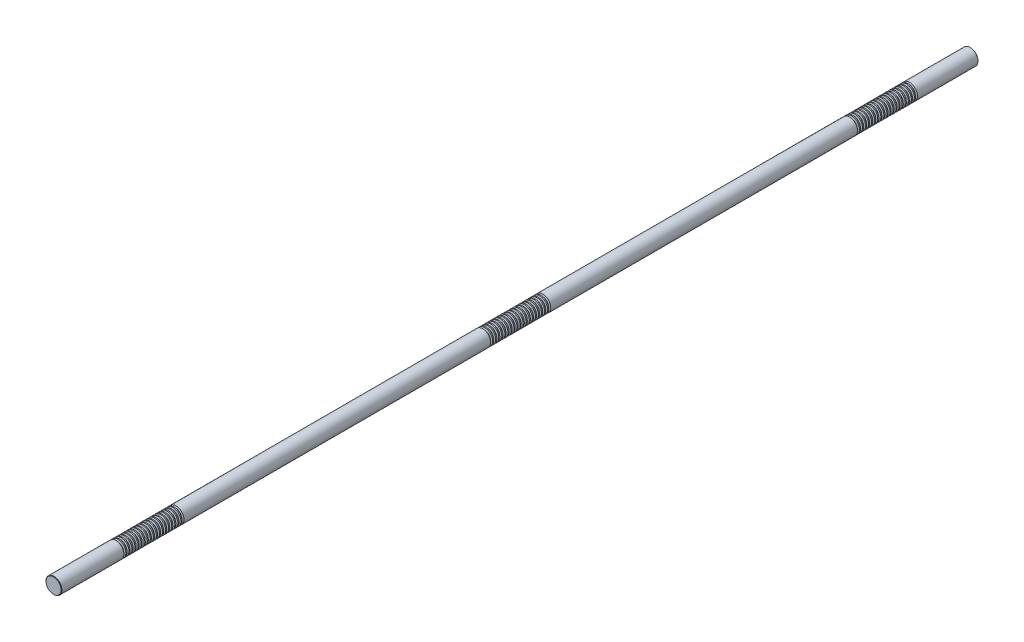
ISO-10303-21;
HEADER;
FILE_DESCRIPTION(('STEP AP214'),'2;1');
FILE_NAME('part.step','',(''),(''),'','','');
FILE_SCHEMA(('AUTOMOTIVE_DESIGN { 1 0 10303 214 1 1 1 1 }'));
ENDSEC;
DATA;
#1=APPLICATION_CONTEXT('core data for automotive mechanical design processes');
#2=APPLICATION_PROTOCOL_DEFINITION('international standard','automotive_design',2000,#1);
#3=PRODUCT_CONTEXT('',#1,'mechanical');
#4=PRODUCT('Part','Part','',(#3));
#5=PRODUCT_RELATED_PRODUCT_CATEGORY('part','',(#4));
#6=PRODUCT_DEFINITION_FORMATION('','',#4);
#7=PRODUCT_DEFINITION_CONTEXT('part definition',#1,'design');
#8=PRODUCT_DEFINITION('design','',#6,#7);
#9=PRODUCT_DEFINITION_SHAPE('','',#8);
#10=(LENGTH_UNIT() NAMED_UNIT(*) SI_UNIT(.MILLI.,.METRE.));
#11=(NAMED_UNIT(*) PLANE_ANGLE_UNIT() SI_UNIT($,.RADIAN.));
#12=(NAMED_UNIT(*) SI_UNIT($,.STERADIAN.) SOLID_ANGLE_UNIT());
#13=UNCERTAINTY_MEASURE_WITH_UNIT(LENGTH_MEASURE(1.E-05),#10,'distance_accuracy_value','');
#14=(GEOMETRIC_REPRESENTATION_CONTEXT(3) GLOBAL_UNCERTAINTY_ASSIGNED_CONTEXT((#13)) GLOBAL_UNIT_ASSIGNED_CONTEXT((#10,
#11,#12)) REPRESENTATION_CONTEXT('',''));
#15=CARTESIAN_POINT('',(0.,0.,0.));
#16=DIRECTION('',(0.,0.,1.));
#17=DIRECTION('',(1.,0.,0.));
#18=AXIS2_PLACEMENT_3D('',#15,#16,#17);
#19=CARTESIAN_POINT('',(0.,0.,750.));
#20=DIRECTION('',(0.,0.,-1.));
#21=DIRECTION('',(-1.,0.,0.));
#22=AXIS2_PLACEMENT_3D('',#19,#20,#21);
#23=CYLINDRICAL_SURFACE('',#22,13.);
#24=CARTESIAN_POINT('',(0.,0.,642.868430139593));
#25=DIRECTION('',(0.,0.,1.));
#26=DIRECTION('',(1.,0.,0.));
#27=AXIS2_PLACEMENT_3D('',#24,#25,#26);
#28=CIRCLE('',#27,13.);
#29=CARTESIAN_POINT('',(13.,0.,642.868430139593));
#30=VERTEX_POINT('',#29);
#31=EDGE_CURVE('E993',#30,#30,#28,.T.);
#32=ORIENTED_EDGE('',*,*,#31,.T.);
#33=EDGE_LOOP('',(#32));
#34=FACE_BOUND('',#33,.T.);
#35=CARTESIAN_POINT('',(0.,0.,644.631569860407));
#36=DIRECTION('',(0.,0.,1.));
#37=DIRECTION('',(1.,0.,0.));
#38=AXIS2_PLACEMENT_3D('',#35,#36,#37);
#39=CIRCLE('',#38,13.);
#40=CARTESIAN_POINT('',(13.,0.,644.631569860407));
#41=VERTEX_POINT('',#40);
#42=EDGE_CURVE('E1005',#41,#41,#39,.T.);
#43=ORIENTED_EDGE('',*,*,#42,.F.);
#44=EDGE_LOOP('',(#43));
#45=FACE_BOUND('',#44,.T.);
#46=ADVANCED_FACE('F37',(#34,#45),#23,.T.);
#47=CARTESIAN_POINT('',(0.,0.,637.868430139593));
#48=DIRECTION('',(0.,0.,1.));
#49=DIRECTION('',(1.,0.,0.));
#50=AXIS2_PLACEMENT_3D('',#47,#48,#49);
#51=CIRCLE('',#50,13.);
#52=CARTESIAN_POINT('',(13.,0.,637.868430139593));
#53=VERTEX_POINT('',#52);
#54=EDGE_CURVE('E977',#53,#53,#51,.T.);
#55=ORIENTED_EDGE('',*,*,#54,.T.);
#56=EDGE_LOOP('',(#55));
#57=FACE_BOUND('',#56,.T.);
#58=CARTESIAN_POINT('',(0.,0.,639.631569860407));
#59=DIRECTION('',(0.,0.,1.));
#60=DIRECTION('',(1.,0.,0.));
#61=AXIS2_PLACEMENT_3D('',#58,#59,#60);
#62=CIRCLE('',#61,13.);
#63=CARTESIAN_POINT('',(13.,0.,639.631569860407));
#64=VERTEX_POINT('',#63);
#65=EDGE_CURVE('E989',#64,#64,#62,.T.);
#66=ORIENTED_EDGE('',*,*,#65,.F.);
#67=EDGE_LOOP('',(#66));
#68=FACE_BOUND('',#67,.T.);
#69=ADVANCED_FACE('F1041',(#57,#68),#23,.T.);
#70=CARTESIAN_POINT('',(0.,0.,632.868430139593));
#71=DIRECTION('',(0.,0.,1.));
#72=DIRECTION('',(1.,0.,0.));
#73=AXIS2_PLACEMENT_3D('',#70,#71,#72);
#74=CIRCLE('',#73,13.);
#75=CARTESIAN_POINT('',(13.,0.,632.868430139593));
#76=VERTEX_POINT('',#75);
#77=EDGE_CURVE('E962',#76,#76,#74,.T.);
#78=ORIENTED_EDGE('',*,*,#77,.T.);
#79=EDGE_LOOP('',(#78));
#80=FACE_BOUND('',#79,.T.);
#81=CARTESIAN_POINT('',(0.,0.,634.631569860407));
#82=DIRECTION('',(0.,0.,1.));
#83=DIRECTION('',(1.,0.,0.));
#84=AXIS2_PLACEMENT_3D('',#81,#82,#83);
#85=CIRCLE('',#84,13.);
#86=CARTESIAN_POINT('',(13.,0.,634.631569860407));
#87=VERTEX_POINT('',#86);
#88=EDGE_CURVE('E974',#87,#87,#85,.T.);
#89=ORIENTED_EDGE('',*,*,#88,.F.);
#90=EDGE_LOOP('',(#89));
#91=FACE_BOUND('',#90,.T.);
#92=ADVANCED_FACE('F1049',(#80,#91),#23,.T.);
#93=CARTESIAN_POINT('',(0.,0.,627.868430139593));
#94=DIRECTION('',(0.,0.,1.));
#95=DIRECTION('',(1.,0.,0.));
#96=AXIS2_PLACEMENT_3D('',#93,#94,#95);
#97=CIRCLE('',#96,13.);
#98=CARTESIAN_POINT('',(13.,0.,627.868430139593));
#99=VERTEX_POINT('',#98);
#100=EDGE_CURVE('E946',#99,#99,#97,.T.);
#101=ORIENTED_EDGE('',*,*,#100,.T.);
#102=EDGE_LOOP('',(#101));
#103=FACE_BOUND('',#102,.T.);
#104=CARTESIAN_POINT('',(0.,0.,629.631569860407));
#105=DIRECTION('',(0.,0.,1.));
#106=DIRECTION('',(1.,0.,0.));
#107=AXIS2_PLACEMENT_3D('',#104,#105,#106);
#108=CIRCLE('',#107,13.);
#109=CARTESIAN_POINT('',(13.,0.,629.631569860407));
#110=VERTEX_POINT('',#109);
#111=EDGE_CURVE('E958',#110,#110,#108,.T.);
#112=ORIENTED_EDGE('',*,*,#111,.F.);
#113=EDGE_LOOP('',(#112));
#114=FACE_BOUND('',#113,.T.);
#115=ADVANCED_FACE('F2332',(#103,#114),#23,.T.);
#116=CARTESIAN_POINT('',(0.,0.,622.868430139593));
#117=DIRECTION('',(0.,0.,1.));
#118=DIRECTION('',(1.,0.,0.));
#119=AXIS2_PLACEMENT_3D('',#116,#117,#118);
#120=CIRCLE('',#119,13.);
#121=CARTESIAN_POINT('',(13.,0.,622.868430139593));
#122=VERTEX_POINT('',#121);
#123=EDGE_CURVE('E931',#122,#122,#120,.T.);
#124=ORIENTED_EDGE('',*,*,#123,.T.);
#125=EDGE_LOOP('',(#124));
#126=FACE_BOUND('',#125,.T.);
#127=CARTESIAN_POINT('',(0.,0.,624.631569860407));
#128=DIRECTION('',(0.,0.,1.));
#129=DIRECTION('',(1.,0.,0.));
#130=AXIS2_PLACEMENT_3D('',#127,#128,#129);
#131=CIRCLE('',#130,13.);
#132=CARTESIAN_POINT('',(13.,0.,624.631569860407));
#133=VERTEX_POINT('',#132);
#134=EDGE_CURVE('E942',#133,#133,#131,.T.);
#135=ORIENTED_EDGE('',*,*,#134,.F.);
#136=EDGE_LOOP('',(#135));
#137=FACE_BOUND('',#136,.T.);
#138=ADVANCED_FACE('F2309',(#126,#137),#23,.T.);
#139=CARTESIAN_POINT('',(0.,0.,617.868430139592));
#140=DIRECTION('',(0.,0.,1.));
#141=DIRECTION('',(1.,0.,0.));
#142=AXIS2_PLACEMENT_3D('',#139,#140,#141);
#143=CIRCLE('',#142,13.);
#144=CARTESIAN_POINT('',(13.,0.,617.868430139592));
#145=VERTEX_POINT('',#144);
#146=EDGE_CURVE('E915',#145,#145,#143,.T.);
#147=ORIENTED_EDGE('',*,*,#146,.T.);
#148=EDGE_LOOP('',(#147));
#149=FACE_BOUND('',#148,.T.);
#150=CARTESIAN_POINT('',(0.,0.,619.631569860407));
#151=DIRECTION('',(0.,0.,1.));
#152=DIRECTION('',(1.,0.,0.));
#153=AXIS2_PLACEMENT_3D('',#150,#151,#152);
#154=CIRCLE('',#153,13.);
#155=CARTESIAN_POINT('',(13.,0.,619.631569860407));
#156=VERTEX_POINT('',#155);
#157=EDGE_CURVE('E927',#156,#156,#154,.T.);
#158=ORIENTED_EDGE('',*,*,#157,.F.);
#159=EDGE_LOOP('',(#158));
#160=FACE_BOUND('',#159,.T.);
#161=ADVANCED_FACE('F2286',(#149,#160),#23,.T.);
#162=CARTESIAN_POINT('',(0.,0.,612.868430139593));
#163=DIRECTION('',(0.,0.,1.));
#164=DIRECTION('',(1.,0.,0.));
#165=AXIS2_PLACEMENT_3D('',#162,#163,#164);
#166=CIRCLE('',#165,13.);
#167=CARTESIAN_POINT('',(13.,0.,612.868430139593));
#168=VERTEX_POINT('',#167);
#169=EDGE_CURVE('E899',#168,#168,#166,.T.);
#170=ORIENTED_EDGE('',*,*,#169,.T.);
#171=EDGE_LOOP('',(#170));
#172=FACE_BOUND('',#171,.T.);
#173=CARTESIAN_POINT('',(0.,0.,614.631569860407));
#174=DIRECTION('',(0.,0.,1.));
#175=DIRECTION('',(1.,0.,0.));
#176=AXIS2_PLACEMENT_3D('',#173,#174,#175);
#177=CIRCLE('',#176,13.);
#178=CARTESIAN_POINT('',(13.,0.,614.631569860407));
#179=VERTEX_POINT('',#178);
#180=EDGE_CURVE('E911',#179,#179,#177,.T.);
#181=ORIENTED_EDGE('',*,*,#180,.F.);
#182=EDGE_LOOP('',(#181));
#183=FACE_BOUND('',#182,.T.);
#184=ADVANCED_FACE('F2263',(#172,#183),#23,.T.);
#185=CARTESIAN_POINT('',(0.,0.,607.868430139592));
#186=DIRECTION('',(0.,0.,1.));
#187=DIRECTION('',(1.,0.,0.));
#188=AXIS2_PLACEMENT_3D('',#185,#186,#187);
#189=CIRCLE('',#188,13.);
#190=CARTESIAN_POINT('',(13.,0.,607.868430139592));
#191=VERTEX_POINT('',#190);
#192=EDGE_CURVE('E883',#191,#191,#189,.T.);
#193=ORIENTED_EDGE('',*,*,#192,.T.);
#194=EDGE_LOOP('',(#193));
#195=FACE_BOUND('',#194,.T.);
#196=CARTESIAN_POINT('',(0.,0.,609.631569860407));
#197=DIRECTION('',(0.,0.,1.));
#198=DIRECTION('',(1.,0.,0.));
#199=AXIS2_PLACEMENT_3D('',#196,#197,#198);
#200=CIRCLE('',#199,13.);
#201=CARTESIAN_POINT('',(13.,0.,609.631569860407));
#202=VERTEX_POINT('',#201);
#203=EDGE_CURVE('E895',#202,#202,#200,.T.);
#204=ORIENTED_EDGE('',*,*,#203,.F.);
#205=EDGE_LOOP('',(#204));
#206=FACE_BOUND('',#205,.T.);
#207=ADVANCED_FACE('F2240',(#195,#206),#23,.T.);
#208=CARTESIAN_POINT('',(0.,0.,602.868430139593));
#209=DIRECTION('',(0.,0.,1.));
#210=DIRECTION('',(1.,0.,0.));
#211=AXIS2_PLACEMENT_3D('',#208,#209,#210);
#212=CIRCLE('',#211,13.);
#213=CARTESIAN_POINT('',(13.,0.,602.868430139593));
#214=VERTEX_POINT('',#213);
#215=EDGE_CURVE('E867',#214,#214,#212,.T.);
#216=ORIENTED_EDGE('',*,*,#215,.T.);
#217=EDGE_LOOP('',(#216));
#218=FACE_BOUND('',#217,.T.);
#219=CARTESIAN_POINT('',(0.,0.,604.631569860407));
#220=DIRECTION('',(0.,0.,1.));
#221=DIRECTION('',(1.,0.,0.));
#222=AXIS2_PLACEMENT_3D('',#219,#220,#221);
#223=CIRCLE('',#222,13.);
#224=CARTESIAN_POINT('',(13.,0.,604.631569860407));
#225=VERTEX_POINT('',#224);
#226=EDGE_CURVE('E879',#225,#225,#223,.T.);
#227=ORIENTED_EDGE('',*,*,#226,.F.);
#228=EDGE_LOOP('',(#227));
#229=FACE_BOUND('',#228,.T.);
#230=ADVANCED_FACE('F2217',(#218,#229),#23,.T.);
#231=CARTESIAN_POINT('',(0.,0.,597.868430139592));
#232=DIRECTION('',(0.,0.,1.));
#233=DIRECTION('',(1.,0.,0.));
#234=AXIS2_PLACEMENT_3D('',#231,#232,#233);
#235=CIRCLE('',#234,13.);
#236=CARTESIAN_POINT('',(13.,0.,597.868430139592));
#237=VERTEX_POINT('',#236);
#238=EDGE_CURVE('E851',#237,#237,#235,.T.);
#239=ORIENTED_EDGE('',*,*,#238,.T.);
#240=EDGE_LOOP('',(#239));
#241=FACE_BOUND('',#240,.T.);
#242=CARTESIAN_POINT('',(0.,0.,599.631569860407));
#243=DIRECTION('',(0.,0.,1.));
#244=DIRECTION('',(1.,0.,0.));
#245=AXIS2_PLACEMENT_3D('',#242,#243,#244);
#246=CIRCLE('',#245,13.);
#247=CARTESIAN_POINT('',(13.,0.,599.631569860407));
#248=VERTEX_POINT('',#247);
#249=EDGE_CURVE('E863',#248,#248,#246,.T.);
#250=ORIENTED_EDGE('',*,*,#249,.F.);
#251=EDGE_LOOP('',(#250));
#252=FACE_BOUND('',#251,.T.);
#253=ADVANCED_FACE('F2194',(#241,#252),#23,.T.);
#254=CARTESIAN_POINT('',(0.,0.,592.868430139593));
#255=DIRECTION('',(0.,0.,1.));
#256=DIRECTION('',(1.,0.,0.));
#257=AXIS2_PLACEMENT_3D('',#254,#255,#256);
#258=CIRCLE('',#257,13.);
#259=CARTESIAN_POINT('',(13.,0.,592.868430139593));
#260=VERTEX_POINT('',#259);
#261=EDGE_CURVE('E835',#260,#260,#258,.T.);
#262=ORIENTED_EDGE('',*,*,#261,.T.);
#263=EDGE_LOOP('',(#262));
#264=FACE_BOUND('',#263,.T.);
#265=CARTESIAN_POINT('',(0.,0.,594.631569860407));
#266=DIRECTION('',(0.,0.,1.));
#267=DIRECTION('',(1.,0.,0.));
#268=AXIS2_PLACEMENT_3D('',#265,#266,#267);
#269=CIRCLE('',#268,13.);
#270=CARTESIAN_POINT('',(13.,0.,594.631569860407));
#271=VERTEX_POINT('',#270);
#272=EDGE_CURVE('E847',#271,#271,#269,.T.);
#273=ORIENTED_EDGE('',*,*,#272,.F.);
#274=EDGE_LOOP('',(#273));
#275=FACE_BOUND('',#274,.T.);
#276=ADVANCED_FACE('F2171',(#264,#275),#23,.T.);
#277=CARTESIAN_POINT('',(0.,0.,587.868430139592));
#278=DIRECTION('',(0.,0.,1.));
#279=DIRECTION('',(1.,0.,0.));
#280=AXIS2_PLACEMENT_3D('',#277,#278,#279);
#281=CIRCLE('',#280,13.);
#282=CARTESIAN_POINT('',(13.,0.,587.868430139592));
#283=VERTEX_POINT('',#282);
#284=EDGE_CURVE('E819',#283,#283,#281,.T.);
#285=ORIENTED_EDGE('',*,*,#284,.T.);
#286=EDGE_LOOP('',(#285));
#287=FACE_BOUND('',#286,.T.);
#288=CARTESIAN_POINT('',(0.,0.,589.631569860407));
#289=DIRECTION('',(0.,0.,1.));
#290=DIRECTION('',(1.,0.,0.));
#291=AXIS2_PLACEMENT_3D('',#288,#289,#290);
#292=CIRCLE('',#291,13.);
#293=CARTESIAN_POINT('',(13.,0.,589.631569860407));
#294=VERTEX_POINT('',#293);
#295=EDGE_CURVE('E831',#294,#294,#292,.T.);
#296=ORIENTED_EDGE('',*,*,#295,.F.);
#297=EDGE_LOOP('',(#296));
#298=FACE_BOUND('',#297,.T.);
#299=ADVANCED_FACE('F2148',(#287,#298),#23,.T.);
#300=CARTESIAN_POINT('',(0.,0.,582.868430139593));
#301=DIRECTION('',(0.,0.,1.));
#302=DIRECTION('',(1.,0.,0.));
#303=AXIS2_PLACEMENT_3D('',#300,#301,#302);
#304=CIRCLE('',#303,13.);
#305=CARTESIAN_POINT('',(13.,0.,582.868430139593));
#306=VERTEX_POINT('',#305);
#307=EDGE_CURVE('E803',#306,#306,#304,.T.);
#308=ORIENTED_EDGE('',*,*,#307,.T.);
#309=EDGE_LOOP('',(#308));
#310=FACE_BOUND('',#309,.T.);
#311=CARTESIAN_POINT('',(0.,0.,584.631569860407));
#312=DIRECTION('',(0.,0.,1.));
#313=DIRECTION('',(1.,0.,0.));
#314=AXIS2_PLACEMENT_3D('',#311,#312,#313);
#315=CIRCLE('',#314,13.);
#316=CARTESIAN_POINT('',(13.,0.,584.631569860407));
#317=VERTEX_POINT('',#316);
#318=EDGE_CURVE('E815',#317,#317,#315,.T.);
#319=ORIENTED_EDGE('',*,*,#318,.F.);
#320=EDGE_LOOP('',(#319));
#321=FACE_BOUND('',#320,.T.);
#322=ADVANCED_FACE('F2125',(#310,#321),#23,.T.);
#323=CARTESIAN_POINT('',(0.,0.,577.868430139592));
#324=DIRECTION('',(0.,0.,1.));
#325=DIRECTION('',(1.,0.,0.));
#326=AXIS2_PLACEMENT_3D('',#323,#324,#325);
#327=CIRCLE('',#326,13.);
#328=CARTESIAN_POINT('',(13.,0.,577.868430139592));
#329=VERTEX_POINT('',#328);
#330=EDGE_CURVE('E787',#329,#329,#327,.T.);
#331=ORIENTED_EDGE('',*,*,#330,.T.);
#332=EDGE_LOOP('',(#331));
#333=FACE_BOUND('',#332,.T.);
#334=CARTESIAN_POINT('',(0.,0.,579.631569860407));
#335=DIRECTION('',(0.,0.,1.));
#336=DIRECTION('',(1.,0.,0.));
#337=AXIS2_PLACEMENT_3D('',#334,#335,#336);
#338=CIRCLE('',#337,13.);
#339=CARTESIAN_POINT('',(13.,0.,579.631569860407));
#340=VERTEX_POINT('',#339);
#341=EDGE_CURVE('E799',#340,#340,#338,.T.);
#342=ORIENTED_EDGE('',*,*,#341,.F.);
#343=EDGE_LOOP('',(#342));
#344=FACE_BOUND('',#343,.T.);
#345=ADVANCED_FACE('F2102',(#333,#344),#23,.T.);
#346=CARTESIAN_POINT('',(0.,0.,572.868430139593));
#347=DIRECTION('',(0.,0.,1.));
#348=DIRECTION('',(1.,0.,0.));
#349=AXIS2_PLACEMENT_3D('',#346,#347,#348);
#350=CIRCLE('',#349,13.);
#351=CARTESIAN_POINT('',(13.,0.,572.868430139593));
#352=VERTEX_POINT('',#351);
#353=EDGE_CURVE('E771',#352,#352,#350,.T.);
#354=ORIENTED_EDGE('',*,*,#353,.T.);
#355=EDGE_LOOP('',(#354));
#356=FACE_BOUND('',#355,.T.);
#357=CARTESIAN_POINT('',(0.,0.,574.631569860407));
#358=DIRECTION('',(0.,0.,1.));
#359=DIRECTION('',(1.,0.,0.));
#360=AXIS2_PLACEMENT_3D('',#357,#358,#359);
#361=CIRCLE('',#360,13.);
#362=CARTESIAN_POINT('',(13.,0.,574.631569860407));
#363=VERTEX_POINT('',#362);
#364=EDGE_CURVE('E783',#363,#363,#361,.T.);
#365=ORIENTED_EDGE('',*,*,#364,.F.);
#366=EDGE_LOOP('',(#365));
#367=FACE_BOUND('',#366,.T.);
#368=ADVANCED_FACE('F2079',(#356,#367),#23,.T.);
#369=CARTESIAN_POINT('',(0.,0.,567.868430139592));
#370=DIRECTION('',(0.,0.,1.));
#371=DIRECTION('',(1.,0.,0.));
#372=AXIS2_PLACEMENT_3D('',#369,#370,#371);
#373=CIRCLE('',#372,13.);
#374=CARTESIAN_POINT('',(13.,0.,567.868430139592));
#375=VERTEX_POINT('',#374);
#376=EDGE_CURVE('E755',#375,#375,#373,.T.);
#377=ORIENTED_EDGE('',*,*,#376,.T.);
#378=EDGE_LOOP('',(#377));
#379=FACE_BOUND('',#378,.T.);
#380=CARTESIAN_POINT('',(0.,0.,569.631569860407));
#381=DIRECTION('',(0.,0.,1.));
#382=DIRECTION('',(1.,0.,0.));
#383=AXIS2_PLACEMENT_3D('',#380,#381,#382);
#384=CIRCLE('',#383,13.);
#385=CARTESIAN_POINT('',(13.,0.,569.631569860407));
#386=VERTEX_POINT('',#385);
#387=EDGE_CURVE('E767',#386,#386,#384,.T.);
#388=ORIENTED_EDGE('',*,*,#387,.F.);
#389=EDGE_LOOP('',(#388));
#390=FACE_BOUND('',#389,.T.);
#391=ADVANCED_FACE('F2056',(#379,#390),#23,.T.);
#392=CARTESIAN_POINT('',(0.,0.,562.868430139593));
#393=DIRECTION('',(0.,0.,1.));
#394=DIRECTION('',(1.,0.,0.));
#395=AXIS2_PLACEMENT_3D('',#392,#393,#394);
#396=CIRCLE('',#395,13.);
#397=CARTESIAN_POINT('',(13.,0.,562.868430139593));
#398=VERTEX_POINT('',#397);
#399=EDGE_CURVE('E739',#398,#398,#396,.T.);
#400=ORIENTED_EDGE('',*,*,#399,.T.);
#401=EDGE_LOOP('',(#400));
#402=FACE_BOUND('',#401,.T.);
#403=CARTESIAN_POINT('',(0.,0.,564.631569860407));
#404=DIRECTION('',(0.,0.,1.));
#405=DIRECTION('',(1.,0.,0.));
#406=AXIS2_PLACEMENT_3D('',#403,#404,#405);
#407=CIRCLE('',#406,13.);
#408=CARTESIAN_POINT('',(13.,0.,564.631569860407));
#409=VERTEX_POINT('',#408);
#410=EDGE_CURVE('E751',#409,#409,#407,.T.);
#411=ORIENTED_EDGE('',*,*,#410,.F.);
#412=EDGE_LOOP('',(#411));
#413=FACE_BOUND('',#412,.T.);
#414=ADVANCED_FACE('F2033',(#402,#413),#23,.T.);
#415=CARTESIAN_POINT('',(0.,0.,557.868430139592));
#416=DIRECTION('',(0.,0.,1.));
#417=DIRECTION('',(1.,0.,0.));
#418=AXIS2_PLACEMENT_3D('',#415,#416,#417);
#419=CIRCLE('',#418,13.);
#420=CARTESIAN_POINT('',(13.,0.,557.868430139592));
#421=VERTEX_POINT('',#420);
#422=EDGE_CURVE('E723',#421,#421,#419,.T.);
#423=ORIENTED_EDGE('',*,*,#422,.T.);
#424=EDGE_LOOP('',(#423));
#425=FACE_BOUND('',#424,.T.);
#426=CARTESIAN_POINT('',(0.,0.,559.631569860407));
#427=DIRECTION('',(0.,0.,1.));
#428=DIRECTION('',(1.,0.,0.));
#429=AXIS2_PLACEMENT_3D('',#426,#427,#428);
#430=CIRCLE('',#429,13.);
#431=CARTESIAN_POINT('',(13.,0.,559.631569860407));
#432=VERTEX_POINT('',#431);
#433=EDGE_CURVE('E735',#432,#432,#430,.T.);
#434=ORIENTED_EDGE('',*,*,#433,.F.);
#435=EDGE_LOOP('',(#434));
#436=FACE_BOUND('',#435,.T.);
#437=ADVANCED_FACE('F2014',(#425,#436),#23,.T.);
#438=CARTESIAN_POINT('',(0.,0.,552.868430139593));
#439=DIRECTION('',(0.,0.,1.));
#440=DIRECTION('',(1.,0.,0.));
#441=AXIS2_PLACEMENT_3D('',#438,#439,#440);
#442=CIRCLE('',#441,13.);
#443=CARTESIAN_POINT('',(13.,0.,552.868430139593));
#444=VERTEX_POINT('',#443);
#445=EDGE_CURVE('E403',#444,#444,#442,.T.);
#446=ORIENTED_EDGE('',*,*,#445,.T.);
#447=EDGE_LOOP('',(#446));
#448=FACE_BOUND('',#447,.T.);
#449=CARTESIAN_POINT('',(0.,0.,554.631569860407));
#450=DIRECTION('',(0.,0.,1.));
#451=DIRECTION('',(1.,0.,0.));
#452=AXIS2_PLACEMENT_3D('',#449,#450,#451);
#453=CIRCLE('',#452,13.);
#454=CARTESIAN_POINT('',(13.,0.,554.631569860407));
#455=VERTEX_POINT('',#454);
#456=EDGE_CURVE('E719',#455,#455,#453,.T.);
#457=ORIENTED_EDGE('',*,*,#456,.F.);
#458=EDGE_LOOP('',(#457));
#459=FACE_BOUND('',#458,.T.);
#460=ADVANCED_FACE('F1963',(#448,#459),#23,.T.);
#461=CARTESIAN_POINT('',(0.,0.,42.8684301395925));
#462=DIRECTION('',(0.,0.,1.));
#463=DIRECTION('',(1.,0.,0.));
#464=AXIS2_PLACEMENT_3D('',#461,#462,#463);
#465=CIRCLE('',#464,13.);
#466=CARTESIAN_POINT('',(13.,0.,42.8684301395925));
#467=VERTEX_POINT('',#466);
#468=EDGE_CURVE('E691',#467,#467,#465,.T.);
#469=ORIENTED_EDGE('',*,*,#468,.T.);
#470=EDGE_LOOP('',(#469));
#471=FACE_BOUND('',#470,.T.);
#472=CARTESIAN_POINT('',(0.,0.,44.6315698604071));
#473=DIRECTION('',(0.,0.,1.));
#474=DIRECTION('',(1.,0.,0.));
#475=AXIS2_PLACEMENT_3D('',#472,#473,#474);
#476=CIRCLE('',#475,13.);
#477=CARTESIAN_POINT('',(13.,0.,44.6315698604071));
#478=VERTEX_POINT('',#477);
#479=EDGE_CURVE('E703',#478,#478,#476,.T.);
#480=ORIENTED_EDGE('',*,*,#479,.F.);
#481=EDGE_LOOP('',(#480));
#482=FACE_BOUND('',#481,.T.);
#483=ADVANCED_FACE('F1939',(#471,#482),#23,.T.);
#484=CARTESIAN_POINT('',(0.,0.,37.8684301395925));
#485=DIRECTION('',(0.,0.,1.));
#486=DIRECTION('',(1.,0.,0.));
#487=AXIS2_PLACEMENT_3D('',#484,#485,#486);
#488=CIRCLE('',#487,13.);
#489=CARTESIAN_POINT('',(13.,0.,37.8684301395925));
#490=VERTEX_POINT('',#489);
#491=EDGE_CURVE('E675',#490,#490,#488,.T.);
#492=ORIENTED_EDGE('',*,*,#491,.T.);
#493=EDGE_LOOP('',(#492));
#494=FACE_BOUND('',#493,.T.);
#495=CARTESIAN_POINT('',(0.,0.,39.6315698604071));
#496=DIRECTION('',(0.,0.,1.));
#497=DIRECTION('',(1.,0.,0.));
#498=AXIS2_PLACEMENT_3D('',#495,#496,#497);
#499=CIRCLE('',#498,13.);
#500=CARTESIAN_POINT('',(13.,0.,39.6315698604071));
#501=VERTEX_POINT('',#500);
#502=EDGE_CURVE('E687',#501,#501,#499,.T.);
#503=ORIENTED_EDGE('',*,*,#502,.F.);
#504=EDGE_LOOP('',(#503));
#505=FACE_BOUND('',#504,.T.);
#506=ADVANCED_FACE('F1916',(#494,#505),#23,.T.);
#507=CARTESIAN_POINT('',(0.,0.,32.8684301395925));
#508=DIRECTION('',(0.,0.,1.));
#509=DIRECTION('',(1.,0.,0.));
#510=AXIS2_PLACEMENT_3D('',#507,#508,#509);
#511=CIRCLE('',#510,13.);
#512=CARTESIAN_POINT('',(13.,0.,32.8684301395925));
#513=VERTEX_POINT('',#512);
#514=EDGE_CURVE('E659',#513,#513,#511,.T.);
#515=ORIENTED_EDGE('',*,*,#514,.T.);
#516=EDGE_LOOP('',(#515));
#517=FACE_BOUND('',#516,.T.);
#518=CARTESIAN_POINT('',(0.,0.,34.6315698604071));
#519=DIRECTION('',(0.,0.,1.));
#520=DIRECTION('',(1.,0.,0.));
#521=AXIS2_PLACEMENT_3D('',#518,#519,#520);
#522=CIRCLE('',#521,13.);
#523=CARTESIAN_POINT('',(13.,0.,34.6315698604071));
#524=VERTEX_POINT('',#523);
#525=EDGE_CURVE('E671',#524,#524,#522,.T.);
#526=ORIENTED_EDGE('',*,*,#525,.F.);
#527=EDGE_LOOP('',(#526));
#528=FACE_BOUND('',#527,.T.);
#529=ADVANCED_FACE('F1893',(#517,#528),#23,.T.);
#530=CARTESIAN_POINT('',(0.,0.,27.8684301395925));
#531=DIRECTION('',(0.,0.,1.));
#532=DIRECTION('',(1.,0.,0.));
#533=AXIS2_PLACEMENT_3D('',#530,#531,#532);
#534=CIRCLE('',#533,13.);
#535=CARTESIAN_POINT('',(13.,0.,27.8684301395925));
#536=VERTEX_POINT('',#535);
#537=EDGE_CURVE('E643',#536,#536,#534,.T.);
#538=ORIENTED_EDGE('',*,*,#537,.T.);
#539=EDGE_LOOP('',(#538));
#540=FACE_BOUND('',#539,.T.);
#541=CARTESIAN_POINT('',(0.,0.,29.631569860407));
#542=DIRECTION('',(0.,0.,1.));
#543=DIRECTION('',(1.,0.,0.));
#544=AXIS2_PLACEMENT_3D('',#541,#542,#543);
#545=CIRCLE('',#544,13.);
#546=CARTESIAN_POINT('',(13.,0.,29.631569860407));
#547=VERTEX_POINT('',#546);
#548=EDGE_CURVE('E655',#547,#547,#545,.T.);
#549=ORIENTED_EDGE('',*,*,#548,.F.);
#550=EDGE_LOOP('',(#549));
#551=FACE_BOUND('',#550,.T.);
#552=ADVANCED_FACE('F1870',(#540,#551),#23,.T.);
#553=CARTESIAN_POINT('',(0.,0.,22.8684301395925));
#554=DIRECTION('',(0.,0.,1.));
#555=DIRECTION('',(1.,0.,0.));
#556=AXIS2_PLACEMENT_3D('',#553,#554,#555);
#557=CIRCLE('',#556,13.);
#558=CARTESIAN_POINT('',(13.,0.,22.8684301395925));
#559=VERTEX_POINT('',#558);
#560=EDGE_CURVE('E627',#559,#559,#557,.T.);
#561=ORIENTED_EDGE('',*,*,#560,.T.);
#562=EDGE_LOOP('',(#561));
#563=FACE_BOUND('',#562,.T.);
#564=CARTESIAN_POINT('',(0.,0.,24.631569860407));
#565=DIRECTION('',(0.,0.,1.));
#566=DIRECTION('',(1.,0.,0.));
#567=AXIS2_PLACEMENT_3D('',#564,#565,#566);
#568=CIRCLE('',#567,13.);
#569=CARTESIAN_POINT('',(13.,0.,24.631569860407));
#570=VERTEX_POINT('',#569);
#571=EDGE_CURVE('E639',#570,#570,#568,.T.);
#572=ORIENTED_EDGE('',*,*,#571,.F.);
#573=EDGE_LOOP('',(#572));
#574=FACE_BOUND('',#573,.T.);
#575=ADVANCED_FACE('F1847',(#563,#574),#23,.T.);
#576=CARTESIAN_POINT('',(0.,0.,17.8684301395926));
#577=DIRECTION('',(0.,0.,1.));
#578=DIRECTION('',(1.,0.,0.));
#579=AXIS2_PLACEMENT_3D('',#576,#577,#578);
#580=CIRCLE('',#579,13.);
#581=CARTESIAN_POINT('',(13.,0.,17.8684301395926));
#582=VERTEX_POINT('',#581);
#583=EDGE_CURVE('E611',#582,#582,#580,.T.);
#584=ORIENTED_EDGE('',*,*,#583,.T.);
#585=EDGE_LOOP('',(#584));
#586=FACE_BOUND('',#585,.T.);
#587=CARTESIAN_POINT('',(0.,0.,19.631569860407));
#588=DIRECTION('',(0.,0.,1.));
#589=DIRECTION('',(1.,0.,0.));
#590=AXIS2_PLACEMENT_3D('',#587,#588,#589);
#591=CIRCLE('',#590,13.);
#592=CARTESIAN_POINT('',(13.,0.,19.631569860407));
#593=VERTEX_POINT('',#592);
#594=EDGE_CURVE('E623',#593,#593,#591,.T.);
#595=ORIENTED_EDGE('',*,*,#594,.F.);
#596=EDGE_LOOP('',(#595));
#597=FACE_BOUND('',#596,.T.);
#598=ADVANCED_FACE('F1824',(#586,#597),#23,.T.);
#599=CARTESIAN_POINT('',(0.,0.,12.8684301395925));
#600=DIRECTION('',(0.,0.,1.));
#601=DIRECTION('',(1.,0.,0.));
#602=AXIS2_PLACEMENT_3D('',#599,#600,#601);
#603=CIRCLE('',#602,13.);
#604=CARTESIAN_POINT('',(13.,0.,12.8684301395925));
#605=VERTEX_POINT('',#604);
#606=EDGE_CURVE('E595',#605,#605,#603,.T.);
#607=ORIENTED_EDGE('',*,*,#606,.T.);
#608=EDGE_LOOP('',(#607));
#609=FACE_BOUND('',#608,.T.);
#610=CARTESIAN_POINT('',(0.,0.,14.6315698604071));
#611=DIRECTION('',(0.,0.,1.));
#612=DIRECTION('',(1.,0.,0.));
#613=AXIS2_PLACEMENT_3D('',#610,#611,#612);
#614=CIRCLE('',#613,13.);
#615=CARTESIAN_POINT('',(13.,0.,14.6315698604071));
#616=VERTEX_POINT('',#615);
#617=EDGE_CURVE('E607',#616,#616,#614,.T.);
#618=ORIENTED_EDGE('',*,*,#617,.F.);
#619=EDGE_LOOP('',(#618));
#620=FACE_BOUND('',#619,.T.);
#621=ADVANCED_FACE('F1801',(#609,#620),#23,.T.);
#622=CARTESIAN_POINT('',(0.,0.,7.8684301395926));
#623=DIRECTION('',(0.,0.,1.));
#624=DIRECTION('',(1.,0.,0.));
#625=AXIS2_PLACEMENT_3D('',#622,#623,#624);
#626=CIRCLE('',#625,13.);
#627=CARTESIAN_POINT('',(13.,0.,7.8684301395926));
#628=VERTEX_POINT('',#627);
#629=EDGE_CURVE('E579',#628,#628,#626,.T.);
#630=ORIENTED_EDGE('',*,*,#629,.T.);
#631=EDGE_LOOP('',(#630));
#632=FACE_BOUND('',#631,.T.);
#633=CARTESIAN_POINT('',(0.,0.,9.63156986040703));
#634=DIRECTION('',(0.,0.,1.));
#635=DIRECTION('',(1.,0.,0.));
#636=AXIS2_PLACEMENT_3D('',#633,#634,#635);
#637=CIRCLE('',#636,13.);
#638=CARTESIAN_POINT('',(13.,0.,9.63156986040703));
#639=VERTEX_POINT('',#638);
#640=EDGE_CURVE('E591',#639,#639,#637,.T.);
#641=ORIENTED_EDGE('',*,*,#640,.F.);
#642=EDGE_LOOP('',(#641));
#643=FACE_BOUND('',#642,.T.);
#644=ADVANCED_FACE('F1778',(#632,#643),#23,.T.);
#645=CARTESIAN_POINT('',(0.,0.,2.86843013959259));
#646=DIRECTION('',(0.,0.,1.));
#647=DIRECTION('',(1.,0.,0.));
#648=AXIS2_PLACEMENT_3D('',#645,#646,#647);
#649=CIRCLE('',#648,13.);
#650=CARTESIAN_POINT('',(13.,0.,2.86843013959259));
#651=VERTEX_POINT('',#650);
#652=EDGE_CURVE('E563',#651,#651,#649,.T.);
#653=ORIENTED_EDGE('',*,*,#652,.T.);
#654=EDGE_LOOP('',(#653));
#655=FACE_BOUND('',#654,.T.);
#656=CARTESIAN_POINT('',(0.,0.,4.63156986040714));
#657=DIRECTION('',(0.,0.,1.));
#658=DIRECTION('',(1.,0.,0.));
#659=AXIS2_PLACEMENT_3D('',#656,#657,#658);
#660=CIRCLE('',#659,13.);
#661=CARTESIAN_POINT('',(13.,0.,4.63156986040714));
#662=VERTEX_POINT('',#661);
#663=EDGE_CURVE('E575',#662,#662,#660,.T.);
#664=ORIENTED_EDGE('',*,*,#663,.F.);
#665=EDGE_LOOP('',(#664));
#666=FACE_BOUND('',#665,.T.);
#667=ADVANCED_FACE('F1755',(#655,#666),#23,.T.);
#668=CARTESIAN_POINT('',(0.,0.,-2.13156986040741));
#669=DIRECTION('',(0.,0.,1.));
#670=DIRECTION('',(1.,0.,0.));
#671=AXIS2_PLACEMENT_3D('',#668,#669,#670);
#672=CIRCLE('',#671,13.);
#673=CARTESIAN_POINT('',(13.,0.,-2.13156986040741));
#674=VERTEX_POINT('',#673);
#675=EDGE_CURVE('E547',#674,#674,#672,.T.);
#676=ORIENTED_EDGE('',*,*,#675,.T.);
#677=EDGE_LOOP('',(#676));
#678=FACE_BOUND('',#677,.T.);
#679=CARTESIAN_POINT('',(0.,0.,-0.368430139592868));
#680=DIRECTION('',(0.,0.,1.));
#681=DIRECTION('',(1.,0.,0.));
#682=AXIS2_PLACEMENT_3D('',#679,#680,#681);
#683=CIRCLE('',#682,13.);
#684=CARTESIAN_POINT('',(13.,0.,-0.368430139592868));
#685=VERTEX_POINT('',#684);
#686=EDGE_CURVE('E559',#685,#685,#683,.T.);
#687=ORIENTED_EDGE('',*,*,#686,.F.);
#688=EDGE_LOOP('',(#687));
#689=FACE_BOUND('',#688,.T.);
#690=ADVANCED_FACE('F1732',(#678,#689),#23,.T.);
#691=CARTESIAN_POINT('',(0.,0.,-7.13156986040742));
#692=DIRECTION('',(0.,0.,1.));
#693=DIRECTION('',(1.,0.,0.));
#694=AXIS2_PLACEMENT_3D('',#691,#692,#693);
#695=CIRCLE('',#694,13.);
#696=CARTESIAN_POINT('',(13.,0.,-7.13156986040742));
#697=VERTEX_POINT('',#696);
#698=EDGE_CURVE('E531',#697,#697,#695,.T.);
#699=ORIENTED_EDGE('',*,*,#698,.T.);
#700=EDGE_LOOP('',(#699));
#701=FACE_BOUND('',#700,.T.);
#702=CARTESIAN_POINT('',(0.,0.,-5.36843013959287));
#703=DIRECTION('',(0.,0.,1.));
#704=DIRECTION('',(1.,0.,0.));
#705=AXIS2_PLACEMENT_3D('',#702,#703,#704);
#706=CIRCLE('',#705,13.);
#707=CARTESIAN_POINT('',(13.,0.,-5.36843013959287));
#708=VERTEX_POINT('',#707);
#709=EDGE_CURVE('E543',#708,#708,#706,.T.);
#710=ORIENTED_EDGE('',*,*,#709,.F.);
#711=EDGE_LOOP('',(#710));
#712=FACE_BOUND('',#711,.T.);
#713=ADVANCED_FACE('F1709',(#701,#712),#23,.T.);
#714=CARTESIAN_POINT('',(0.,0.,-12.1315698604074));
#715=DIRECTION('',(0.,0.,1.));
#716=DIRECTION('',(1.,0.,0.));
#717=AXIS2_PLACEMENT_3D('',#714,#715,#716);
#718=CIRCLE('',#717,13.);
#719=CARTESIAN_POINT('',(13.,0.,-12.1315698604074));
#720=VERTEX_POINT('',#719);
#721=EDGE_CURVE('E515',#720,#720,#718,.T.);
#722=ORIENTED_EDGE('',*,*,#721,.T.);
#723=EDGE_LOOP('',(#722));
#724=FACE_BOUND('',#723,.T.);
#725=CARTESIAN_POINT('',(0.,0.,-10.3684301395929));
#726=DIRECTION('',(0.,0.,1.));
#727=DIRECTION('',(1.,0.,0.));
#728=AXIS2_PLACEMENT_3D('',#725,#726,#727);
#729=CIRCLE('',#728,13.);
#730=CARTESIAN_POINT('',(13.,0.,-10.3684301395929));
#731=VERTEX_POINT('',#730);
#732=EDGE_CURVE('E527',#731,#731,#729,.T.);
#733=ORIENTED_EDGE('',*,*,#732,.F.);
#734=EDGE_LOOP('',(#733));
#735=FACE_BOUND('',#734,.T.);
#736=ADVANCED_FACE('F1686',(#724,#735),#23,.T.);
#737=CARTESIAN_POINT('',(0.,0.,-17.1315698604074));
#738=DIRECTION('',(0.,0.,1.));
#739=DIRECTION('',(1.,0.,0.));
#740=AXIS2_PLACEMENT_3D('',#737,#738,#739);
#741=CIRCLE('',#740,13.);
#742=CARTESIAN_POINT('',(13.,0.,-17.1315698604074));
#743=VERTEX_POINT('',#742);
#744=EDGE_CURVE('E499',#743,#743,#741,.T.);
#745=ORIENTED_EDGE('',*,*,#744,.T.);
#746=EDGE_LOOP('',(#745));
#747=FACE_BOUND('',#746,.T.);
#748=CARTESIAN_POINT('',(0.,0.,-15.3684301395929));
#749=DIRECTION('',(0.,0.,1.));
#750=DIRECTION('',(1.,0.,0.));
#751=AXIS2_PLACEMENT_3D('',#748,#749,#750);
#752=CIRCLE('',#751,13.);
#753=CARTESIAN_POINT('',(13.,0.,-15.3684301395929));
#754=VERTEX_POINT('',#753);
#755=EDGE_CURVE('E511',#754,#754,#752,.T.);
#756=ORIENTED_EDGE('',*,*,#755,.F.);
#757=EDGE_LOOP('',(#756));
#758=FACE_BOUND('',#757,.T.);
#759=ADVANCED_FACE('F1663',(#747,#758),#23,.T.);
#760=CARTESIAN_POINT('',(0.,0.,-22.1315698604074));
#761=DIRECTION('',(0.,0.,1.));
#762=DIRECTION('',(1.,0.,0.));
#763=AXIS2_PLACEMENT_3D('',#760,#761,#762);
#764=CIRCLE('',#763,13.);
#765=CARTESIAN_POINT('',(13.,0.,-22.1315698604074));
#766=VERTEX_POINT('',#765);
#767=EDGE_CURVE('E483',#766,#766,#764,.T.);
#768=ORIENTED_EDGE('',*,*,#767,.T.);
#769=EDGE_LOOP('',(#768));
#770=FACE_BOUND('',#769,.T.);
#771=CARTESIAN_POINT('',(0.,0.,-20.3684301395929));
#772=DIRECTION('',(0.,0.,1.));
#773=DIRECTION('',(1.,0.,0.));
#774=AXIS2_PLACEMENT_3D('',#771,#772,#773);
#775=CIRCLE('',#774,13.);
#776=CARTESIAN_POINT('',(13.,0.,-20.3684301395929));
#777=VERTEX_POINT('',#776);
#778=EDGE_CURVE('E495',#777,#777,#775,.T.);
#779=ORIENTED_EDGE('',*,*,#778,.F.);
#780=EDGE_LOOP('',(#779));
#781=FACE_BOUND('',#780,.T.);
#782=ADVANCED_FACE('F1640',(#770,#781),#23,.T.);
#783=CARTESIAN_POINT('',(0.,0.,-27.1315698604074));
#784=DIRECTION('',(0.,0.,1.));
#785=DIRECTION('',(1.,0.,0.));
#786=AXIS2_PLACEMENT_3D('',#783,#784,#785);
#787=CIRCLE('',#786,13.);
#788=CARTESIAN_POINT('',(13.,0.,-27.1315698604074));
#789=VERTEX_POINT('',#788);
#790=EDGE_CURVE('E467',#789,#789,#787,.T.);
#791=ORIENTED_EDGE('',*,*,#790,.T.);
#792=EDGE_LOOP('',(#791));
#793=FACE_BOUND('',#792,.T.);
#794=CARTESIAN_POINT('',(0.,0.,-25.3684301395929));
#795=DIRECTION('',(0.,0.,1.));
#796=DIRECTION('',(1.,0.,0.));
#797=AXIS2_PLACEMENT_3D('',#794,#795,#796);
#798=CIRCLE('',#797,13.);
#799=CARTESIAN_POINT('',(13.,0.,-25.3684301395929));
#800=VERTEX_POINT('',#799);
#801=EDGE_CURVE('E479',#800,#800,#798,.T.);
#802=ORIENTED_EDGE('',*,*,#801,.F.);
#803=EDGE_LOOP('',(#802));
#804=FACE_BOUND('',#803,.T.);
#805=ADVANCED_FACE('F1617',(#793,#804),#23,.T.);
#806=CARTESIAN_POINT('',(0.,0.,-32.1315698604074));
#807=DIRECTION('',(0.,0.,1.));
#808=DIRECTION('',(1.,0.,0.));
#809=AXIS2_PLACEMENT_3D('',#806,#807,#808);
#810=CIRCLE('',#809,13.);
#811=CARTESIAN_POINT('',(13.,0.,-32.1315698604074));
#812=VERTEX_POINT('',#811);
#813=EDGE_CURVE('E451',#812,#812,#810,.T.);
#814=ORIENTED_EDGE('',*,*,#813,.T.);
#815=EDGE_LOOP('',(#814));
#816=FACE_BOUND('',#815,.T.);
#817=CARTESIAN_POINT('',(0.,0.,-30.3684301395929));
#818=DIRECTION('',(0.,0.,1.));
#819=DIRECTION('',(1.,0.,0.));
#820=AXIS2_PLACEMENT_3D('',#817,#818,#819);
#821=CIRCLE('',#820,13.);
#822=CARTESIAN_POINT('',(13.,0.,-30.3684301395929));
#823=VERTEX_POINT('',#822);
#824=EDGE_CURVE('E463',#823,#823,#821,.T.);
#825=ORIENTED_EDGE('',*,*,#824,.F.);
#826=EDGE_LOOP('',(#825));
#827=FACE_BOUND('',#826,.T.);
#828=ADVANCED_FACE('F1594',(#816,#827),#23,.T.);
#829=CARTESIAN_POINT('',(0.,0.,-37.1315698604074));
#830=DIRECTION('',(0.,0.,1.));
#831=DIRECTION('',(1.,0.,0.));
#832=AXIS2_PLACEMENT_3D('',#829,#830,#831);
#833=CIRCLE('',#832,13.);
#834=CARTESIAN_POINT('',(13.,0.,-37.1315698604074));
#835=VERTEX_POINT('',#834);
#836=EDGE_CURVE('E435',#835,#835,#833,.T.);
#837=ORIENTED_EDGE('',*,*,#836,.T.);
#838=EDGE_LOOP('',(#837));
#839=FACE_BOUND('',#838,.T.);
#840=CARTESIAN_POINT('',(0.,0.,-35.3684301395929));
#841=DIRECTION('',(0.,0.,1.));
#842=DIRECTION('',(1.,0.,0.));
#843=AXIS2_PLACEMENT_3D('',#840,#841,#842);
#844=CIRCLE('',#843,13.);
#845=CARTESIAN_POINT('',(13.,0.,-35.3684301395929));
#846=VERTEX_POINT('',#845);
#847=EDGE_CURVE('E447',#846,#846,#844,.T.);
#848=ORIENTED_EDGE('',*,*,#847,.F.);
#849=EDGE_LOOP('',(#848));
#850=FACE_BOUND('',#849,.T.);
#851=ADVANCED_FACE('F1571',(#839,#850),#23,.T.);
#852=CARTESIAN_POINT('',(0.,0.,-42.1315698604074));
#853=DIRECTION('',(0.,0.,1.));
#854=DIRECTION('',(1.,0.,0.));
#855=AXIS2_PLACEMENT_3D('',#852,#853,#854);
#856=CIRCLE('',#855,13.);
#857=CARTESIAN_POINT('',(13.,0.,-42.1315698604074));
#858=VERTEX_POINT('',#857);
#859=EDGE_CURVE('E419',#858,#858,#856,.T.);
#860=ORIENTED_EDGE('',*,*,#859,.T.);
#861=EDGE_LOOP('',(#860));
#862=FACE_BOUND('',#861,.T.);
#863=CARTESIAN_POINT('',(0.,0.,-40.3684301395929));
#864=DIRECTION('',(0.,0.,1.));
#865=DIRECTION('',(1.,0.,0.));
#866=AXIS2_PLACEMENT_3D('',#863,#864,#865);
#867=CIRCLE('',#866,13.);
#868=CARTESIAN_POINT('',(13.,0.,-40.3684301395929));
#869=VERTEX_POINT('',#868);
#870=EDGE_CURVE('E431',#869,#869,#867,.T.);
#871=ORIENTED_EDGE('',*,*,#870,.F.);
#872=EDGE_LOOP('',(#871));
#873=FACE_BOUND('',#872,.T.);
#874=ADVANCED_FACE('F1548',(#862,#873),#23,.T.);
#875=CARTESIAN_POINT('',(0.,0.,-47.1315698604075));
#876=DIRECTION('',(0.,0.,1.));
#877=DIRECTION('',(1.,0.,0.));
#878=AXIS2_PLACEMENT_3D('',#875,#876,#877);
#879=CIRCLE('',#878,13.);
#880=CARTESIAN_POINT('',(13.,0.,-47.1315698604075));
#881=VERTEX_POINT('',#880);
#882=EDGE_CURVE('E387',#881,#881,#879,.T.);
#883=ORIENTED_EDGE('',*,*,#882,.T.);
#884=EDGE_LOOP('',(#883));
#885=FACE_BOUND('',#884,.T.);
#886=CARTESIAN_POINT('',(0.,0.,-45.3684301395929));
#887=DIRECTION('',(0.,0.,1.));
#888=DIRECTION('',(1.,0.,0.));
#889=AXIS2_PLACEMENT_3D('',#886,#887,#888);
#890=CIRCLE('',#889,13.);
#891=CARTESIAN_POINT('',(13.,0.,-45.3684301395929));
#892=VERTEX_POINT('',#891);
#893=EDGE_CURVE('E415',#892,#892,#890,.T.);
#894=ORIENTED_EDGE('',*,*,#893,.F.);
#895=EDGE_LOOP('',(#894));
#896=FACE_BOUND('',#895,.T.);
#897=ADVANCED_FACE('F1525',(#885,#896),#23,.T.);
#898=CARTESIAN_POINT('',(0.,0.,-552.131569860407));
#899=DIRECTION('',(0.,0.,1.));
#900=DIRECTION('',(1.,0.,0.));
#901=AXIS2_PLACEMENT_3D('',#898,#899,#900);
#902=CIRCLE('',#901,13.);
#903=CARTESIAN_POINT('',(13.,0.,-552.131569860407));
#904=VERTEX_POINT('',#903);
#905=EDGE_CURVE('E371',#904,#904,#902,.T.);
#906=ORIENTED_EDGE('',*,*,#905,.T.);
#907=EDGE_LOOP('',(#906));
#908=FACE_BOUND('',#907,.T.);
#909=CARTESIAN_POINT('',(0.,0.,-50.3684301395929));
#910=DIRECTION('',(0.,0.,1.));
#911=DIRECTION('',(1.,0.,0.));
#912=AXIS2_PLACEMENT_3D('',#909,#910,#911);
#913=CIRCLE('',#912,13.);
#914=CARTESIAN_POINT('',(13.,0.,-50.3684301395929));
#915=VERTEX_POINT('',#914);
#916=EDGE_CURVE('E383',#915,#915,#913,.T.);
#917=ORIENTED_EDGE('',*,*,#916,.F.);
#918=EDGE_LOOP('',(#917));
#919=FACE_BOUND('',#918,.T.);
#920=ADVANCED_FACE('F1502',(#908,#919),#23,.T.);
#921=CARTESIAN_POINT('',(0.,0.,-557.131569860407));
#922=DIRECTION('',(0.,0.,1.));
#923=DIRECTION('',(1.,0.,0.));
#924=AXIS2_PLACEMENT_3D('',#921,#922,#923);
#925=CIRCLE('',#924,13.);
#926=CARTESIAN_POINT('',(13.,0.,-557.131569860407));
#927=VERTEX_POINT('',#926);
#928=EDGE_CURVE('E355',#927,#927,#925,.T.);
#929=ORIENTED_EDGE('',*,*,#928,.T.);
#930=EDGE_LOOP('',(#929));
#931=FACE_BOUND('',#930,.T.);
#932=CARTESIAN_POINT('',(0.,0.,-555.368430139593));
#933=DIRECTION('',(0.,0.,1.));
#934=DIRECTION('',(1.,0.,0.));
#935=AXIS2_PLACEMENT_3D('',#932,#933,#934);
#936=CIRCLE('',#935,13.);
#937=CARTESIAN_POINT('',(13.,0.,-555.368430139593));
#938=VERTEX_POINT('',#937);
#939=EDGE_CURVE('E367',#938,#938,#936,.T.);
#940=ORIENTED_EDGE('',*,*,#939,.F.);
#941=EDGE_LOOP('',(#940));
#942=FACE_BOUND('',#941,.T.);
#943=ADVANCED_FACE('F1479',(#931,#942),#23,.T.);
#944=CARTESIAN_POINT('',(0.,0.,-562.131569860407));
#945=DIRECTION('',(0.,0.,1.));
#946=DIRECTION('',(1.,0.,0.));
#947=AXIS2_PLACEMENT_3D('',#944,#945,#946);
#948=CIRCLE('',#947,13.);
#949=CARTESIAN_POINT('',(13.,0.,-562.131569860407));
#950=VERTEX_POINT('',#949);
#951=EDGE_CURVE('E339',#950,#950,#948,.T.);
#952=ORIENTED_EDGE('',*,*,#951,.T.);
#953=EDGE_LOOP('',(#952));
#954=FACE_BOUND('',#953,.T.);
#955=CARTESIAN_POINT('',(0.,0.,-560.368430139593));
#956=DIRECTION('',(0.,0.,1.));
#957=DIRECTION('',(1.,0.,0.));
#958=AXIS2_PLACEMENT_3D('',#955,#956,#957);
#959=CIRCLE('',#958,13.);
#960=CARTESIAN_POINT('',(13.,0.,-560.368430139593));
#961=VERTEX_POINT('',#960);
#962=EDGE_CURVE('E351',#961,#961,#959,.T.);
#963=ORIENTED_EDGE('',*,*,#962,.F.);
#964=EDGE_LOOP('',(#963));
#965=FACE_BOUND('',#964,.T.);
#966=ADVANCED_FACE('F1456',(#954,#965),#23,.T.);
#967=CARTESIAN_POINT('',(0.,0.,-567.131569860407));
#968=DIRECTION('',(0.,0.,1.));
#969=DIRECTION('',(1.,0.,0.));
#970=AXIS2_PLACEMENT_3D('',#967,#968,#969);
#971=CIRCLE('',#970,13.);
#972=CARTESIAN_POINT('',(13.,0.,-567.131569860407));
#973=VERTEX_POINT('',#972);
#974=EDGE_CURVE('E323',#973,#973,#971,.T.);
#975=ORIENTED_EDGE('',*,*,#974,.T.);
#976=EDGE_LOOP('',(#975));
#977=FACE_BOUND('',#976,.T.);
#978=CARTESIAN_POINT('',(0.,0.,-565.368430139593));
#979=DIRECTION('',(0.,0.,1.));
#980=DIRECTION('',(1.,0.,0.));
#981=AXIS2_PLACEMENT_3D('',#978,#979,#980);
#982=CIRCLE('',#981,13.);
#983=CARTESIAN_POINT('',(13.,0.,-565.368430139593));
#984=VERTEX_POINT('',#983);
#985=EDGE_CURVE('E335',#984,#984,#982,.T.);
#986=ORIENTED_EDGE('',*,*,#985,.F.);
#987=EDGE_LOOP('',(#986));
#988=FACE_BOUND('',#987,.T.);
#989=ADVANCED_FACE('F1433',(#977,#988),#23,.T.);
#990=CARTESIAN_POINT('',(0.,0.,-572.131569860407));
#991=DIRECTION('',(0.,0.,1.));
#992=DIRECTION('',(1.,0.,0.));
#993=AXIS2_PLACEMENT_3D('',#990,#991,#992);
#994=CIRCLE('',#993,13.);
#995=CARTESIAN_POINT('',(13.,0.,-572.131569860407));
#996=VERTEX_POINT('',#995);
#997=EDGE_CURVE('E307',#996,#996,#994,.T.);
#998=ORIENTED_EDGE('',*,*,#997,.T.);
#999=EDGE_LOOP('',(#998));
#1000=FACE_BOUND('',#999,.T.);
#1001=CARTESIAN_POINT('',(0.,0.,-570.368430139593));
#1002=DIRECTION('',(0.,0.,1.));
#1003=DIRECTION('',(1.,0.,0.));
#1004=AXIS2_PLACEMENT_3D('',#1001,#1002,#1003);
#1005=CIRCLE('',#1004,13.);
#1006=CARTESIAN_POINT('',(13.,0.,-570.368430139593));
#1007=VERTEX_POINT('',#1006);
#1008=EDGE_CURVE('E319',#1007,#1007,#1005,.T.);
#1009=ORIENTED_EDGE('',*,*,#1008,.F.);
#1010=EDGE_LOOP('',(#1009));
#1011=FACE_BOUND('',#1010,.T.);
#1012=ADVANCED_FACE('F1410',(#1000,#1011),#23,.T.);
#1013=CARTESIAN_POINT('',(0.,0.,-577.131569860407));
#1014=DIRECTION('',(0.,0.,1.));
#1015=DIRECTION('',(1.,0.,0.));
#1016=AXIS2_PLACEMENT_3D('',#1013,#1014,#1015);
#1017=CIRCLE('',#1016,13.);
#1018=CARTESIAN_POINT('',(13.,0.,-577.131569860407));
#1019=VERTEX_POINT('',#1018);
#1020=EDGE_CURVE('E291',#1019,#1019,#1017,.T.);
#1021=ORIENTED_EDGE('',*,*,#1020,.T.);
#1022=EDGE_LOOP('',(#1021));
#1023=FACE_BOUND('',#1022,.T.);
#1024=CARTESIAN_POINT('',(0.,0.,-575.368430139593));
#1025=DIRECTION('',(0.,0.,1.));
#1026=DIRECTION('',(1.,0.,0.));
#1027=AXIS2_PLACEMENT_3D('',#1024,#1025,#1026);
#1028=CIRCLE('',#1027,13.);
#1029=CARTESIAN_POINT('',(13.,0.,-575.368430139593));
#1030=VERTEX_POINT('',#1029);
#1031=EDGE_CURVE('E303',#1030,#1030,#1028,.T.);
#1032=ORIENTED_EDGE('',*,*,#1031,.F.);
#1033=EDGE_LOOP('',(#1032));
#1034=FACE_BOUND('',#1033,.T.);
#1035=ADVANCED_FACE('F1387',(#1023,#1034),#23,.T.);
#1036=CARTESIAN_POINT('',(0.,0.,-582.131569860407));
#1037=DIRECTION('',(0.,0.,1.));
#1038=DIRECTION('',(1.,0.,0.));
#1039=AXIS2_PLACEMENT_3D('',#1036,#1037,#1038);
#1040=CIRCLE('',#1039,13.);
#1041=CARTESIAN_POINT('',(13.,0.,-582.131569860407));
#1042=VERTEX_POINT('',#1041);
#1043=EDGE_CURVE('E275',#1042,#1042,#1040,.T.);
#1044=ORIENTED_EDGE('',*,*,#1043,.T.);
#1045=EDGE_LOOP('',(#1044));
#1046=FACE_BOUND('',#1045,.T.);
#1047=CARTESIAN_POINT('',(0.,0.,-580.368430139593));
#1048=DIRECTION('',(0.,0.,1.));
#1049=DIRECTION('',(1.,0.,0.));
#1050=AXIS2_PLACEMENT_3D('',#1047,#1048,#1049);
#1051=CIRCLE('',#1050,13.);
#1052=CARTESIAN_POINT('',(13.,0.,-580.368430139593));
#1053=VERTEX_POINT('',#1052);
#1054=EDGE_CURVE('E287',#1053,#1053,#1051,.T.);
#1055=ORIENTED_EDGE('',*,*,#1054,.F.);
#1056=EDGE_LOOP('',(#1055));
#1057=FACE_BOUND('',#1056,.T.);
#1058=ADVANCED_FACE('F1364',(#1046,#1057),#23,.T.);
#1059=CARTESIAN_POINT('',(0.,0.,-587.131569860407));
#1060=DIRECTION('',(0.,0.,1.));
#1061=DIRECTION('',(1.,0.,0.));
#1062=AXIS2_PLACEMENT_3D('',#1059,#1060,#1061);
#1063=CIRCLE('',#1062,13.);
#1064=CARTESIAN_POINT('',(13.,0.,-587.131569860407));
#1065=VERTEX_POINT('',#1064);
#1066=EDGE_CURVE('E259',#1065,#1065,#1063,.T.);
#1067=ORIENTED_EDGE('',*,*,#1066,.T.);
#1068=EDGE_LOOP('',(#1067));
#1069=FACE_BOUND('',#1068,.T.);
#1070=CARTESIAN_POINT('',(0.,0.,-585.368430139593));
#1071=DIRECTION('',(0.,0.,1.));
#1072=DIRECTION('',(1.,0.,0.));
#1073=AXIS2_PLACEMENT_3D('',#1070,#1071,#1072);
#1074=CIRCLE('',#1073,13.);
#1075=CARTESIAN_POINT('',(13.,0.,-585.368430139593));
#1076=VERTEX_POINT('',#1075);
#1077=EDGE_CURVE('E271',#1076,#1076,#1074,.T.);
#1078=ORIENTED_EDGE('',*,*,#1077,.F.);
#1079=EDGE_LOOP('',(#1078));
#1080=FACE_BOUND('',#1079,.T.);
#1081=ADVANCED_FACE('F1341',(#1069,#1080),#23,.T.);
#1082=CARTESIAN_POINT('',(0.,0.,-592.131569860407));
#1083=DIRECTION('',(0.,0.,1.));
#1084=DIRECTION('',(1.,0.,0.));
#1085=AXIS2_PLACEMENT_3D('',#1082,#1083,#1084);
#1086=CIRCLE('',#1085,13.);
#1087=CARTESIAN_POINT('',(13.,0.,-592.131569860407));
#1088=VERTEX_POINT('',#1087);
#1089=EDGE_CURVE('E243',#1088,#1088,#1086,.T.);
#1090=ORIENTED_EDGE('',*,*,#1089,.T.);
#1091=EDGE_LOOP('',(#1090));
#1092=FACE_BOUND('',#1091,.T.);
#1093=CARTESIAN_POINT('',(0.,0.,-590.368430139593));
#1094=DIRECTION('',(0.,0.,1.));
#1095=DIRECTION('',(1.,0.,0.));
#1096=AXIS2_PLACEMENT_3D('',#1093,#1094,#1095);
#1097=CIRCLE('',#1096,13.);
#1098=CARTESIAN_POINT('',(13.,0.,-590.368430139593));
#1099=VERTEX_POINT('',#1098);
#1100=EDGE_CURVE('E255',#1099,#1099,#1097,.T.);
#1101=ORIENTED_EDGE('',*,*,#1100,.F.);
#1102=EDGE_LOOP('',(#1101));
#1103=FACE_BOUND('',#1102,.T.);
#1104=ADVANCED_FACE('F1318',(#1092,#1103),#23,.T.);
#1105=CARTESIAN_POINT('',(0.,0.,-597.131569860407));
#1106=DIRECTION('',(0.,0.,1.));
#1107=DIRECTION('',(1.,0.,0.));
#1108=AXIS2_PLACEMENT_3D('',#1105,#1106,#1107);
#1109=CIRCLE('',#1108,13.);
#1110=CARTESIAN_POINT('',(13.,0.,-597.131569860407));
#1111=VERTEX_POINT('',#1110);
#1112=EDGE_CURVE('E227',#1111,#1111,#1109,.T.);
#1113=ORIENTED_EDGE('',*,*,#1112,.T.);
#1114=EDGE_LOOP('',(#1113));
#1115=FACE_BOUND('',#1114,.T.);
#1116=CARTESIAN_POINT('',(0.,0.,-595.368430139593));
#1117=DIRECTION('',(0.,0.,1.));
#1118=DIRECTION('',(1.,0.,0.));
#1119=AXIS2_PLACEMENT_3D('',#1116,#1117,#1118);
#1120=CIRCLE('',#1119,13.);
#1121=CARTESIAN_POINT('',(13.,0.,-595.368430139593));
#1122=VERTEX_POINT('',#1121);
#1123=EDGE_CURVE('E239',#1122,#1122,#1120,.T.);
#1124=ORIENTED_EDGE('',*,*,#1123,.F.);
#1125=EDGE_LOOP('',(#1124));
#1126=FACE_BOUND('',#1125,.T.);
#1127=ADVANCED_FACE('F1295',(#1115,#1126),#23,.T.);
#1128=CARTESIAN_POINT('',(0.,0.,-602.131569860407));
#1129=DIRECTION('',(0.,0.,1.));
#1130=DIRECTION('',(1.,0.,0.));
#1131=AXIS2_PLACEMENT_3D('',#1128,#1129,#1130);
#1132=CIRCLE('',#1131,13.);
#1133=CARTESIAN_POINT('',(13.,0.,-602.131569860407));
#1134=VERTEX_POINT('',#1133);
#1135=EDGE_CURVE('E211',#1134,#1134,#1132,.T.);
#1136=ORIENTED_EDGE('',*,*,#1135,.T.);
#1137=EDGE_LOOP('',(#1136));
#1138=FACE_BOUND('',#1137,.T.);
#1139=CARTESIAN_POINT('',(0.,0.,-600.368430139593));
#1140=DIRECTION('',(0.,0.,1.));
#1141=DIRECTION('',(1.,0.,0.));
#1142=AXIS2_PLACEMENT_3D('',#1139,#1140,#1141);
#1143=CIRCLE('',#1142,13.);
#1144=CARTESIAN_POINT('',(13.,0.,-600.368430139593));
#1145=VERTEX_POINT('',#1144);
#1146=EDGE_CURVE('E223',#1145,#1145,#1143,.T.);
#1147=ORIENTED_EDGE('',*,*,#1146,.F.);
#1148=EDGE_LOOP('',(#1147));
#1149=FACE_BOUND('',#1148,.T.);
#1150=ADVANCED_FACE('F1272',(#1138,#1149),#23,.T.);
#1151=CARTESIAN_POINT('',(0.,0.,-607.131569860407));
#1152=DIRECTION('',(0.,0.,1.));
#1153=DIRECTION('',(1.,0.,0.));
#1154=AXIS2_PLACEMENT_3D('',#1151,#1152,#1153);
#1155=CIRCLE('',#1154,13.);
#1156=CARTESIAN_POINT('',(13.,0.,-607.131569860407));
#1157=VERTEX_POINT('',#1156);
#1158=EDGE_CURVE('E195',#1157,#1157,#1155,.T.);
#1159=ORIENTED_EDGE('',*,*,#1158,.T.);
#1160=EDGE_LOOP('',(#1159));
#1161=FACE_BOUND('',#1160,.T.);
#1162=CARTESIAN_POINT('',(0.,0.,-605.368430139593));
#1163=DIRECTION('',(0.,0.,1.));
#1164=DIRECTION('',(1.,0.,0.));
#1165=AXIS2_PLACEMENT_3D('',#1162,#1163,#1164);
#1166=CIRCLE('',#1165,13.);
#1167=CARTESIAN_POINT('',(13.,0.,-605.368430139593));
#1168=VERTEX_POINT('',#1167);
#1169=EDGE_CURVE('E207',#1168,#1168,#1166,.T.);
#1170=ORIENTED_EDGE('',*,*,#1169,.F.);
#1171=EDGE_LOOP('',(#1170));
#1172=FACE_BOUND('',#1171,.T.);
#1173=ADVANCED_FACE('F1249',(#1161,#1172),#23,.T.);
#1174=CARTESIAN_POINT('',(0.,0.,-612.131569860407));
#1175=DIRECTION('',(0.,0.,1.));
#1176=DIRECTION('',(1.,0.,0.));
#1177=AXIS2_PLACEMENT_3D('',#1174,#1175,#1176);
#1178=CIRCLE('',#1177,13.);
#1179=CARTESIAN_POINT('',(13.,0.,-612.131569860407));
#1180=VERTEX_POINT('',#1179);
#1181=EDGE_CURVE('E179',#1180,#1180,#1178,.T.);
#1182=ORIENTED_EDGE('',*,*,#1181,.T.);
#1183=EDGE_LOOP('',(#1182));
#1184=FACE_BOUND('',#1183,.T.);
#1185=CARTESIAN_POINT('',(0.,0.,-610.368430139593));
#1186=DIRECTION('',(0.,0.,1.));
#1187=DIRECTION('',(1.,0.,0.));
#1188=AXIS2_PLACEMENT_3D('',#1185,#1186,#1187);
#1189=CIRCLE('',#1188,13.);
#1190=CARTESIAN_POINT('',(13.,0.,-610.368430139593));
#1191=VERTEX_POINT('',#1190);
#1192=EDGE_CURVE('E191',#1191,#1191,#1189,.T.);
#1193=ORIENTED_EDGE('',*,*,#1192,.F.);
#1194=EDGE_LOOP('',(#1193));
#1195=FACE_BOUND('',#1194,.T.);
#1196=ADVANCED_FACE('F1226',(#1184,#1195),#23,.T.);
#1197=CARTESIAN_POINT('',(0.,0.,-617.131569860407));
#1198=DIRECTION('',(0.,0.,1.));
#1199=DIRECTION('',(1.,0.,0.));
#1200=AXIS2_PLACEMENT_3D('',#1197,#1198,#1199);
#1201=CIRCLE('',#1200,13.);
#1202=CARTESIAN_POINT('',(13.,0.,-617.131569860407));
#1203=VERTEX_POINT('',#1202);
#1204=EDGE_CURVE('E163',#1203,#1203,#1201,.T.);
#1205=ORIENTED_EDGE('',*,*,#1204,.T.);
#1206=EDGE_LOOP('',(#1205));
#1207=FACE_BOUND('',#1206,.T.);
#1208=CARTESIAN_POINT('',(0.,0.,-615.368430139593));
#1209=DIRECTION('',(0.,0.,1.));
#1210=DIRECTION('',(1.,0.,0.));
#1211=AXIS2_PLACEMENT_3D('',#1208,#1209,#1210);
#1212=CIRCLE('',#1211,13.);
#1213=CARTESIAN_POINT('',(13.,0.,-615.368430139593));
#1214=VERTEX_POINT('',#1213);
#1215=EDGE_CURVE('E175',#1214,#1214,#1212,.T.);
#1216=ORIENTED_EDGE('',*,*,#1215,.F.);
#1217=EDGE_LOOP('',(#1216));
#1218=FACE_BOUND('',#1217,.T.);
#1219=ADVANCED_FACE('F1203',(#1207,#1218),#23,.T.);
#1220=CARTESIAN_POINT('',(0.,0.,-622.131569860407));
#1221=DIRECTION('',(0.,0.,1.));
#1222=DIRECTION('',(1.,0.,0.));
#1223=AXIS2_PLACEMENT_3D('',#1220,#1221,#1222);
#1224=CIRCLE('',#1223,13.);
#1225=CARTESIAN_POINT('',(13.,0.,-622.131569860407));
#1226=VERTEX_POINT('',#1225);
#1227=EDGE_CURVE('E148',#1226,#1226,#1224,.T.);
#1228=ORIENTED_EDGE('',*,*,#1227,.T.);
#1229=EDGE_LOOP('',(#1228));
#1230=FACE_BOUND('',#1229,.T.);
#1231=CARTESIAN_POINT('',(0.,0.,-620.368430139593));
#1232=DIRECTION('',(0.,0.,1.));
#1233=DIRECTION('',(1.,0.,0.));
#1234=AXIS2_PLACEMENT_3D('',#1231,#1232,#1233);
#1235=CIRCLE('',#1234,13.);
#1236=CARTESIAN_POINT('',(13.,0.,-620.368430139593));
#1237=VERTEX_POINT('',#1236);
#1238=EDGE_CURVE('E160',#1237,#1237,#1235,.T.);
#1239=ORIENTED_EDGE('',*,*,#1238,.F.);
#1240=EDGE_LOOP('',(#1239));
#1241=FACE_BOUND('',#1240,.T.);
#1242=ADVANCED_FACE('F1180',(#1230,#1241),#23,.T.);
#1243=CARTESIAN_POINT('',(0.,0.,-627.131569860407));
#1244=DIRECTION('',(0.,0.,1.));
#1245=DIRECTION('',(1.,0.,0.));
#1246=AXIS2_PLACEMENT_3D('',#1243,#1244,#1245);
#1247=CIRCLE('',#1246,13.);
#1248=CARTESIAN_POINT('',(13.,0.,-627.131569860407));
#1249=VERTEX_POINT('',#1248);
#1250=EDGE_CURVE('E132',#1249,#1249,#1247,.T.);
#1251=ORIENTED_EDGE('',*,*,#1250,.T.);
#1252=EDGE_LOOP('',(#1251));
#1253=FACE_BOUND('',#1252,.T.);
#1254=CARTESIAN_POINT('',(0.,0.,-625.368430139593));
#1255=DIRECTION('',(0.,0.,1.));
#1256=DIRECTION('',(1.,0.,0.));
#1257=AXIS2_PLACEMENT_3D('',#1254,#1255,#1256);
#1258=CIRCLE('',#1257,13.);
#1259=CARTESIAN_POINT('',(13.,0.,-625.368430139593));
#1260=VERTEX_POINT('',#1259);
#1261=EDGE_CURVE('E144',#1260,#1260,#1258,.T.);
#1262=ORIENTED_EDGE('',*,*,#1261,.F.);
#1263=EDGE_LOOP('',(#1262));
#1264=FACE_BOUND('',#1263,.T.);
#1265=ADVANCED_FACE('F1157',(#1253,#1264),#23,.T.);
#1266=CARTESIAN_POINT('',(0.,0.,-632.131569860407));
#1267=DIRECTION('',(0.,0.,1.));
#1268=DIRECTION('',(1.,0.,0.));
#1269=AXIS2_PLACEMENT_3D('',#1266,#1267,#1268);
#1270=CIRCLE('',#1269,13.);
#1271=CARTESIAN_POINT('',(13.,0.,-632.131569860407));
#1272=VERTEX_POINT('',#1271);
#1273=EDGE_CURVE('E116',#1272,#1272,#1270,.T.);
#1274=ORIENTED_EDGE('',*,*,#1273,.T.);
#1275=EDGE_LOOP('',(#1274));
#1276=FACE_BOUND('',#1275,.T.);
#1277=CARTESIAN_POINT('',(0.,0.,-630.368430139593));
#1278=DIRECTION('',(0.,0.,1.));
#1279=DIRECTION('',(1.,0.,0.));
#1280=AXIS2_PLACEMENT_3D('',#1277,#1278,#1279);
#1281=CIRCLE('',#1280,13.);
#1282=CARTESIAN_POINT('',(13.,0.,-630.368430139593));
#1283=VERTEX_POINT('',#1282);
#1284=EDGE_CURVE('E128',#1283,#1283,#1281,.T.);
#1285=ORIENTED_EDGE('',*,*,#1284,.F.);
#1286=EDGE_LOOP('',(#1285));
#1287=FACE_BOUND('',#1286,.T.);
#1288=ADVANCED_FACE('F1134',(#1276,#1287),#23,.T.);
#1289=CARTESIAN_POINT('',(0.,0.,-637.131569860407));
#1290=DIRECTION('',(0.,0.,1.));
#1291=DIRECTION('',(1.,0.,0.));
#1292=AXIS2_PLACEMENT_3D('',#1289,#1290,#1291);
#1293=CIRCLE('',#1292,13.);
#1294=CARTESIAN_POINT('',(13.,0.,-637.131569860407));
#1295=VERTEX_POINT('',#1294);
#1296=EDGE_CURVE('E100',#1295,#1295,#1293,.T.);
#1297=ORIENTED_EDGE('',*,*,#1296,.T.);
#1298=EDGE_LOOP('',(#1297));
#1299=FACE_BOUND('',#1298,.T.);
#1300=CARTESIAN_POINT('',(0.,0.,-635.368430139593));
#1301=DIRECTION('',(0.,0.,1.));
#1302=DIRECTION('',(1.,0.,0.));
#1303=AXIS2_PLACEMENT_3D('',#1300,#1301,#1302);
#1304=CIRCLE('',#1303,13.);
#1305=CARTESIAN_POINT('',(13.,0.,-635.368430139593));
#1306=VERTEX_POINT('',#1305);
#1307=EDGE_CURVE('E112',#1306,#1306,#1304,.T.);
#1308=ORIENTED_EDGE('',*,*,#1307,.F.);
#1309=EDGE_LOOP('',(#1308));
#1310=FACE_BOUND('',#1309,.T.);
#1311=ADVANCED_FACE('F1111',(#1299,#1310),#23,.T.);
#1312=CARTESIAN_POINT('',(0.,0.,-642.131569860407));
#1313=DIRECTION('',(0.,0.,1.));
#1314=DIRECTION('',(1.,0.,0.));
#1315=AXIS2_PLACEMENT_3D('',#1312,#1313,#1314);
#1316=CIRCLE('',#1315,13.);
#1317=CARTESIAN_POINT('',(13.,0.,-642.131569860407));
#1318=VERTEX_POINT('',#1317);
#1319=EDGE_CURVE('E85',#1318,#1318,#1316,.T.);
#1320=ORIENTED_EDGE('',*,*,#1319,.T.);
#1321=EDGE_LOOP('',(#1320));
#1322=FACE_BOUND('',#1321,.T.);
#1323=CARTESIAN_POINT('',(0.,0.,-640.368430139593));
#1324=DIRECTION('',(0.,0.,1.));
#1325=DIRECTION('',(1.,0.,0.));
#1326=AXIS2_PLACEMENT_3D('',#1323,#1324,#1325);
#1327=CIRCLE('',#1326,13.);
#1328=CARTESIAN_POINT('',(13.,0.,-640.368430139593));
#1329=VERTEX_POINT('',#1328);
#1330=EDGE_CURVE('E96',#1329,#1329,#1327,.T.);
#1331=ORIENTED_EDGE('',*,*,#1330,.F.);
#1332=EDGE_LOOP('',(#1331));
#1333=FACE_BOUND('',#1332,.T.);
#1334=ADVANCED_FACE('F1064',(#1322,#1333),#23,.T.);
#1335=CARTESIAN_POINT('',(0.,0.,-647.131569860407));
#1336=DIRECTION('',(0.,0.,1.));
#1337=DIRECTION('',(1.,0.,0.));
#1338=AXIS2_PLACEMENT_3D('',#1335,#1336,#1337);
#1339=CIRCLE('',#1338,13.);
#1340=CARTESIAN_POINT('',(13.,0.,-647.131569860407));
#1341=VERTEX_POINT('',#1340);
#1342=EDGE_CURVE('E69',#1341,#1341,#1339,.T.);
#1343=ORIENTED_EDGE('',*,*,#1342,.T.);
#1344=EDGE_LOOP('',(#1343));
#1345=FACE_BOUND('',#1344,.T.);
#1346=CARTESIAN_POINT('',(0.,0.,-645.368430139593));
#1347=DIRECTION('',(0.,0.,1.));
#1348=DIRECTION('',(1.,0.,0.));
#1349=AXIS2_PLACEMENT_3D('',#1346,#1347,#1348);
#1350=CIRCLE('',#1349,13.);
#1351=CARTESIAN_POINT('',(13.,0.,-645.368430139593));
#1352=VERTEX_POINT('',#1351);
#1353=EDGE_CURVE('E81',#1352,#1352,#1350,.T.);
#1354=ORIENTED_EDGE('',*,*,#1353,.F.);
#1355=EDGE_LOOP('',(#1354));
#1356=FACE_BOUND('',#1355,.T.);
#1357=ADVANCED_FACE('F1057',(#1345,#1356),#23,.T.);
#1358=CARTESIAN_POINT('',(0.,0.,-749.35));
#1359=DIRECTION('',(0.,0.,1.));
#1360=DIRECTION('',(1.,0.,0.));
#1361=AXIS2_PLACEMENT_3D('',#1358,#1359,#1360);
#1362=CIRCLE('',#1361,13.);
#1363=CARTESIAN_POINT('',(12.9999999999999,0.,-749.35));
#1364=VERTEX_POINT('',#1363);
#1365=EDGE_CURVE('E52',#1364,#1364,#1362,.T.);
#1366=ORIENTED_EDGE('',*,*,#1365,.T.);
#1367=EDGE_LOOP('',(#1366));
#1368=FACE_BOUND('',#1367,.T.);
#1369=CARTESIAN_POINT('',(0.,0.,-650.368430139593));
#1370=DIRECTION('',(0.,0.,1.));
#1371=DIRECTION('',(1.,0.,0.));
#1372=AXIS2_PLACEMENT_3D('',#1369,#1370,#1371);
#1373=CIRCLE('',#1372,13.);
#1374=CARTESIAN_POINT('',(13.,0.,-650.368430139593));
#1375=VERTEX_POINT('',#1374);
#1376=EDGE_CURVE('E65',#1375,#1375,#1373,.T.);
#1377=ORIENTED_EDGE('',*,*,#1376,.F.);
#1378=EDGE_LOOP('',(#1377));
#1379=FACE_BOUND('',#1378,.T.);
#1380=ADVANCED_FACE('F1045',(#1368,#1379),#23,.T.);
#1381=CARTESIAN_POINT('',(0.,0.,-750.));
#1382=DIRECTION('',(0.,0.,1.));
#1383=DIRECTION('',(1.,0.,0.));
#1384=AXIS2_PLACEMENT_3D('',#1381,#1382,#1383);
#1385=PLANE('',#1384);
#1386=CARTESIAN_POINT('',(0.,0.,-750.));
#1387=DIRECTION('',(0.,0.,1.));
#1388=DIRECTION('',(1.,0.,0.));
#1389=AXIS2_PLACEMENT_3D('',#1386,#1387,#1388);
#1390=CIRCLE('',#1389,12.3500000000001);
#1391=CARTESIAN_POINT('',(12.35,0.,-750.));
#1392=VERTEX_POINT('',#1391);
#1393=EDGE_CURVE('E45',#1392,#1392,#1390,.F.);
#1394=ORIENTED_EDGE('',*,*,#1393,.T.);
#1395=EDGE_LOOP('',(#1394));
#1396=FACE_BOUND('',#1395,.T.);
#1397=ADVANCED_FACE('F1056',(#1396),#1385,.F.);
#1398=CARTESIAN_POINT('',(0.,0.,-749.35));
#1399=DIRECTION('',(0.,0.,1.));
#1400=DIRECTION('',(1.,0.,0.));
#1401=AXIS2_PLACEMENT_3D('',#1398,#1399,#1400);
#1402=CONICAL_SURFACE('',#1401,13.,0.785398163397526);
#1403=CARTESIAN_POINT('',(12.35,0.,-750.));
#1404=CARTESIAN_POINT('',(12.3567708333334,0.,-749.993229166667));
#1405=CARTESIAN_POINT('',(12.3635416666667,0.,-749.986458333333));
#1406=CARTESIAN_POINT('',(12.3770833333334,0.,-749.972916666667));
#1407=CARTESIAN_POINT('',(12.3838541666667,0.,-749.966145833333));
#1408=CARTESIAN_POINT('',(12.3973958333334,0.,-749.952604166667));
#1409=CARTESIAN_POINT('',(12.4041666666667,0.,-749.945833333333));
#1410=CARTESIAN_POINT('',(12.4177083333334,0.,-749.932291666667));
#1411=CARTESIAN_POINT('',(12.4244791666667,0.,-749.925520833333));
#1412=CARTESIAN_POINT('',(12.4380208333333,0.,-749.911979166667));
#1413=CARTESIAN_POINT('',(12.4447916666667,0.,-749.905208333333));
#1414=CARTESIAN_POINT('',(12.4583333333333,0.,-749.891666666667));
#1415=CARTESIAN_POINT('',(12.4651041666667,0.,-749.884895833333));
#1416=CARTESIAN_POINT('',(12.4786458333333,0.,-749.871354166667));
#1417=CARTESIAN_POINT('',(12.4854166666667,0.,-749.864583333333));
#1418=CARTESIAN_POINT('',(12.4989583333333,0.,-749.851041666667));
#1419=CARTESIAN_POINT('',(12.5057291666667,0.,-749.844270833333));
#1420=CARTESIAN_POINT('',(12.5192708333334,0.,-749.830729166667));
#1421=CARTESIAN_POINT('',(12.5260416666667,0.,-749.823958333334));
#1422=CARTESIAN_POINT('',(12.5395833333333,0.,-749.810416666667));
#1423=CARTESIAN_POINT('',(12.5463541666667,0.,-749.803645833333));
#1424=CARTESIAN_POINT('',(12.5598958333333,0.,-749.790104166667));
#1425=CARTESIAN_POINT('',(12.5666666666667,0.,-749.783333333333));
#1426=CARTESIAN_POINT('',(12.5802083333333,0.,-749.769791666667));
#1427=CARTESIAN_POINT('',(12.5869791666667,0.,-749.763020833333));
#1428=CARTESIAN_POINT('',(12.6005208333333,0.,-749.749479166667));
#1429=CARTESIAN_POINT('',(12.6072916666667,0.,-749.742708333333));
#1430=CARTESIAN_POINT('',(12.6208333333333,0.,-749.729166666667));
#1431=CARTESIAN_POINT('',(12.6276041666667,0.,-749.722395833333));
#1432=CARTESIAN_POINT('',(12.6411458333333,0.,-749.708854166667));
#1433=CARTESIAN_POINT('',(12.6479166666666,0.,-749.702083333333));
#1434=CARTESIAN_POINT('',(12.6614583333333,0.,-749.688541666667));
#1435=CARTESIAN_POINT('',(12.6682291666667,0.,-749.681770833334));
#1436=CARTESIAN_POINT('',(12.6817708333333,0.,-749.668229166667));
#1437=CARTESIAN_POINT('',(12.6885416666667,0.,-749.661458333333));
#1438=CARTESIAN_POINT('',(12.7020833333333,0.,-749.647916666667));
#1439=CARTESIAN_POINT('',(12.7088541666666,0.,-749.641145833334));
#1440=CARTESIAN_POINT('',(12.7223958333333,0.,-749.627604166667));
#1441=CARTESIAN_POINT('',(12.7291666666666,0.,-749.620833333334));
#1442=CARTESIAN_POINT('',(12.7427083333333,0.,-749.607291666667));
#1443=CARTESIAN_POINT('',(12.7494791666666,0.,-749.600520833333));
#1444=CARTESIAN_POINT('',(12.7630208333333,0.,-749.586979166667));
#1445=CARTESIAN_POINT('',(12.7697916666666,0.,-749.580208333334));
#1446=CARTESIAN_POINT('',(12.7833333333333,0.,-749.566666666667));
#1447=CARTESIAN_POINT('',(12.7901041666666,0.,-749.559895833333));
#1448=CARTESIAN_POINT('',(12.8036458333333,0.,-749.546354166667));
#1449=CARTESIAN_POINT('',(12.8104166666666,0.,-749.539583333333));
#1450=CARTESIAN_POINT('',(12.8239583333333,0.,-749.526041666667));
#1451=CARTESIAN_POINT('',(12.8307291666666,0.,-749.519270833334));
#1452=CARTESIAN_POINT('',(12.8442708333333,0.,-749.505729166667));
#1453=CARTESIAN_POINT('',(12.8510416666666,0.,-749.498958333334));
#1454=CARTESIAN_POINT('',(12.8645833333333,0.,-749.485416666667));
#1455=CARTESIAN_POINT('',(12.8713541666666,0.,-749.478645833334));
#1456=CARTESIAN_POINT('',(12.8848958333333,0.,-749.465104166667));
#1457=CARTESIAN_POINT('',(12.8916666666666,0.,-749.458333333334));
#1458=CARTESIAN_POINT('',(12.9052083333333,0.,-749.444791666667));
#1459=CARTESIAN_POINT('',(12.9119791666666,0.,-749.438020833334));
#1460=CARTESIAN_POINT('',(12.9255208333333,0.,-749.424479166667));
#1461=CARTESIAN_POINT('',(12.9322916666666,0.,-749.417708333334));
#1462=CARTESIAN_POINT('',(12.9458333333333,0.,-749.404166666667));
#1463=CARTESIAN_POINT('',(12.9526041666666,0.,-749.397395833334));
#1464=CARTESIAN_POINT('',(12.9661458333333,0.,-749.383854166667));
#1465=CARTESIAN_POINT('',(12.9729166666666,0.,-749.377083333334));
#1466=CARTESIAN_POINT('',(12.9864583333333,0.,-749.363541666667));
#1467=CARTESIAN_POINT('',(12.9932291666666,0.,-749.356770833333));
#1468=CARTESIAN_POINT('',(12.9999999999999,0.,-749.35));
#1469=B_SPLINE_CURVE_WITH_KNOTS('',3,(#1403,#1404,#1405,#1406,#1407,#1408,#1409,#1410,#1411,
#1412,#1413,#1414,#1415,#1416,#1417,#1418,#1419,#1420,#1421,#1422,#1423,#1424,#1425,#1426,#1427,
#1428,#1429,#1430,#1431,#1432,#1433,#1434,#1435,#1436,#1437,#1438,#1439,#1440,#1441,#1442,#1443,
#1444,#1445,#1446,#1447,#1448,#1449,#1450,#1451,#1452,#1453,#1454,#1455,#1456,#1457,#1458,#1459,
#1460,#1461,#1462,#1463,#1464,#1465,#1466,#1467,#1468),.UNSPECIFIED.,.F.,.F.,(4,2,2,2,2,2,2,2,2,
2,2,2,2,2,2,2,2,2,2,2,2,2,2,2,2,2,2,2,2,2,2,2,4),(0.,0.0287262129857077,0.0574524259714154,
0.0861786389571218,0.11490485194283,0.143631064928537,0.172357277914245,0.201083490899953,
0.229809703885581,0.258535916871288,0.287262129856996,0.315988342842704,0.344714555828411,
0.373440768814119,0.402166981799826,0.430893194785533,0.459619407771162,0.48834562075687,
0.517071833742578,0.545798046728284,0.574524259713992,0.6032504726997,0.631976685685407,
0.660702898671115,0.689429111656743,0.718155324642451,0.746881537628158,0.775607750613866,
0.804333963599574,0.833060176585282,0.861786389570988,0.890512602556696,0.919238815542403),.UNSPECIFIED.);
#1470=EDGE_CURVE('BSEAM1063',#1392,#1364,#1469,.T.);
#1471=ORIENTED_EDGE('',*,*,#1393,.F.);
#1472=ORIENTED_EDGE('',*,*,#1365,.F.);
#1473=ORIENTED_EDGE('',*,*,#1470,.T.);
#1474=ORIENTED_EDGE('',*,*,#1470,.F.);
#1475=EDGE_LOOP('',(#1471,#1473,#1472,#1474));
#1476=FACE_BOUND('',#1475,.T.);
#1477=ADVANCED_FACE('F1063',(#1476),#1402,.T.);
#1478=CARTESIAN_POINT('',(0.,0.,-649.631569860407));
#1479=DIRECTION('',(0.,0.,-1.));
#1480=DIRECTION('',(-1.,0.,0.));
#1481=AXIS2_PLACEMENT_3D('',#1478,#1479,#1480);
#1482=CONICAL_SURFACE('',#1481,10.25,1.30899693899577);
#1483=ORIENTED_EDGE('',*,*,#1376,.T.);
#1484=EDGE_LOOP('',(#1483));
#1485=FACE_BOUND('',#1484,.T.);
#1486=CARTESIAN_POINT('',(0.,0.,-649.631569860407));
#1487=DIRECTION('',(0.,0.,1.));
#1488=DIRECTION('',(1.,0.,0.));
#1489=AXIS2_PLACEMENT_3D('',#1486,#1487,#1488);
#1490=CIRCLE('',#1489,10.25);
#1491=CARTESIAN_POINT('',(10.25,0.,-649.631569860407));
#1492=VERTEX_POINT('',#1491);
#1493=EDGE_CURVE('E77',#1492,#1492,#1490,.T.);
#1494=ORIENTED_EDGE('',*,*,#1493,.F.);
#1495=EDGE_LOOP('',(#1494));
#1496=FACE_BOUND('',#1495,.T.);
#1497=ADVANCED_FACE('F1070',(#1485,#1496),#1482,.T.);
#1498=CARTESIAN_POINT('',(0.,0.,-647.131569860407));
#1499=DIRECTION('',(0.,0.,1.));
#1500=DIRECTION('',(1.,0.,0.));
#1501=AXIS2_PLACEMENT_3D('',#1498,#1499,#1500);
#1502=CONICAL_SURFACE('',#1501,13.,1.3089969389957);
#1503=CARTESIAN_POINT('',(0.,0.,-647.868430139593));
#1504=DIRECTION('',(0.,0.,1.));
#1505=DIRECTION('',(1.,0.,0.));
#1506=AXIS2_PLACEMENT_3D('',#1503,#1504,#1505);
#1507=CIRCLE('',#1506,10.25);
#1508=CARTESIAN_POINT('',(10.25,0.,-647.868430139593));
#1509=VERTEX_POINT('',#1508);
#1510=EDGE_CURVE('E73',#1509,#1509,#1507,.T.);
#1511=ORIENTED_EDGE('',*,*,#1510,.T.);
#1512=EDGE_LOOP('',(#1511));
#1513=FACE_BOUND('',#1512,.T.);
#1514=ORIENTED_EDGE('',*,*,#1342,.F.);
#1515=EDGE_LOOP('',(#1514));
#1516=FACE_BOUND('',#1515,.T.);
#1517=ADVANCED_FACE('F1073',(#1513,#1516),#1502,.T.);
#1518=CARTESIAN_POINT('',(0.,0.,749.35));
#1519=DIRECTION('',(0.,0.,1.));
#1520=DIRECTION('',(1.,0.,0.));
#1521=AXIS2_PLACEMENT_3D('',#1518,#1519,#1520);
#1522=CYLINDRICAL_SURFACE('',#1521,10.25);
#1523=ORIENTED_EDGE('',*,*,#1493,.T.);
#1524=EDGE_LOOP('',(#1523));
#1525=FACE_BOUND('',#1524,.T.);
#1526=ORIENTED_EDGE('',*,*,#1510,.F.);
#1527=EDGE_LOOP('',(#1526));
#1528=FACE_BOUND('',#1527,.T.);
#1529=ADVANCED_FACE('F1077',(#1525,#1528),#1522,.T.);
#1530=CARTESIAN_POINT('',(0.,0.,-644.631569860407));
#1531=DIRECTION('',(0.,0.,-1.));
#1532=DIRECTION('',(-1.,0.,0.));
#1533=AXIS2_PLACEMENT_3D('',#1530,#1531,#1532);
#1534=CONICAL_SURFACE('',#1533,10.25,1.30899693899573);
#1535=ORIENTED_EDGE('',*,*,#1353,.T.);
#1536=EDGE_LOOP('',(#1535));
#1537=FACE_BOUND('',#1536,.T.);
#1538=CARTESIAN_POINT('',(0.,0.,-644.631569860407));
#1539=DIRECTION('',(0.,0.,1.));
#1540=DIRECTION('',(1.,0.,0.));
#1541=AXIS2_PLACEMENT_3D('',#1538,#1539,#1540);
#1542=CIRCLE('',#1541,10.25);
#1543=CARTESIAN_POINT('',(10.25,0.,-644.631569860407));
#1544=VERTEX_POINT('',#1543);
#1545=EDGE_CURVE('E92',#1544,#1544,#1542,.T.);
#1546=ORIENTED_EDGE('',*,*,#1545,.F.);
#1547=EDGE_LOOP('',(#1546));
#1548=FACE_BOUND('',#1547,.T.);
#1549=ADVANCED_FACE('F1080',(#1537,#1548),#1534,.T.);
#1550=CARTESIAN_POINT('',(0.,0.,-642.131569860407));
#1551=DIRECTION('',(0.,0.,1.));
#1552=DIRECTION('',(1.,0.,0.));
#1553=AXIS2_PLACEMENT_3D('',#1550,#1551,#1552);
#1554=CONICAL_SURFACE('',#1553,13.,1.30899693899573);
#1555=CARTESIAN_POINT('',(0.,0.,-642.868430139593));
#1556=DIRECTION('',(0.,0.,1.));
#1557=DIRECTION('',(1.,0.,0.));
#1558=AXIS2_PLACEMENT_3D('',#1555,#1556,#1557);
#1559=CIRCLE('',#1558,10.25);
#1560=CARTESIAN_POINT('',(10.25,0.,-642.868430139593));
#1561=VERTEX_POINT('',#1560);
#1562=EDGE_CURVE('E89',#1561,#1561,#1559,.T.);
#1563=ORIENTED_EDGE('',*,*,#1562,.T.);
#1564=EDGE_LOOP('',(#1563));
#1565=FACE_BOUND('',#1564,.T.);
#1566=ORIENTED_EDGE('',*,*,#1319,.F.);
#1567=EDGE_LOOP('',(#1566));
#1568=FACE_BOUND('',#1567,.T.);
#1569=ADVANCED_FACE('F1093',(#1565,#1568),#1554,.T.);
#1570=CARTESIAN_POINT('',(0.,0.,-645.368430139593));
#1571=DIRECTION('',(0.,0.,1.));
#1572=DIRECTION('',(1.,0.,0.));
#1573=AXIS2_PLACEMENT_3D('',#1570,#1571,#1572);
#1574=CYLINDRICAL_SURFACE('',#1573,10.25);
#1575=ORIENTED_EDGE('',*,*,#1545,.T.);
#1576=EDGE_LOOP('',(#1575));
#1577=FACE_BOUND('',#1576,.T.);
#1578=ORIENTED_EDGE('',*,*,#1562,.F.);
#1579=EDGE_LOOP('',(#1578));
#1580=FACE_BOUND('',#1579,.T.);
#1581=ADVANCED_FACE('F1097',(#1577,#1580),#1574,.T.);
#1582=CARTESIAN_POINT('',(0.,0.,-639.631569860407));
#1583=DIRECTION('',(0.,0.,-1.));
#1584=DIRECTION('',(-1.,0.,0.));
#1585=AXIS2_PLACEMENT_3D('',#1582,#1583,#1584);
#1586=CONICAL_SURFACE('',#1585,10.25,1.30899693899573);
#1587=ORIENTED_EDGE('',*,*,#1330,.T.);
#1588=EDGE_LOOP('',(#1587));
#1589=FACE_BOUND('',#1588,.T.);
#1590=CARTESIAN_POINT('',(0.,0.,-639.631569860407));
#1591=DIRECTION('',(0.,0.,1.));
#1592=DIRECTION('',(1.,0.,0.));
#1593=AXIS2_PLACEMENT_3D('',#1590,#1591,#1592);
#1594=CIRCLE('',#1593,10.25);
#1595=CARTESIAN_POINT('',(10.25,0.,-639.631569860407));
#1596=VERTEX_POINT('',#1595);
#1597=EDGE_CURVE('E108',#1596,#1596,#1594,.T.);
#1598=ORIENTED_EDGE('',*,*,#1597,.F.);
#1599=EDGE_LOOP('',(#1598));
#1600=FACE_BOUND('',#1599,.T.);
#1601=ADVANCED_FACE('F1100',(#1589,#1600),#1586,.T.);
#1602=CARTESIAN_POINT('',(0.,0.,-637.131569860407));
#1603=DIRECTION('',(0.,0.,1.));
#1604=DIRECTION('',(1.,0.,0.));
#1605=AXIS2_PLACEMENT_3D('',#1602,#1603,#1604);
#1606=CONICAL_SURFACE('',#1605,13.,1.30899693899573);
#1607=CARTESIAN_POINT('',(0.,0.,-637.868430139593));
#1608=DIRECTION('',(0.,0.,1.));
#1609=DIRECTION('',(1.,0.,0.));
#1610=AXIS2_PLACEMENT_3D('',#1607,#1608,#1609);
#1611=CIRCLE('',#1610,10.25);
#1612=CARTESIAN_POINT('',(10.25,0.,-637.868430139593));
#1613=VERTEX_POINT('',#1612);
#1614=EDGE_CURVE('E104',#1613,#1613,#1611,.T.);
#1615=ORIENTED_EDGE('',*,*,#1614,.T.);
#1616=EDGE_LOOP('',(#1615));
#1617=FACE_BOUND('',#1616,.T.);
#1618=ORIENTED_EDGE('',*,*,#1296,.F.);
#1619=EDGE_LOOP('',(#1618));
#1620=FACE_BOUND('',#1619,.T.);
#1621=ADVANCED_FACE('F1116',(#1617,#1620),#1606,.T.);
#1622=CARTESIAN_POINT('',(0.,0.,-640.368430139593));
#1623=DIRECTION('',(0.,0.,1.));
#1624=DIRECTION('',(1.,0.,0.));
#1625=AXIS2_PLACEMENT_3D('',#1622,#1623,#1624);
#1626=CYLINDRICAL_SURFACE('',#1625,10.25);
#1627=ORIENTED_EDGE('',*,*,#1597,.T.);
#1628=EDGE_LOOP('',(#1627));
#1629=FACE_BOUND('',#1628,.T.);
#1630=ORIENTED_EDGE('',*,*,#1614,.F.);
#1631=EDGE_LOOP('',(#1630));
#1632=FACE_BOUND('',#1631,.T.);
#1633=ADVANCED_FACE('F1120',(#1629,#1632),#1626,.T.);
#1634=CARTESIAN_POINT('',(0.,0.,-634.631569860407));
#1635=DIRECTION('',(0.,0.,-1.));
#1636=DIRECTION('',(-1.,0.,0.));
#1637=AXIS2_PLACEMENT_3D('',#1634,#1635,#1636);
#1638=CONICAL_SURFACE('',#1637,10.25,1.30899693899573);
#1639=ORIENTED_EDGE('',*,*,#1307,.T.);
#1640=EDGE_LOOP('',(#1639));
#1641=FACE_BOUND('',#1640,.T.);
#1642=CARTESIAN_POINT('',(0.,0.,-634.631569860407));
#1643=DIRECTION('',(0.,0.,1.));
#1644=DIRECTION('',(1.,0.,0.));
#1645=AXIS2_PLACEMENT_3D('',#1642,#1643,#1644);
#1646=CIRCLE('',#1645,10.25);
#1647=CARTESIAN_POINT('',(10.25,0.,-634.631569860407));
#1648=VERTEX_POINT('',#1647);
#1649=EDGE_CURVE('E124',#1648,#1648,#1646,.T.);
#1650=ORIENTED_EDGE('',*,*,#1649,.F.);
#1651=EDGE_LOOP('',(#1650));
#1652=FACE_BOUND('',#1651,.T.);
#1653=ADVANCED_FACE('F1123',(#1641,#1652),#1638,.T.);
#1654=CARTESIAN_POINT('',(0.,0.,-632.131569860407));
#1655=DIRECTION('',(0.,0.,1.));
#1656=DIRECTION('',(1.,0.,0.));
#1657=AXIS2_PLACEMENT_3D('',#1654,#1655,#1656);
#1658=CONICAL_SURFACE('',#1657,13.,1.30899693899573);
#1659=CARTESIAN_POINT('',(0.,0.,-632.868430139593));
#1660=DIRECTION('',(0.,0.,1.));
#1661=DIRECTION('',(1.,0.,0.));
#1662=AXIS2_PLACEMENT_3D('',#1659,#1660,#1661);
#1663=CIRCLE('',#1662,10.25);
#1664=CARTESIAN_POINT('',(10.25,0.,-632.868430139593));
#1665=VERTEX_POINT('',#1664);
#1666=EDGE_CURVE('E120',#1665,#1665,#1663,.T.);
#1667=ORIENTED_EDGE('',*,*,#1666,.T.);
#1668=EDGE_LOOP('',(#1667));
#1669=FACE_BOUND('',#1668,.T.);
#1670=ORIENTED_EDGE('',*,*,#1273,.F.);
#1671=EDGE_LOOP('',(#1670));
#1672=FACE_BOUND('',#1671,.T.);
#1673=ADVANCED_FACE('F1139',(#1669,#1672),#1658,.T.);
#1674=CARTESIAN_POINT('',(0.,0.,-635.368430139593));
#1675=DIRECTION('',(0.,0.,1.));
#1676=DIRECTION('',(1.,0.,0.));
#1677=AXIS2_PLACEMENT_3D('',#1674,#1675,#1676);
#1678=CYLINDRICAL_SURFACE('',#1677,10.25);
#1679=ORIENTED_EDGE('',*,*,#1649,.T.);
#1680=EDGE_LOOP('',(#1679));
#1681=FACE_BOUND('',#1680,.T.);
#1682=ORIENTED_EDGE('',*,*,#1666,.F.);
#1683=EDGE_LOOP('',(#1682));
#1684=FACE_BOUND('',#1683,.T.);
#1685=ADVANCED_FACE('F1143',(#1681,#1684),#1678,.T.);
#1686=CARTESIAN_POINT('',(0.,0.,-629.631569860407));
#1687=DIRECTION('',(0.,0.,-1.));
#1688=DIRECTION('',(-1.,0.,0.));
#1689=AXIS2_PLACEMENT_3D('',#1686,#1687,#1688);
#1690=CONICAL_SURFACE('',#1689,10.25,1.30899693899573);
#1691=ORIENTED_EDGE('',*,*,#1284,.T.);
#1692=EDGE_LOOP('',(#1691));
#1693=FACE_BOUND('',#1692,.T.);
#1694=CARTESIAN_POINT('',(0.,0.,-629.631569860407));
#1695=DIRECTION('',(0.,0.,1.));
#1696=DIRECTION('',(1.,0.,0.));
#1697=AXIS2_PLACEMENT_3D('',#1694,#1695,#1696);
#1698=CIRCLE('',#1697,10.25);
#1699=CARTESIAN_POINT('',(10.25,0.,-629.631569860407));
#1700=VERTEX_POINT('',#1699);
#1701=EDGE_CURVE('E140',#1700,#1700,#1698,.T.);
#1702=ORIENTED_EDGE('',*,*,#1701,.F.);
#1703=EDGE_LOOP('',(#1702));
#1704=FACE_BOUND('',#1703,.T.);
#1705=ADVANCED_FACE('F1146',(#1693,#1704),#1690,.T.);
#1706=CARTESIAN_POINT('',(0.,0.,-627.131569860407));
#1707=DIRECTION('',(0.,0.,1.));
#1708=DIRECTION('',(1.,0.,0.));
#1709=AXIS2_PLACEMENT_3D('',#1706,#1707,#1708);
#1710=CONICAL_SURFACE('',#1709,13.,1.30899693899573);
#1711=CARTESIAN_POINT('',(0.,0.,-627.868430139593));
#1712=DIRECTION('',(0.,0.,1.));
#1713=DIRECTION('',(1.,0.,0.));
#1714=AXIS2_PLACEMENT_3D('',#1711,#1712,#1713);
#1715=CIRCLE('',#1714,10.25);
#1716=CARTESIAN_POINT('',(10.25,0.,-627.868430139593));
#1717=VERTEX_POINT('',#1716);
#1718=EDGE_CURVE('E136',#1717,#1717,#1715,.T.);
#1719=ORIENTED_EDGE('',*,*,#1718,.T.);
#1720=EDGE_LOOP('',(#1719));
#1721=FACE_BOUND('',#1720,.T.);
#1722=ORIENTED_EDGE('',*,*,#1250,.F.);
#1723=EDGE_LOOP('',(#1722));
#1724=FACE_BOUND('',#1723,.T.);
#1725=ADVANCED_FACE('F1162',(#1721,#1724),#1710,.T.);
#1726=CARTESIAN_POINT('',(0.,0.,-630.368430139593));
#1727=DIRECTION('',(0.,0.,1.));
#1728=DIRECTION('',(1.,0.,0.));
#1729=AXIS2_PLACEMENT_3D('',#1726,#1727,#1728);
#1730=CYLINDRICAL_SURFACE('',#1729,10.25);
#1731=ORIENTED_EDGE('',*,*,#1701,.T.);
#1732=EDGE_LOOP('',(#1731));
#1733=FACE_BOUND('',#1732,.T.);
#1734=ORIENTED_EDGE('',*,*,#1718,.F.);
#1735=EDGE_LOOP('',(#1734));
#1736=FACE_BOUND('',#1735,.T.);
#1737=ADVANCED_FACE('F1166',(#1733,#1736),#1730,.T.);
#1738=CARTESIAN_POINT('',(0.,0.,-624.631569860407));
#1739=DIRECTION('',(0.,0.,-1.));
#1740=DIRECTION('',(-1.,0.,0.));
#1741=AXIS2_PLACEMENT_3D('',#1738,#1739,#1740);
#1742=CONICAL_SURFACE('',#1741,10.25,1.30899693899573);
#1743=ORIENTED_EDGE('',*,*,#1261,.T.);
#1744=EDGE_LOOP('',(#1743));
#1745=FACE_BOUND('',#1744,.T.);
#1746=CARTESIAN_POINT('',(0.,0.,-624.631569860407));
#1747=DIRECTION('',(0.,0.,1.));
#1748=DIRECTION('',(1.,0.,0.));
#1749=AXIS2_PLACEMENT_3D('',#1746,#1747,#1748);
#1750=CIRCLE('',#1749,10.25);
#1751=CARTESIAN_POINT('',(10.25,0.,-624.631569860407));
#1752=VERTEX_POINT('',#1751);
#1753=EDGE_CURVE('E156',#1752,#1752,#1750,.T.);
#1754=ORIENTED_EDGE('',*,*,#1753,.F.);
#1755=EDGE_LOOP('',(#1754));
#1756=FACE_BOUND('',#1755,.T.);
#1757=ADVANCED_FACE('F1169',(#1745,#1756),#1742,.T.);
#1758=CARTESIAN_POINT('',(0.,0.,-622.131569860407));
#1759=DIRECTION('',(0.,0.,1.));
#1760=DIRECTION('',(1.,0.,0.));
#1761=AXIS2_PLACEMENT_3D('',#1758,#1759,#1760);
#1762=CONICAL_SURFACE('',#1761,13.,1.30899693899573);
#1763=CARTESIAN_POINT('',(0.,0.,-622.868430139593));
#1764=DIRECTION('',(0.,0.,1.));
#1765=DIRECTION('',(1.,0.,0.));
#1766=AXIS2_PLACEMENT_3D('',#1763,#1764,#1765);
#1767=CIRCLE('',#1766,10.25);
#1768=CARTESIAN_POINT('',(10.25,0.,-622.868430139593));
#1769=VERTEX_POINT('',#1768);
#1770=EDGE_CURVE('E152',#1769,#1769,#1767,.T.);
#1771=ORIENTED_EDGE('',*,*,#1770,.T.);
#1772=EDGE_LOOP('',(#1771));
#1773=FACE_BOUND('',#1772,.T.);
#1774=ORIENTED_EDGE('',*,*,#1227,.F.);
#1775=EDGE_LOOP('',(#1774));
#1776=FACE_BOUND('',#1775,.T.);
#1777=ADVANCED_FACE('F1185',(#1773,#1776),#1762,.T.);
#1778=CARTESIAN_POINT('',(0.,0.,-625.368430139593));
#1779=DIRECTION('',(0.,0.,1.));
#1780=DIRECTION('',(1.,0.,0.));
#1781=AXIS2_PLACEMENT_3D('',#1778,#1779,#1780);
#1782=CYLINDRICAL_SURFACE('',#1781,10.25);
#1783=ORIENTED_EDGE('',*,*,#1753,.T.);
#1784=EDGE_LOOP('',(#1783));
#1785=FACE_BOUND('',#1784,.T.);
#1786=ORIENTED_EDGE('',*,*,#1770,.F.);
#1787=EDGE_LOOP('',(#1786));
#1788=FACE_BOUND('',#1787,.T.);
#1789=ADVANCED_FACE('F1189',(#1785,#1788),#1782,.T.);
#1790=CARTESIAN_POINT('',(0.,0.,-619.631569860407));
#1791=DIRECTION('',(0.,0.,-1.));
#1792=DIRECTION('',(-1.,0.,0.));
#1793=AXIS2_PLACEMENT_3D('',#1790,#1791,#1792);
#1794=CONICAL_SURFACE('',#1793,10.25,1.30899693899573);
#1795=ORIENTED_EDGE('',*,*,#1238,.T.);
#1796=EDGE_LOOP('',(#1795));
#1797=FACE_BOUND('',#1796,.T.);
#1798=CARTESIAN_POINT('',(0.,0.,-619.631569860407));
#1799=DIRECTION('',(0.,0.,1.));
#1800=DIRECTION('',(1.,0.,0.));
#1801=AXIS2_PLACEMENT_3D('',#1798,#1799,#1800);
#1802=CIRCLE('',#1801,10.25);
#1803=CARTESIAN_POINT('',(10.25,0.,-619.631569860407));
#1804=VERTEX_POINT('',#1803);
#1805=EDGE_CURVE('E171',#1804,#1804,#1802,.T.);
#1806=ORIENTED_EDGE('',*,*,#1805,.F.);
#1807=EDGE_LOOP('',(#1806));
#1808=FACE_BOUND('',#1807,.T.);
#1809=ADVANCED_FACE('F1192',(#1797,#1808),#1794,.T.);
#1810=CARTESIAN_POINT('',(0.,0.,-617.131569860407));
#1811=DIRECTION('',(0.,0.,1.));
#1812=DIRECTION('',(1.,0.,0.));
#1813=AXIS2_PLACEMENT_3D('',#1810,#1811,#1812);
#1814=CONICAL_SURFACE('',#1813,13.,1.30899693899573);
#1815=CARTESIAN_POINT('',(0.,0.,-617.868430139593));
#1816=DIRECTION('',(0.,0.,1.));
#1817=DIRECTION('',(1.,0.,0.));
#1818=AXIS2_PLACEMENT_3D('',#1815,#1816,#1817);
#1819=CIRCLE('',#1818,10.25);
#1820=CARTESIAN_POINT('',(10.25,0.,-617.868430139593));
#1821=VERTEX_POINT('',#1820);
#1822=EDGE_CURVE('E167',#1821,#1821,#1819,.T.);
#1823=ORIENTED_EDGE('',*,*,#1822,.T.);
#1824=EDGE_LOOP('',(#1823));
#1825=FACE_BOUND('',#1824,.T.);
#1826=ORIENTED_EDGE('',*,*,#1204,.F.);
#1827=EDGE_LOOP('',(#1826));
#1828=FACE_BOUND('',#1827,.T.);
#1829=ADVANCED_FACE('F1208',(#1825,#1828),#1814,.T.);
#1830=CARTESIAN_POINT('',(0.,0.,-620.368430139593));
#1831=DIRECTION('',(0.,0.,1.));
#1832=DIRECTION('',(1.,0.,0.));
#1833=AXIS2_PLACEMENT_3D('',#1830,#1831,#1832);
#1834=CYLINDRICAL_SURFACE('',#1833,10.25);
#1835=ORIENTED_EDGE('',*,*,#1805,.T.);
#1836=EDGE_LOOP('',(#1835));
#1837=FACE_BOUND('',#1836,.T.);
#1838=ORIENTED_EDGE('',*,*,#1822,.F.);
#1839=EDGE_LOOP('',(#1838));
#1840=FACE_BOUND('',#1839,.T.);
#1841=ADVANCED_FACE('F1212',(#1837,#1840),#1834,.T.);
#1842=CARTESIAN_POINT('',(0.,0.,-614.631569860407));
#1843=DIRECTION('',(0.,0.,-1.));
#1844=DIRECTION('',(-1.,0.,0.));
#1845=AXIS2_PLACEMENT_3D('',#1842,#1843,#1844);
#1846=CONICAL_SURFACE('',#1845,10.25,1.30899693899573);
#1847=ORIENTED_EDGE('',*,*,#1215,.T.);
#1848=EDGE_LOOP('',(#1847));
#1849=FACE_BOUND('',#1848,.T.);
#1850=CARTESIAN_POINT('',(0.,0.,-614.631569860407));
#1851=DIRECTION('',(0.,0.,1.));
#1852=DIRECTION('',(1.,0.,0.));
#1853=AXIS2_PLACEMENT_3D('',#1850,#1851,#1852);
#1854=CIRCLE('',#1853,10.25);
#1855=CARTESIAN_POINT('',(10.25,0.,-614.631569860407));
#1856=VERTEX_POINT('',#1855);
#1857=EDGE_CURVE('E187',#1856,#1856,#1854,.T.);
#1858=ORIENTED_EDGE('',*,*,#1857,.F.);
#1859=EDGE_LOOP('',(#1858));
#1860=FACE_BOUND('',#1859,.T.);
#1861=ADVANCED_FACE('F1215',(#1849,#1860),#1846,.T.);
#1862=CARTESIAN_POINT('',(0.,0.,-612.131569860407));
#1863=DIRECTION('',(0.,0.,1.));
#1864=DIRECTION('',(1.,0.,0.));
#1865=AXIS2_PLACEMENT_3D('',#1862,#1863,#1864);
#1866=CONICAL_SURFACE('',#1865,13.,1.30899693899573);
#1867=CARTESIAN_POINT('',(0.,0.,-612.868430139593));
#1868=DIRECTION('',(0.,0.,1.));
#1869=DIRECTION('',(1.,0.,0.));
#1870=AXIS2_PLACEMENT_3D('',#1867,#1868,#1869);
#1871=CIRCLE('',#1870,10.25);
#1872=CARTESIAN_POINT('',(10.25,0.,-612.868430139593));
#1873=VERTEX_POINT('',#1872);
#1874=EDGE_CURVE('E183',#1873,#1873,#1871,.T.);
#1875=ORIENTED_EDGE('',*,*,#1874,.T.);
#1876=EDGE_LOOP('',(#1875));
#1877=FACE_BOUND('',#1876,.T.);
#1878=ORIENTED_EDGE('',*,*,#1181,.F.);
#1879=EDGE_LOOP('',(#1878));
#1880=FACE_BOUND('',#1879,.T.);
#1881=ADVANCED_FACE('F1231',(#1877,#1880),#1866,.T.);
#1882=CARTESIAN_POINT('',(0.,0.,-615.368430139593));
#1883=DIRECTION('',(0.,0.,1.));
#1884=DIRECTION('',(1.,0.,0.));
#1885=AXIS2_PLACEMENT_3D('',#1882,#1883,#1884);
#1886=CYLINDRICAL_SURFACE('',#1885,10.25);
#1887=ORIENTED_EDGE('',*,*,#1857,.T.);
#1888=EDGE_LOOP('',(#1887));
#1889=FACE_BOUND('',#1888,.T.);
#1890=ORIENTED_EDGE('',*,*,#1874,.F.);
#1891=EDGE_LOOP('',(#1890));
#1892=FACE_BOUND('',#1891,.T.);
#1893=ADVANCED_FACE('F1235',(#1889,#1892),#1886,.T.);
#1894=CARTESIAN_POINT('',(0.,0.,-609.631569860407));
#1895=DIRECTION('',(0.,0.,-1.));
#1896=DIRECTION('',(-1.,0.,0.));
#1897=AXIS2_PLACEMENT_3D('',#1894,#1895,#1896);
#1898=CONICAL_SURFACE('',#1897,10.25,1.30899693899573);
#1899=ORIENTED_EDGE('',*,*,#1192,.T.);
#1900=EDGE_LOOP('',(#1899));
#1901=FACE_BOUND('',#1900,.T.);
#1902=CARTESIAN_POINT('',(0.,0.,-609.631569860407));
#1903=DIRECTION('',(0.,0.,1.));
#1904=DIRECTION('',(1.,0.,0.));
#1905=AXIS2_PLACEMENT_3D('',#1902,#1903,#1904);
#1906=CIRCLE('',#1905,10.25);
#1907=CARTESIAN_POINT('',(10.25,0.,-609.631569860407));
#1908=VERTEX_POINT('',#1907);
#1909=EDGE_CURVE('E203',#1908,#1908,#1906,.T.);
#1910=ORIENTED_EDGE('',*,*,#1909,.F.);
#1911=EDGE_LOOP('',(#1910));
#1912=FACE_BOUND('',#1911,.T.);
#1913=ADVANCED_FACE('F1238',(#1901,#1912),#1898,.T.);
#1914=CARTESIAN_POINT('',(0.,0.,-607.131569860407));
#1915=DIRECTION('',(0.,0.,1.));
#1916=DIRECTION('',(1.,0.,0.));
#1917=AXIS2_PLACEMENT_3D('',#1914,#1915,#1916);
#1918=CONICAL_SURFACE('',#1917,13.,1.30899693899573);
#1919=CARTESIAN_POINT('',(0.,0.,-607.868430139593));
#1920=DIRECTION('',(0.,0.,1.));
#1921=DIRECTION('',(1.,0.,0.));
#1922=AXIS2_PLACEMENT_3D('',#1919,#1920,#1921);
#1923=CIRCLE('',#1922,10.25);
#1924=CARTESIAN_POINT('',(10.25,0.,-607.868430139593));
#1925=VERTEX_POINT('',#1924);
#1926=EDGE_CURVE('E199',#1925,#1925,#1923,.T.);
#1927=ORIENTED_EDGE('',*,*,#1926,.T.);
#1928=EDGE_LOOP('',(#1927));
#1929=FACE_BOUND('',#1928,.T.);
#1930=ORIENTED_EDGE('',*,*,#1158,.F.);
#1931=EDGE_LOOP('',(#1930));
#1932=FACE_BOUND('',#1931,.T.);
#1933=ADVANCED_FACE('F1254',(#1929,#1932),#1918,.T.);
#1934=CARTESIAN_POINT('',(0.,0.,-610.368430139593));
#1935=DIRECTION('',(0.,0.,1.));
#1936=DIRECTION('',(1.,0.,0.));
#1937=AXIS2_PLACEMENT_3D('',#1934,#1935,#1936);
#1938=CYLINDRICAL_SURFACE('',#1937,10.25);
#1939=ORIENTED_EDGE('',*,*,#1909,.T.);
#1940=EDGE_LOOP('',(#1939));
#1941=FACE_BOUND('',#1940,.T.);
#1942=ORIENTED_EDGE('',*,*,#1926,.F.);
#1943=EDGE_LOOP('',(#1942));
#1944=FACE_BOUND('',#1943,.T.);
#1945=ADVANCED_FACE('F1258',(#1941,#1944),#1938,.T.);
#1946=CARTESIAN_POINT('',(0.,0.,-604.631569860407));
#1947=DIRECTION('',(0.,0.,-1.));
#1948=DIRECTION('',(-1.,0.,0.));
#1949=AXIS2_PLACEMENT_3D('',#1946,#1947,#1948);
#1950=CONICAL_SURFACE('',#1949,10.25,1.30899693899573);
#1951=ORIENTED_EDGE('',*,*,#1169,.T.);
#1952=EDGE_LOOP('',(#1951));
#1953=FACE_BOUND('',#1952,.T.);
#1954=CARTESIAN_POINT('',(0.,0.,-604.631569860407));
#1955=DIRECTION('',(0.,0.,1.));
#1956=DIRECTION('',(1.,0.,0.));
#1957=AXIS2_PLACEMENT_3D('',#1954,#1955,#1956);
#1958=CIRCLE('',#1957,10.25);
#1959=CARTESIAN_POINT('',(10.25,0.,-604.631569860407));
#1960=VERTEX_POINT('',#1959);
#1961=EDGE_CURVE('E219',#1960,#1960,#1958,.T.);
#1962=ORIENTED_EDGE('',*,*,#1961,.F.);
#1963=EDGE_LOOP('',(#1962));
#1964=FACE_BOUND('',#1963,.T.);
#1965=ADVANCED_FACE('F1261',(#1953,#1964),#1950,.T.);
#1966=CARTESIAN_POINT('',(0.,0.,-602.131569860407));
#1967=DIRECTION('',(0.,0.,1.));
#1968=DIRECTION('',(1.,0.,0.));
#1969=AXIS2_PLACEMENT_3D('',#1966,#1967,#1968);
#1970=CONICAL_SURFACE('',#1969,13.,1.30899693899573);
#1971=CARTESIAN_POINT('',(0.,0.,-602.868430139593));
#1972=DIRECTION('',(0.,0.,1.));
#1973=DIRECTION('',(1.,0.,0.));
#1974=AXIS2_PLACEMENT_3D('',#1971,#1972,#1973);
#1975=CIRCLE('',#1974,10.25);
#1976=CARTESIAN_POINT('',(10.25,0.,-602.868430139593));
#1977=VERTEX_POINT('',#1976);
#1978=EDGE_CURVE('E215',#1977,#1977,#1975,.T.);
#1979=ORIENTED_EDGE('',*,*,#1978,.T.);
#1980=EDGE_LOOP('',(#1979));
#1981=FACE_BOUND('',#1980,.T.);
#1982=ORIENTED_EDGE('',*,*,#1135,.F.);
#1983=EDGE_LOOP('',(#1982));
#1984=FACE_BOUND('',#1983,.T.);
#1985=ADVANCED_FACE('F1277',(#1981,#1984),#1970,.T.);
#1986=CARTESIAN_POINT('',(0.,0.,-605.368430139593));
#1987=DIRECTION('',(0.,0.,1.));
#1988=DIRECTION('',(1.,0.,0.));
#1989=AXIS2_PLACEMENT_3D('',#1986,#1987,#1988);
#1990=CYLINDRICAL_SURFACE('',#1989,10.25);
#1991=ORIENTED_EDGE('',*,*,#1961,.T.);
#1992=EDGE_LOOP('',(#1991));
#1993=FACE_BOUND('',#1992,.T.);
#1994=ORIENTED_EDGE('',*,*,#1978,.F.);
#1995=EDGE_LOOP('',(#1994));
#1996=FACE_BOUND('',#1995,.T.);
#1997=ADVANCED_FACE('F1281',(#1993,#1996),#1990,.T.);
#1998=CARTESIAN_POINT('',(0.,0.,-599.631569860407));
#1999=DIRECTION('',(0.,0.,-1.));
#2000=DIRECTION('',(-1.,0.,0.));
#2001=AXIS2_PLACEMENT_3D('',#1998,#1999,#2000);
#2002=CONICAL_SURFACE('',#2001,10.25,1.30899693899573);
#2003=ORIENTED_EDGE('',*,*,#1146,.T.);
#2004=EDGE_LOOP('',(#2003));
#2005=FACE_BOUND('',#2004,.T.);
#2006=CARTESIAN_POINT('',(0.,0.,-599.631569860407));
#2007=DIRECTION('',(0.,0.,1.));
#2008=DIRECTION('',(1.,0.,0.));
#2009=AXIS2_PLACEMENT_3D('',#2006,#2007,#2008);
#2010=CIRCLE('',#2009,10.25);
#2011=CARTESIAN_POINT('',(10.25,0.,-599.631569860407));
#2012=VERTEX_POINT('',#2011);
#2013=EDGE_CURVE('E235',#2012,#2012,#2010,.T.);
#2014=ORIENTED_EDGE('',*,*,#2013,.F.);
#2015=EDGE_LOOP('',(#2014));
#2016=FACE_BOUND('',#2015,.T.);
#2017=ADVANCED_FACE('F1284',(#2005,#2016),#2002,.T.);
#2018=CARTESIAN_POINT('',(0.,0.,-597.131569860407));
#2019=DIRECTION('',(0.,0.,1.));
#2020=DIRECTION('',(1.,0.,0.));
#2021=AXIS2_PLACEMENT_3D('',#2018,#2019,#2020);
#2022=CONICAL_SURFACE('',#2021,13.,1.30899693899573);
#2023=CARTESIAN_POINT('',(0.,0.,-597.868430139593));
#2024=DIRECTION('',(0.,0.,1.));
#2025=DIRECTION('',(1.,0.,0.));
#2026=AXIS2_PLACEMENT_3D('',#2023,#2024,#2025);
#2027=CIRCLE('',#2026,10.25);
#2028=CARTESIAN_POINT('',(10.25,0.,-597.868430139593));
#2029=VERTEX_POINT('',#2028);
#2030=EDGE_CURVE('E231',#2029,#2029,#2027,.T.);
#2031=ORIENTED_EDGE('',*,*,#2030,.T.);
#2032=EDGE_LOOP('',(#2031));
#2033=FACE_BOUND('',#2032,.T.);
#2034=ORIENTED_EDGE('',*,*,#1112,.F.);
#2035=EDGE_LOOP('',(#2034));
#2036=FACE_BOUND('',#2035,.T.);
#2037=ADVANCED_FACE('F1300',(#2033,#2036),#2022,.T.);
#2038=CARTESIAN_POINT('',(0.,0.,-600.368430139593));
#2039=DIRECTION('',(0.,0.,1.));
#2040=DIRECTION('',(1.,0.,0.));
#2041=AXIS2_PLACEMENT_3D('',#2038,#2039,#2040);
#2042=CYLINDRICAL_SURFACE('',#2041,10.25);
#2043=ORIENTED_EDGE('',*,*,#2013,.T.);
#2044=EDGE_LOOP('',(#2043));
#2045=FACE_BOUND('',#2044,.T.);
#2046=ORIENTED_EDGE('',*,*,#2030,.F.);
#2047=EDGE_LOOP('',(#2046));
#2048=FACE_BOUND('',#2047,.T.);
#2049=ADVANCED_FACE('F1304',(#2045,#2048),#2042,.T.);
#2050=CARTESIAN_POINT('',(0.,0.,-594.631569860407));
#2051=DIRECTION('',(0.,0.,-1.));
#2052=DIRECTION('',(-1.,0.,0.));
#2053=AXIS2_PLACEMENT_3D('',#2050,#2051,#2052);
#2054=CONICAL_SURFACE('',#2053,10.25,1.30899693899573);
#2055=ORIENTED_EDGE('',*,*,#1123,.T.);
#2056=EDGE_LOOP('',(#2055));
#2057=FACE_BOUND('',#2056,.T.);
#2058=CARTESIAN_POINT('',(0.,0.,-594.631569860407));
#2059=DIRECTION('',(0.,0.,1.));
#2060=DIRECTION('',(1.,0.,0.));
#2061=AXIS2_PLACEMENT_3D('',#2058,#2059,#2060);
#2062=CIRCLE('',#2061,10.25);
#2063=CARTESIAN_POINT('',(10.25,0.,-594.631569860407));
#2064=VERTEX_POINT('',#2063);
#2065=EDGE_CURVE('E251',#2064,#2064,#2062,.T.);
#2066=ORIENTED_EDGE('',*,*,#2065,.F.);
#2067=EDGE_LOOP('',(#2066));
#2068=FACE_BOUND('',#2067,.T.);
#2069=ADVANCED_FACE('F1307',(#2057,#2068),#2054,.T.);
#2070=CARTESIAN_POINT('',(0.,0.,-592.131569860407));
#2071=DIRECTION('',(0.,0.,1.));
#2072=DIRECTION('',(1.,0.,0.));
#2073=AXIS2_PLACEMENT_3D('',#2070,#2071,#2072);
#2074=CONICAL_SURFACE('',#2073,13.,1.30899693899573);
#2075=CARTESIAN_POINT('',(0.,0.,-592.868430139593));
#2076=DIRECTION('',(0.,0.,1.));
#2077=DIRECTION('',(1.,0.,0.));
#2078=AXIS2_PLACEMENT_3D('',#2075,#2076,#2077);
#2079=CIRCLE('',#2078,10.25);
#2080=CARTESIAN_POINT('',(10.25,0.,-592.868430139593));
#2081=VERTEX_POINT('',#2080);
#2082=EDGE_CURVE('E247',#2081,#2081,#2079,.T.);
#2083=ORIENTED_EDGE('',*,*,#2082,.T.);
#2084=EDGE_LOOP('',(#2083));
#2085=FACE_BOUND('',#2084,.T.);
#2086=ORIENTED_EDGE('',*,*,#1089,.F.);
#2087=EDGE_LOOP('',(#2086));
#2088=FACE_BOUND('',#2087,.T.);
#2089=ADVANCED_FACE('F1323',(#2085,#2088),#2074,.T.);
#2090=CARTESIAN_POINT('',(0.,0.,-595.368430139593));
#2091=DIRECTION('',(0.,0.,1.));
#2092=DIRECTION('',(1.,0.,0.));
#2093=AXIS2_PLACEMENT_3D('',#2090,#2091,#2092);
#2094=CYLINDRICAL_SURFACE('',#2093,10.25);
#2095=ORIENTED_EDGE('',*,*,#2065,.T.);
#2096=EDGE_LOOP('',(#2095));
#2097=FACE_BOUND('',#2096,.T.);
#2098=ORIENTED_EDGE('',*,*,#2082,.F.);
#2099=EDGE_LOOP('',(#2098));
#2100=FACE_BOUND('',#2099,.T.);
#2101=ADVANCED_FACE('F1327',(#2097,#2100),#2094,.T.);
#2102=CARTESIAN_POINT('',(0.,0.,-589.631569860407));
#2103=DIRECTION('',(0.,0.,-1.));
#2104=DIRECTION('',(-1.,0.,0.));
#2105=AXIS2_PLACEMENT_3D('',#2102,#2103,#2104);
#2106=CONICAL_SURFACE('',#2105,10.25,1.30899693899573);
#2107=ORIENTED_EDGE('',*,*,#1100,.T.);
#2108=EDGE_LOOP('',(#2107));
#2109=FACE_BOUND('',#2108,.T.);
#2110=CARTESIAN_POINT('',(0.,0.,-589.631569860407));
#2111=DIRECTION('',(0.,0.,1.));
#2112=DIRECTION('',(1.,0.,0.));
#2113=AXIS2_PLACEMENT_3D('',#2110,#2111,#2112);
#2114=CIRCLE('',#2113,10.25);
#2115=CARTESIAN_POINT('',(10.25,0.,-589.631569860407));
#2116=VERTEX_POINT('',#2115);
#2117=EDGE_CURVE('E267',#2116,#2116,#2114,.T.);
#2118=ORIENTED_EDGE('',*,*,#2117,.F.);
#2119=EDGE_LOOP('',(#2118));
#2120=FACE_BOUND('',#2119,.T.);
#2121=ADVANCED_FACE('F1330',(#2109,#2120),#2106,.T.);
#2122=CARTESIAN_POINT('',(0.,0.,-587.131569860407));
#2123=DIRECTION('',(0.,0.,1.));
#2124=DIRECTION('',(1.,0.,0.));
#2125=AXIS2_PLACEMENT_3D('',#2122,#2123,#2124);
#2126=CONICAL_SURFACE('',#2125,13.,1.30899693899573);
#2127=CARTESIAN_POINT('',(0.,0.,-587.868430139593));
#2128=DIRECTION('',(0.,0.,1.));
#2129=DIRECTION('',(1.,0.,0.));
#2130=AXIS2_PLACEMENT_3D('',#2127,#2128,#2129);
#2131=CIRCLE('',#2130,10.25);
#2132=CARTESIAN_POINT('',(10.25,0.,-587.868430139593));
#2133=VERTEX_POINT('',#2132);
#2134=EDGE_CURVE('E263',#2133,#2133,#2131,.T.);
#2135=ORIENTED_EDGE('',*,*,#2134,.T.);
#2136=EDGE_LOOP('',(#2135));
#2137=FACE_BOUND('',#2136,.T.);
#2138=ORIENTED_EDGE('',*,*,#1066,.F.);
#2139=EDGE_LOOP('',(#2138));
#2140=FACE_BOUND('',#2139,.T.);
#2141=ADVANCED_FACE('F1346',(#2137,#2140),#2126,.T.);
#2142=CARTESIAN_POINT('',(0.,0.,-590.368430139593));
#2143=DIRECTION('',(0.,0.,1.));
#2144=DIRECTION('',(1.,0.,0.));
#2145=AXIS2_PLACEMENT_3D('',#2142,#2143,#2144);
#2146=CYLINDRICAL_SURFACE('',#2145,10.25);
#2147=ORIENTED_EDGE('',*,*,#2117,.T.);
#2148=EDGE_LOOP('',(#2147));
#2149=FACE_BOUND('',#2148,.T.);
#2150=ORIENTED_EDGE('',*,*,#2134,.F.);
#2151=EDGE_LOOP('',(#2150));
#2152=FACE_BOUND('',#2151,.T.);
#2153=ADVANCED_FACE('F1350',(#2149,#2152),#2146,.T.);
#2154=CARTESIAN_POINT('',(0.,0.,-584.631569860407));
#2155=DIRECTION('',(0.,0.,-1.));
#2156=DIRECTION('',(-1.,0.,0.));
#2157=AXIS2_PLACEMENT_3D('',#2154,#2155,#2156);
#2158=CONICAL_SURFACE('',#2157,10.25,1.30899693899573);
#2159=ORIENTED_EDGE('',*,*,#1077,.T.);
#2160=EDGE_LOOP('',(#2159));
#2161=FACE_BOUND('',#2160,.T.);
#2162=CARTESIAN_POINT('',(0.,0.,-584.631569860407));
#2163=DIRECTION('',(0.,0.,1.));
#2164=DIRECTION('',(1.,0.,0.));
#2165=AXIS2_PLACEMENT_3D('',#2162,#2163,#2164);
#2166=CIRCLE('',#2165,10.25);
#2167=CARTESIAN_POINT('',(10.25,0.,-584.631569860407));
#2168=VERTEX_POINT('',#2167);
#2169=EDGE_CURVE('E283',#2168,#2168,#2166,.T.);
#2170=ORIENTED_EDGE('',*,*,#2169,.F.);
#2171=EDGE_LOOP('',(#2170));
#2172=FACE_BOUND('',#2171,.T.);
#2173=ADVANCED_FACE('F1353',(#2161,#2172),#2158,.T.);
#2174=CARTESIAN_POINT('',(0.,0.,-582.131569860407));
#2175=DIRECTION('',(0.,0.,1.));
#2176=DIRECTION('',(1.,0.,0.));
#2177=AXIS2_PLACEMENT_3D('',#2174,#2175,#2176);
#2178=CONICAL_SURFACE('',#2177,13.,1.30899693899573);
#2179=CARTESIAN_POINT('',(0.,0.,-582.868430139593));
#2180=DIRECTION('',(0.,0.,1.));
#2181=DIRECTION('',(1.,0.,0.));
#2182=AXIS2_PLACEMENT_3D('',#2179,#2180,#2181);
#2183=CIRCLE('',#2182,10.25);
#2184=CARTESIAN_POINT('',(10.25,0.,-582.868430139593));
#2185=VERTEX_POINT('',#2184);
#2186=EDGE_CURVE('E279',#2185,#2185,#2183,.T.);
#2187=ORIENTED_EDGE('',*,*,#2186,.T.);
#2188=EDGE_LOOP('',(#2187));
#2189=FACE_BOUND('',#2188,.T.);
#2190=ORIENTED_EDGE('',*,*,#1043,.F.);
#2191=EDGE_LOOP('',(#2190));
#2192=FACE_BOUND('',#2191,.T.);
#2193=ADVANCED_FACE('F1369',(#2189,#2192),#2178,.T.);
#2194=CARTESIAN_POINT('',(0.,0.,-585.368430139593));
#2195=DIRECTION('',(0.,0.,1.));
#2196=DIRECTION('',(1.,0.,0.));
#2197=AXIS2_PLACEMENT_3D('',#2194,#2195,#2196);
#2198=CYLINDRICAL_SURFACE('',#2197,10.25);
#2199=ORIENTED_EDGE('',*,*,#2169,.T.);
#2200=EDGE_LOOP('',(#2199));
#2201=FACE_BOUND('',#2200,.T.);
#2202=ORIENTED_EDGE('',*,*,#2186,.F.);
#2203=EDGE_LOOP('',(#2202));
#2204=FACE_BOUND('',#2203,.T.);
#2205=ADVANCED_FACE('F1373',(#2201,#2204),#2198,.T.);
#2206=CARTESIAN_POINT('',(0.,0.,-579.631569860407));
#2207=DIRECTION('',(0.,0.,-1.));
#2208=DIRECTION('',(-1.,0.,0.));
#2209=AXIS2_PLACEMENT_3D('',#2206,#2207,#2208);
#2210=CONICAL_SURFACE('',#2209,10.25,1.30899693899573);
#2211=ORIENTED_EDGE('',*,*,#1054,.T.);
#2212=EDGE_LOOP('',(#2211));
#2213=FACE_BOUND('',#2212,.T.);
#2214=CARTESIAN_POINT('',(0.,0.,-579.631569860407));
#2215=DIRECTION('',(0.,0.,1.));
#2216=DIRECTION('',(1.,0.,0.));
#2217=AXIS2_PLACEMENT_3D('',#2214,#2215,#2216);
#2218=CIRCLE('',#2217,10.25);
#2219=CARTESIAN_POINT('',(10.25,0.,-579.631569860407));
#2220=VERTEX_POINT('',#2219);
#2221=EDGE_CURVE('E299',#2220,#2220,#2218,.T.);
#2222=ORIENTED_EDGE('',*,*,#2221,.F.);
#2223=EDGE_LOOP('',(#2222));
#2224=FACE_BOUND('',#2223,.T.);
#2225=ADVANCED_FACE('F1376',(#2213,#2224),#2210,.T.);
#2226=CARTESIAN_POINT('',(0.,0.,-577.131569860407));
#2227=DIRECTION('',(0.,0.,1.));
#2228=DIRECTION('',(1.,0.,0.));
#2229=AXIS2_PLACEMENT_3D('',#2226,#2227,#2228);
#2230=CONICAL_SURFACE('',#2229,13.,1.30899693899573);
#2231=CARTESIAN_POINT('',(0.,0.,-577.868430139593));
#2232=DIRECTION('',(0.,0.,1.));
#2233=DIRECTION('',(1.,0.,0.));
#2234=AXIS2_PLACEMENT_3D('',#2231,#2232,#2233);
#2235=CIRCLE('',#2234,10.25);
#2236=CARTESIAN_POINT('',(10.25,0.,-577.868430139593));
#2237=VERTEX_POINT('',#2236);
#2238=EDGE_CURVE('E295',#2237,#2237,#2235,.T.);
#2239=ORIENTED_EDGE('',*,*,#2238,.T.);
#2240=EDGE_LOOP('',(#2239));
#2241=FACE_BOUND('',#2240,.T.);
#2242=ORIENTED_EDGE('',*,*,#1020,.F.);
#2243=EDGE_LOOP('',(#2242));
#2244=FACE_BOUND('',#2243,.T.);
#2245=ADVANCED_FACE('F1392',(#2241,#2244),#2230,.T.);
#2246=CARTESIAN_POINT('',(0.,0.,-580.368430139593));
#2247=DIRECTION('',(0.,0.,1.));
#2248=DIRECTION('',(1.,0.,0.));
#2249=AXIS2_PLACEMENT_3D('',#2246,#2247,#2248);
#2250=CYLINDRICAL_SURFACE('',#2249,10.25);
#2251=ORIENTED_EDGE('',*,*,#2221,.T.);
#2252=EDGE_LOOP('',(#2251));
#2253=FACE_BOUND('',#2252,.T.);
#2254=ORIENTED_EDGE('',*,*,#2238,.F.);
#2255=EDGE_LOOP('',(#2254));
#2256=FACE_BOUND('',#2255,.T.);
#2257=ADVANCED_FACE('F1396',(#2253,#2256),#2250,.T.);
#2258=CARTESIAN_POINT('',(0.,0.,-574.631569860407));
#2259=DIRECTION('',(0.,0.,-1.));
#2260=DIRECTION('',(-1.,0.,0.));
#2261=AXIS2_PLACEMENT_3D('',#2258,#2259,#2260);
#2262=CONICAL_SURFACE('',#2261,10.25,1.30899693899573);
#2263=ORIENTED_EDGE('',*,*,#1031,.T.);
#2264=EDGE_LOOP('',(#2263));
#2265=FACE_BOUND('',#2264,.T.);
#2266=CARTESIAN_POINT('',(0.,0.,-574.631569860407));
#2267=DIRECTION('',(0.,0.,1.));
#2268=DIRECTION('',(1.,0.,0.));
#2269=AXIS2_PLACEMENT_3D('',#2266,#2267,#2268);
#2270=CIRCLE('',#2269,10.25);
#2271=CARTESIAN_POINT('',(10.25,0.,-574.631569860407));
#2272=VERTEX_POINT('',#2271);
#2273=EDGE_CURVE('E315',#2272,#2272,#2270,.T.);
#2274=ORIENTED_EDGE('',*,*,#2273,.F.);
#2275=EDGE_LOOP('',(#2274));
#2276=FACE_BOUND('',#2275,.T.);
#2277=ADVANCED_FACE('F1399',(#2265,#2276),#2262,.T.);
#2278=CARTESIAN_POINT('',(0.,0.,-572.131569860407));
#2279=DIRECTION('',(0.,0.,1.));
#2280=DIRECTION('',(1.,0.,0.));
#2281=AXIS2_PLACEMENT_3D('',#2278,#2279,#2280);
#2282=CONICAL_SURFACE('',#2281,13.,1.30899693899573);
#2283=CARTESIAN_POINT('',(0.,0.,-572.868430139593));
#2284=DIRECTION('',(0.,0.,1.));
#2285=DIRECTION('',(1.,0.,0.));
#2286=AXIS2_PLACEMENT_3D('',#2283,#2284,#2285);
#2287=CIRCLE('',#2286,10.25);
#2288=CARTESIAN_POINT('',(10.25,0.,-572.868430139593));
#2289=VERTEX_POINT('',#2288);
#2290=EDGE_CURVE('E311',#2289,#2289,#2287,.T.);
#2291=ORIENTED_EDGE('',*,*,#2290,.T.);
#2292=EDGE_LOOP('',(#2291));
#2293=FACE_BOUND('',#2292,.T.);
#2294=ORIENTED_EDGE('',*,*,#997,.F.);
#2295=EDGE_LOOP('',(#2294));
#2296=FACE_BOUND('',#2295,.T.);
#2297=ADVANCED_FACE('F1415',(#2293,#2296),#2282,.T.);
#2298=CARTESIAN_POINT('',(0.,0.,-575.368430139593));
#2299=DIRECTION('',(0.,0.,1.));
#2300=DIRECTION('',(1.,0.,0.));
#2301=AXIS2_PLACEMENT_3D('',#2298,#2299,#2300);
#2302=CYLINDRICAL_SURFACE('',#2301,10.25);
#2303=ORIENTED_EDGE('',*,*,#2273,.T.);
#2304=EDGE_LOOP('',(#2303));
#2305=FACE_BOUND('',#2304,.T.);
#2306=ORIENTED_EDGE('',*,*,#2290,.F.);
#2307=EDGE_LOOP('',(#2306));
#2308=FACE_BOUND('',#2307,.T.);
#2309=ADVANCED_FACE('F1419',(#2305,#2308),#2302,.T.);
#2310=CARTESIAN_POINT('',(0.,0.,-569.631569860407));
#2311=DIRECTION('',(0.,0.,-1.));
#2312=DIRECTION('',(-1.,0.,0.));
#2313=AXIS2_PLACEMENT_3D('',#2310,#2311,#2312);
#2314=CONICAL_SURFACE('',#2313,10.25,1.30899693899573);
#2315=ORIENTED_EDGE('',*,*,#1008,.T.);
#2316=EDGE_LOOP('',(#2315));
#2317=FACE_BOUND('',#2316,.T.);
#2318=CARTESIAN_POINT('',(0.,0.,-569.631569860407));
#2319=DIRECTION('',(0.,0.,1.));
#2320=DIRECTION('',(1.,0.,0.));
#2321=AXIS2_PLACEMENT_3D('',#2318,#2319,#2320);
#2322=CIRCLE('',#2321,10.25);
#2323=CARTESIAN_POINT('',(10.25,0.,-569.631569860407));
#2324=VERTEX_POINT('',#2323);
#2325=EDGE_CURVE('E331',#2324,#2324,#2322,.T.);
#2326=ORIENTED_EDGE('',*,*,#2325,.F.);
#2327=EDGE_LOOP('',(#2326));
#2328=FACE_BOUND('',#2327,.T.);
#2329=ADVANCED_FACE('F1422',(#2317,#2328),#2314,.T.);
#2330=CARTESIAN_POINT('',(0.,0.,-567.131569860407));
#2331=DIRECTION('',(0.,0.,1.));
#2332=DIRECTION('',(1.,0.,0.));
#2333=AXIS2_PLACEMENT_3D('',#2330,#2331,#2332);
#2334=CONICAL_SURFACE('',#2333,13.,1.30899693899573);
#2335=CARTESIAN_POINT('',(0.,0.,-567.868430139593));
#2336=DIRECTION('',(0.,0.,1.));
#2337=DIRECTION('',(1.,0.,0.));
#2338=AXIS2_PLACEMENT_3D('',#2335,#2336,#2337);
#2339=CIRCLE('',#2338,10.25);
#2340=CARTESIAN_POINT('',(10.25,0.,-567.868430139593));
#2341=VERTEX_POINT('',#2340);
#2342=EDGE_CURVE('E327',#2341,#2341,#2339,.T.);
#2343=ORIENTED_EDGE('',*,*,#2342,.T.);
#2344=EDGE_LOOP('',(#2343));
#2345=FACE_BOUND('',#2344,.T.);
#2346=ORIENTED_EDGE('',*,*,#974,.F.);
#2347=EDGE_LOOP('',(#2346));
#2348=FACE_BOUND('',#2347,.T.);
#2349=ADVANCED_FACE('F1438',(#2345,#2348),#2334,.T.);
#2350=CARTESIAN_POINT('',(0.,0.,-570.368430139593));
#2351=DIRECTION('',(0.,0.,1.));
#2352=DIRECTION('',(1.,0.,0.));
#2353=AXIS2_PLACEMENT_3D('',#2350,#2351,#2352);
#2354=CYLINDRICAL_SURFACE('',#2353,10.25);
#2355=ORIENTED_EDGE('',*,*,#2325,.T.);
#2356=EDGE_LOOP('',(#2355));
#2357=FACE_BOUND('',#2356,.T.);
#2358=ORIENTED_EDGE('',*,*,#2342,.F.);
#2359=EDGE_LOOP('',(#2358));
#2360=FACE_BOUND('',#2359,.T.);
#2361=ADVANCED_FACE('F1442',(#2357,#2360),#2354,.T.);
#2362=CARTESIAN_POINT('',(0.,0.,-564.631569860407));
#2363=DIRECTION('',(0.,0.,-1.));
#2364=DIRECTION('',(-1.,0.,0.));
#2365=AXIS2_PLACEMENT_3D('',#2362,#2363,#2364);
#2366=CONICAL_SURFACE('',#2365,10.25,1.30899693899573);
#2367=ORIENTED_EDGE('',*,*,#985,.T.);
#2368=EDGE_LOOP('',(#2367));
#2369=FACE_BOUND('',#2368,.T.);
#2370=CARTESIAN_POINT('',(0.,0.,-564.631569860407));
#2371=DIRECTION('',(0.,0.,1.));
#2372=DIRECTION('',(1.,0.,0.));
#2373=AXIS2_PLACEMENT_3D('',#2370,#2371,#2372);
#2374=CIRCLE('',#2373,10.25);
#2375=CARTESIAN_POINT('',(10.25,0.,-564.631569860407));
#2376=VERTEX_POINT('',#2375);
#2377=EDGE_CURVE('E347',#2376,#2376,#2374,.T.);
#2378=ORIENTED_EDGE('',*,*,#2377,.F.);
#2379=EDGE_LOOP('',(#2378));
#2380=FACE_BOUND('',#2379,.T.);
#2381=ADVANCED_FACE('F1445',(#2369,#2380),#2366,.T.);
#2382=CARTESIAN_POINT('',(0.,0.,-562.131569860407));
#2383=DIRECTION('',(0.,0.,1.));
#2384=DIRECTION('',(1.,0.,0.));
#2385=AXIS2_PLACEMENT_3D('',#2382,#2383,#2384);
#2386=CONICAL_SURFACE('',#2385,13.,1.30899693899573);
#2387=CARTESIAN_POINT('',(0.,0.,-562.868430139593));
#2388=DIRECTION('',(0.,0.,1.));
#2389=DIRECTION('',(1.,0.,0.));
#2390=AXIS2_PLACEMENT_3D('',#2387,#2388,#2389);
#2391=CIRCLE('',#2390,10.25);
#2392=CARTESIAN_POINT('',(10.25,0.,-562.868430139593));
#2393=VERTEX_POINT('',#2392);
#2394=EDGE_CURVE('E343',#2393,#2393,#2391,.T.);
#2395=ORIENTED_EDGE('',*,*,#2394,.T.);
#2396=EDGE_LOOP('',(#2395));
#2397=FACE_BOUND('',#2396,.T.);
#2398=ORIENTED_EDGE('',*,*,#951,.F.);
#2399=EDGE_LOOP('',(#2398));
#2400=FACE_BOUND('',#2399,.T.);
#2401=ADVANCED_FACE('F1461',(#2397,#2400),#2386,.T.);
#2402=CARTESIAN_POINT('',(0.,0.,-565.368430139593));
#2403=DIRECTION('',(0.,0.,1.));
#2404=DIRECTION('',(1.,0.,0.));
#2405=AXIS2_PLACEMENT_3D('',#2402,#2403,#2404);
#2406=CYLINDRICAL_SURFACE('',#2405,10.25);
#2407=ORIENTED_EDGE('',*,*,#2377,.T.);
#2408=EDGE_LOOP('',(#2407));
#2409=FACE_BOUND('',#2408,.T.);
#2410=ORIENTED_EDGE('',*,*,#2394,.F.);
#2411=EDGE_LOOP('',(#2410));
#2412=FACE_BOUND('',#2411,.T.);
#2413=ADVANCED_FACE('F1465',(#2409,#2412),#2406,.T.);
#2414=CARTESIAN_POINT('',(0.,0.,-559.631569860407));
#2415=DIRECTION('',(0.,0.,-1.));
#2416=DIRECTION('',(-1.,0.,0.));
#2417=AXIS2_PLACEMENT_3D('',#2414,#2415,#2416);
#2418=CONICAL_SURFACE('',#2417,10.25,1.30899693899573);
#2419=ORIENTED_EDGE('',*,*,#962,.T.);
#2420=EDGE_LOOP('',(#2419));
#2421=FACE_BOUND('',#2420,.T.);
#2422=CARTESIAN_POINT('',(0.,0.,-559.631569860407));
#2423=DIRECTION('',(0.,0.,1.));
#2424=DIRECTION('',(1.,0.,0.));
#2425=AXIS2_PLACEMENT_3D('',#2422,#2423,#2424);
#2426=CIRCLE('',#2425,10.25);
#2427=CARTESIAN_POINT('',(10.25,0.,-559.631569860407));
#2428=VERTEX_POINT('',#2427);
#2429=EDGE_CURVE('E363',#2428,#2428,#2426,.T.);
#2430=ORIENTED_EDGE('',*,*,#2429,.F.);
#2431=EDGE_LOOP('',(#2430));
#2432=FACE_BOUND('',#2431,.T.);
#2433=ADVANCED_FACE('F1468',(#2421,#2432),#2418,.T.);
#2434=CARTESIAN_POINT('',(0.,0.,-557.131569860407));
#2435=DIRECTION('',(0.,0.,1.));
#2436=DIRECTION('',(1.,0.,0.));
#2437=AXIS2_PLACEMENT_3D('',#2434,#2435,#2436);
#2438=CONICAL_SURFACE('',#2437,13.,1.30899693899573);
#2439=CARTESIAN_POINT('',(0.,0.,-557.868430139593));
#2440=DIRECTION('',(0.,0.,1.));
#2441=DIRECTION('',(1.,0.,0.));
#2442=AXIS2_PLACEMENT_3D('',#2439,#2440,#2441);
#2443=CIRCLE('',#2442,10.25);
#2444=CARTESIAN_POINT('',(10.25,0.,-557.868430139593));
#2445=VERTEX_POINT('',#2444);
#2446=EDGE_CURVE('E359',#2445,#2445,#2443,.T.);
#2447=ORIENTED_EDGE('',*,*,#2446,.T.);
#2448=EDGE_LOOP('',(#2447));
#2449=FACE_BOUND('',#2448,.T.);
#2450=ORIENTED_EDGE('',*,*,#928,.F.);
#2451=EDGE_LOOP('',(#2450));
#2452=FACE_BOUND('',#2451,.T.);
#2453=ADVANCED_FACE('F1484',(#2449,#2452),#2438,.T.);
#2454=CARTESIAN_POINT('',(0.,0.,-560.368430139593));
#2455=DIRECTION('',(0.,0.,1.));
#2456=DIRECTION('',(1.,0.,0.));
#2457=AXIS2_PLACEMENT_3D('',#2454,#2455,#2456);
#2458=CYLINDRICAL_SURFACE('',#2457,10.25);
#2459=ORIENTED_EDGE('',*,*,#2429,.T.);
#2460=EDGE_LOOP('',(#2459));
#2461=FACE_BOUND('',#2460,.T.);
#2462=ORIENTED_EDGE('',*,*,#2446,.F.);
#2463=EDGE_LOOP('',(#2462));
#2464=FACE_BOUND('',#2463,.T.);
#2465=ADVANCED_FACE('F1488',(#2461,#2464),#2458,.T.);
#2466=CARTESIAN_POINT('',(0.,0.,-554.631569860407));
#2467=DIRECTION('',(0.,0.,-1.));
#2468=DIRECTION('',(-1.,0.,0.));
#2469=AXIS2_PLACEMENT_3D('',#2466,#2467,#2468);
#2470=CONICAL_SURFACE('',#2469,10.25,1.30899693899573);
#2471=ORIENTED_EDGE('',*,*,#939,.T.);
#2472=EDGE_LOOP('',(#2471));
#2473=FACE_BOUND('',#2472,.T.);
#2474=CARTESIAN_POINT('',(0.,0.,-554.631569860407));
#2475=DIRECTION('',(0.,0.,1.));
#2476=DIRECTION('',(1.,0.,0.));
#2477=AXIS2_PLACEMENT_3D('',#2474,#2475,#2476);
#2478=CIRCLE('',#2477,10.25);
#2479=CARTESIAN_POINT('',(10.25,0.,-554.631569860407));
#2480=VERTEX_POINT('',#2479);
#2481=EDGE_CURVE('E379',#2480,#2480,#2478,.T.);
#2482=ORIENTED_EDGE('',*,*,#2481,.F.);
#2483=EDGE_LOOP('',(#2482));
#2484=FACE_BOUND('',#2483,.T.);
#2485=ADVANCED_FACE('F1491',(#2473,#2484),#2470,.T.);
#2486=CARTESIAN_POINT('',(0.,0.,-552.131569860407));
#2487=DIRECTION('',(0.,0.,1.));
#2488=DIRECTION('',(1.,0.,0.));
#2489=AXIS2_PLACEMENT_3D('',#2486,#2487,#2488);
#2490=CONICAL_SURFACE('',#2489,13.,1.30899693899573);
#2491=CARTESIAN_POINT('',(0.,0.,-552.868430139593));
#2492=DIRECTION('',(0.,0.,1.));
#2493=DIRECTION('',(1.,0.,0.));
#2494=AXIS2_PLACEMENT_3D('',#2491,#2492,#2493);
#2495=CIRCLE('',#2494,10.25);
#2496=CARTESIAN_POINT('',(10.25,0.,-552.868430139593));
#2497=VERTEX_POINT('',#2496);
#2498=EDGE_CURVE('E375',#2497,#2497,#2495,.T.);
#2499=ORIENTED_EDGE('',*,*,#2498,.T.);
#2500=EDGE_LOOP('',(#2499));
#2501=FACE_BOUND('',#2500,.T.);
#2502=ORIENTED_EDGE('',*,*,#905,.F.);
#2503=EDGE_LOOP('',(#2502));
#2504=FACE_BOUND('',#2503,.T.);
#2505=ADVANCED_FACE('F1507',(#2501,#2504),#2490,.T.);
#2506=CARTESIAN_POINT('',(0.,0.,-555.368430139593));
#2507=DIRECTION('',(0.,0.,1.));
#2508=DIRECTION('',(1.,0.,0.));
#2509=AXIS2_PLACEMENT_3D('',#2506,#2507,#2508);
#2510=CYLINDRICAL_SURFACE('',#2509,10.25);
#2511=ORIENTED_EDGE('',*,*,#2481,.T.);
#2512=EDGE_LOOP('',(#2511));
#2513=FACE_BOUND('',#2512,.T.);
#2514=ORIENTED_EDGE('',*,*,#2498,.F.);
#2515=EDGE_LOOP('',(#2514));
#2516=FACE_BOUND('',#2515,.T.);
#2517=ADVANCED_FACE('F1511',(#2513,#2516),#2510,.T.);
#2518=CARTESIAN_POINT('',(0.,0.,-49.6315698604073));
#2519=DIRECTION('',(0.,0.,-1.));
#2520=DIRECTION('',(-1.,0.,0.));
#2521=AXIS2_PLACEMENT_3D('',#2518,#2519,#2520);
#2522=CONICAL_SURFACE('',#2521,10.25,1.30899693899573);
#2523=ORIENTED_EDGE('',*,*,#916,.T.);
#2524=EDGE_LOOP('',(#2523));
#2525=FACE_BOUND('',#2524,.T.);
#2526=CARTESIAN_POINT('',(0.,0.,-49.6315698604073));
#2527=DIRECTION('',(0.,0.,1.));
#2528=DIRECTION('',(1.,0.,0.));
#2529=AXIS2_PLACEMENT_3D('',#2526,#2527,#2528);
#2530=CIRCLE('',#2529,10.25);
#2531=CARTESIAN_POINT('',(10.25,0.,-49.6315698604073));
#2532=VERTEX_POINT('',#2531);
#2533=EDGE_CURVE('E395',#2532,#2532,#2530,.T.);
#2534=ORIENTED_EDGE('',*,*,#2533,.F.);
#2535=EDGE_LOOP('',(#2534));
#2536=FACE_BOUND('',#2535,.T.);
#2537=ADVANCED_FACE('F1514',(#2525,#2536),#2522,.T.);
#2538=CARTESIAN_POINT('',(0.,0.,-47.1315698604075));
#2539=DIRECTION('',(0.,0.,1.));
#2540=DIRECTION('',(1.,0.,0.));
#2541=AXIS2_PLACEMENT_3D('',#2538,#2539,#2540);
#2542=CONICAL_SURFACE('',#2541,13.,1.30899693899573);
#2543=CARTESIAN_POINT('',(0.,0.,-47.8684301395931));
#2544=DIRECTION('',(0.,0.,1.));
#2545=DIRECTION('',(1.,0.,0.));
#2546=AXIS2_PLACEMENT_3D('',#2543,#2544,#2545);
#2547=CIRCLE('',#2546,10.25);
#2548=CARTESIAN_POINT('',(10.25,0.,-47.8684301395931));
#2549=VERTEX_POINT('',#2548);
#2550=EDGE_CURVE('E391',#2549,#2549,#2547,.T.);
#2551=ORIENTED_EDGE('',*,*,#2550,.T.);
#2552=EDGE_LOOP('',(#2551));
#2553=FACE_BOUND('',#2552,.T.);
#2554=ORIENTED_EDGE('',*,*,#882,.F.);
#2555=EDGE_LOOP('',(#2554));
#2556=FACE_BOUND('',#2555,.T.);
#2557=ADVANCED_FACE('F1530',(#2553,#2556),#2542,.T.);
#2558=CARTESIAN_POINT('',(0.,0.,-50.3684301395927));
#2559=DIRECTION('',(0.,0.,1.));
#2560=DIRECTION('',(1.,0.,0.));
#2561=AXIS2_PLACEMENT_3D('',#2558,#2559,#2560);
#2562=CYLINDRICAL_SURFACE('',#2561,10.25);
#2563=ORIENTED_EDGE('',*,*,#2533,.T.);
#2564=EDGE_LOOP('',(#2563));
#2565=FACE_BOUND('',#2564,.T.);
#2566=ORIENTED_EDGE('',*,*,#2550,.F.);
#2567=EDGE_LOOP('',(#2566));
#2568=FACE_BOUND('',#2567,.T.);
#2569=ADVANCED_FACE('F1534',(#2565,#2568),#2562,.T.);
#2570=CARTESIAN_POINT('',(0.,0.,-44.6315698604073));
#2571=DIRECTION('',(0.,0.,-1.));
#2572=DIRECTION('',(-1.,0.,0.));
#2573=AXIS2_PLACEMENT_3D('',#2570,#2571,#2572);
#2574=CONICAL_SURFACE('',#2573,10.25,1.30899693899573);
#2575=ORIENTED_EDGE('',*,*,#893,.T.);
#2576=EDGE_LOOP('',(#2575));
#2577=FACE_BOUND('',#2576,.T.);
#2578=CARTESIAN_POINT('',(0.,0.,-44.6315698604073));
#2579=DIRECTION('',(0.,0.,1.));
#2580=DIRECTION('',(1.,0.,0.));
#2581=AXIS2_PLACEMENT_3D('',#2578,#2579,#2580);
#2582=CIRCLE('',#2581,10.25);
#2583=CARTESIAN_POINT('',(10.25,0.,-44.6315698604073));
#2584=VERTEX_POINT('',#2583);
#2585=EDGE_CURVE('E427',#2584,#2584,#2582,.T.);
#2586=ORIENTED_EDGE('',*,*,#2585,.F.);
#2587=EDGE_LOOP('',(#2586));
#2588=FACE_BOUND('',#2587,.T.);
#2589=ADVANCED_FACE('F1537',(#2577,#2588),#2574,.T.);
#2590=CARTESIAN_POINT('',(0.,0.,-42.1315698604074));
#2591=DIRECTION('',(0.,0.,1.));
#2592=DIRECTION('',(1.,0.,0.));
#2593=AXIS2_PLACEMENT_3D('',#2590,#2591,#2592);
#2594=CONICAL_SURFACE('',#2593,13.,1.30899693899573);
#2595=CARTESIAN_POINT('',(0.,0.,-42.8684301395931));
#2596=DIRECTION('',(0.,0.,1.));
#2597=DIRECTION('',(1.,0.,0.));
#2598=AXIS2_PLACEMENT_3D('',#2595,#2596,#2597);
#2599=CIRCLE('',#2598,10.25);
#2600=CARTESIAN_POINT('',(10.25,0.,-42.8684301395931));
#2601=VERTEX_POINT('',#2600);
#2602=EDGE_CURVE('E423',#2601,#2601,#2599,.T.);
#2603=ORIENTED_EDGE('',*,*,#2602,.T.);
#2604=EDGE_LOOP('',(#2603));
#2605=FACE_BOUND('',#2604,.T.);
#2606=ORIENTED_EDGE('',*,*,#859,.F.);
#2607=EDGE_LOOP('',(#2606));
#2608=FACE_BOUND('',#2607,.T.);
#2609=ADVANCED_FACE('F1553',(#2605,#2608),#2594,.T.);
#2610=CARTESIAN_POINT('',(0.,0.,-45.3684301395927));
#2611=DIRECTION('',(0.,0.,1.));
#2612=DIRECTION('',(1.,0.,0.));
#2613=AXIS2_PLACEMENT_3D('',#2610,#2611,#2612);
#2614=CYLINDRICAL_SURFACE('',#2613,10.25);
#2615=ORIENTED_EDGE('',*,*,#2585,.T.);
#2616=EDGE_LOOP('',(#2615));
#2617=FACE_BOUND('',#2616,.T.);
#2618=ORIENTED_EDGE('',*,*,#2602,.F.);
#2619=EDGE_LOOP('',(#2618));
#2620=FACE_BOUND('',#2619,.T.);
#2621=ADVANCED_FACE('F1557',(#2617,#2620),#2614,.T.);
#2622=CARTESIAN_POINT('',(0.,0.,-39.6315698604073));
#2623=DIRECTION('',(0.,0.,-1.));
#2624=DIRECTION('',(-1.,0.,0.));
#2625=AXIS2_PLACEMENT_3D('',#2622,#2623,#2624);
#2626=CONICAL_SURFACE('',#2625,10.25,1.30899693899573);
#2627=ORIENTED_EDGE('',*,*,#870,.T.);
#2628=EDGE_LOOP('',(#2627));
#2629=FACE_BOUND('',#2628,.T.);
#2630=CARTESIAN_POINT('',(0.,0.,-39.6315698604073));
#2631=DIRECTION('',(0.,0.,1.));
#2632=DIRECTION('',(1.,0.,0.));
#2633=AXIS2_PLACEMENT_3D('',#2630,#2631,#2632);
#2634=CIRCLE('',#2633,10.25);
#2635=CARTESIAN_POINT('',(10.25,0.,-39.6315698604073));
#2636=VERTEX_POINT('',#2635);
#2637=EDGE_CURVE('E443',#2636,#2636,#2634,.T.);
#2638=ORIENTED_EDGE('',*,*,#2637,.F.);
#2639=EDGE_LOOP('',(#2638));
#2640=FACE_BOUND('',#2639,.T.);
#2641=ADVANCED_FACE('F1560',(#2629,#2640),#2626,.T.);
#2642=CARTESIAN_POINT('',(0.,0.,-37.1315698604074));
#2643=DIRECTION('',(0.,0.,1.));
#2644=DIRECTION('',(1.,0.,0.));
#2645=AXIS2_PLACEMENT_3D('',#2642,#2643,#2644);
#2646=CONICAL_SURFACE('',#2645,13.,1.30899693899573);
#2647=CARTESIAN_POINT('',(0.,0.,-37.8684301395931));
#2648=DIRECTION('',(0.,0.,1.));
#2649=DIRECTION('',(1.,0.,0.));
#2650=AXIS2_PLACEMENT_3D('',#2647,#2648,#2649);
#2651=CIRCLE('',#2650,10.25);
#2652=CARTESIAN_POINT('',(10.25,0.,-37.8684301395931));
#2653=VERTEX_POINT('',#2652);
#2654=EDGE_CURVE('E439',#2653,#2653,#2651,.T.);
#2655=ORIENTED_EDGE('',*,*,#2654,.T.);
#2656=EDGE_LOOP('',(#2655));
#2657=FACE_BOUND('',#2656,.T.);
#2658=ORIENTED_EDGE('',*,*,#836,.F.);
#2659=EDGE_LOOP('',(#2658));
#2660=FACE_BOUND('',#2659,.T.);
#2661=ADVANCED_FACE('F1576',(#2657,#2660),#2646,.T.);
#2662=CARTESIAN_POINT('',(0.,0.,-40.3684301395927));
#2663=DIRECTION('',(0.,0.,1.));
#2664=DIRECTION('',(1.,0.,0.));
#2665=AXIS2_PLACEMENT_3D('',#2662,#2663,#2664);
#2666=CYLINDRICAL_SURFACE('',#2665,10.25);
#2667=ORIENTED_EDGE('',*,*,#2637,.T.);
#2668=EDGE_LOOP('',(#2667));
#2669=FACE_BOUND('',#2668,.T.);
#2670=ORIENTED_EDGE('',*,*,#2654,.F.);
#2671=EDGE_LOOP('',(#2670));
#2672=FACE_BOUND('',#2671,.T.);
#2673=ADVANCED_FACE('F1580',(#2669,#2672),#2666,.T.);
#2674=CARTESIAN_POINT('',(0.,0.,-34.6315698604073));
#2675=DIRECTION('',(0.,0.,-1.));
#2676=DIRECTION('',(-1.,0.,0.));
#2677=AXIS2_PLACEMENT_3D('',#2674,#2675,#2676);
#2678=CONICAL_SURFACE('',#2677,10.25,1.30899693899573);
#2679=ORIENTED_EDGE('',*,*,#847,.T.);
#2680=EDGE_LOOP('',(#2679));
#2681=FACE_BOUND('',#2680,.T.);
#2682=CARTESIAN_POINT('',(0.,0.,-34.6315698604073));
#2683=DIRECTION('',(0.,0.,1.));
#2684=DIRECTION('',(1.,0.,0.));
#2685=AXIS2_PLACEMENT_3D('',#2682,#2683,#2684);
#2686=CIRCLE('',#2685,10.25);
#2687=CARTESIAN_POINT('',(10.25,0.,-34.6315698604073));
#2688=VERTEX_POINT('',#2687);
#2689=EDGE_CURVE('E459',#2688,#2688,#2686,.T.);
#2690=ORIENTED_EDGE('',*,*,#2689,.F.);
#2691=EDGE_LOOP('',(#2690));
#2692=FACE_BOUND('',#2691,.T.);
#2693=ADVANCED_FACE('F1583',(#2681,#2692),#2678,.T.);
#2694=CARTESIAN_POINT('',(0.,0.,-32.1315698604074));
#2695=DIRECTION('',(0.,0.,1.));
#2696=DIRECTION('',(1.,0.,0.));
#2697=AXIS2_PLACEMENT_3D('',#2694,#2695,#2696);
#2698=CONICAL_SURFACE('',#2697,13.,1.30899693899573);
#2699=CARTESIAN_POINT('',(0.,0.,-32.8684301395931));
#2700=DIRECTION('',(0.,0.,1.));
#2701=DIRECTION('',(1.,0.,0.));
#2702=AXIS2_PLACEMENT_3D('',#2699,#2700,#2701);
#2703=CIRCLE('',#2702,10.25);
#2704=CARTESIAN_POINT('',(10.25,0.,-32.8684301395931));
#2705=VERTEX_POINT('',#2704);
#2706=EDGE_CURVE('E455',#2705,#2705,#2703,.T.);
#2707=ORIENTED_EDGE('',*,*,#2706,.T.);
#2708=EDGE_LOOP('',(#2707));
#2709=FACE_BOUND('',#2708,.T.);
#2710=ORIENTED_EDGE('',*,*,#813,.F.);
#2711=EDGE_LOOP('',(#2710));
#2712=FACE_BOUND('',#2711,.T.);
#2713=ADVANCED_FACE('F1599',(#2709,#2712),#2698,.T.);
#2714=CARTESIAN_POINT('',(0.,0.,-35.3684301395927));
#2715=DIRECTION('',(0.,0.,1.));
#2716=DIRECTION('',(1.,0.,0.));
#2717=AXIS2_PLACEMENT_3D('',#2714,#2715,#2716);
#2718=CYLINDRICAL_SURFACE('',#2717,10.25);
#2719=ORIENTED_EDGE('',*,*,#2689,.T.);
#2720=EDGE_LOOP('',(#2719));
#2721=FACE_BOUND('',#2720,.T.);
#2722=ORIENTED_EDGE('',*,*,#2706,.F.);
#2723=EDGE_LOOP('',(#2722));
#2724=FACE_BOUND('',#2723,.T.);
#2725=ADVANCED_FACE('F1603',(#2721,#2724),#2718,.T.);
#2726=CARTESIAN_POINT('',(0.,0.,-29.6315698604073));
#2727=DIRECTION('',(0.,0.,-1.));
#2728=DIRECTION('',(-1.,0.,0.));
#2729=AXIS2_PLACEMENT_3D('',#2726,#2727,#2728);
#2730=CONICAL_SURFACE('',#2729,10.25,1.30899693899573);
#2731=ORIENTED_EDGE('',*,*,#824,.T.);
#2732=EDGE_LOOP('',(#2731));
#2733=FACE_BOUND('',#2732,.T.);
#2734=CARTESIAN_POINT('',(0.,0.,-29.6315698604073));
#2735=DIRECTION('',(0.,0.,1.));
#2736=DIRECTION('',(1.,0.,0.));
#2737=AXIS2_PLACEMENT_3D('',#2734,#2735,#2736);
#2738=CIRCLE('',#2737,10.25);
#2739=CARTESIAN_POINT('',(10.25,0.,-29.6315698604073));
#2740=VERTEX_POINT('',#2739);
#2741=EDGE_CURVE('E475',#2740,#2740,#2738,.T.);
#2742=ORIENTED_EDGE('',*,*,#2741,.F.);
#2743=EDGE_LOOP('',(#2742));
#2744=FACE_BOUND('',#2743,.T.);
#2745=ADVANCED_FACE('F1606',(#2733,#2744),#2730,.T.);
#2746=CARTESIAN_POINT('',(0.,0.,-27.1315698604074));
#2747=DIRECTION('',(0.,0.,1.));
#2748=DIRECTION('',(1.,0.,0.));
#2749=AXIS2_PLACEMENT_3D('',#2746,#2747,#2748);
#2750=CONICAL_SURFACE('',#2749,13.,1.30899693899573);
#2751=CARTESIAN_POINT('',(0.,0.,-27.8684301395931));
#2752=DIRECTION('',(0.,0.,1.));
#2753=DIRECTION('',(1.,0.,0.));
#2754=AXIS2_PLACEMENT_3D('',#2751,#2752,#2753);
#2755=CIRCLE('',#2754,10.25);
#2756=CARTESIAN_POINT('',(10.25,0.,-27.8684301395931));
#2757=VERTEX_POINT('',#2756);
#2758=EDGE_CURVE('E471',#2757,#2757,#2755,.T.);
#2759=ORIENTED_EDGE('',*,*,#2758,.T.);
#2760=EDGE_LOOP('',(#2759));
#2761=FACE_BOUND('',#2760,.T.);
#2762=ORIENTED_EDGE('',*,*,#790,.F.);
#2763=EDGE_LOOP('',(#2762));
#2764=FACE_BOUND('',#2763,.T.);
#2765=ADVANCED_FACE('F1622',(#2761,#2764),#2750,.T.);
#2766=CARTESIAN_POINT('',(0.,0.,-30.3684301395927));
#2767=DIRECTION('',(0.,0.,1.));
#2768=DIRECTION('',(1.,0.,0.));
#2769=AXIS2_PLACEMENT_3D('',#2766,#2767,#2768);
#2770=CYLINDRICAL_SURFACE('',#2769,10.25);
#2771=ORIENTED_EDGE('',*,*,#2741,.T.);
#2772=EDGE_LOOP('',(#2771));
#2773=FACE_BOUND('',#2772,.T.);
#2774=ORIENTED_EDGE('',*,*,#2758,.F.);
#2775=EDGE_LOOP('',(#2774));
#2776=FACE_BOUND('',#2775,.T.);
#2777=ADVANCED_FACE('F1626',(#2773,#2776),#2770,.T.);
#2778=CARTESIAN_POINT('',(0.,0.,-24.6315698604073));
#2779=DIRECTION('',(0.,0.,-1.));
#2780=DIRECTION('',(-1.,0.,0.));
#2781=AXIS2_PLACEMENT_3D('',#2778,#2779,#2780);
#2782=CONICAL_SURFACE('',#2781,10.25,1.30899693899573);
#2783=ORIENTED_EDGE('',*,*,#801,.T.);
#2784=EDGE_LOOP('',(#2783));
#2785=FACE_BOUND('',#2784,.T.);
#2786=CARTESIAN_POINT('',(0.,0.,-24.6315698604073));
#2787=DIRECTION('',(0.,0.,1.));
#2788=DIRECTION('',(1.,0.,0.));
#2789=AXIS2_PLACEMENT_3D('',#2786,#2787,#2788);
#2790=CIRCLE('',#2789,10.25);
#2791=CARTESIAN_POINT('',(10.25,0.,-24.6315698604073));
#2792=VERTEX_POINT('',#2791);
#2793=EDGE_CURVE('E491',#2792,#2792,#2790,.T.);
#2794=ORIENTED_EDGE('',*,*,#2793,.F.);
#2795=EDGE_LOOP('',(#2794));
#2796=FACE_BOUND('',#2795,.T.);
#2797=ADVANCED_FACE('F1629',(#2785,#2796),#2782,.T.);
#2798=CARTESIAN_POINT('',(0.,0.,-22.1315698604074));
#2799=DIRECTION('',(0.,0.,1.));
#2800=DIRECTION('',(1.,0.,0.));
#2801=AXIS2_PLACEMENT_3D('',#2798,#2799,#2800);
#2802=CONICAL_SURFACE('',#2801,13.,1.30899693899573);
#2803=CARTESIAN_POINT('',(0.,0.,-22.8684301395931));
#2804=DIRECTION('',(0.,0.,1.));
#2805=DIRECTION('',(1.,0.,0.));
#2806=AXIS2_PLACEMENT_3D('',#2803,#2804,#2805);
#2807=CIRCLE('',#2806,10.25);
#2808=CARTESIAN_POINT('',(10.25,0.,-22.8684301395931));
#2809=VERTEX_POINT('',#2808);
#2810=EDGE_CURVE('E487',#2809,#2809,#2807,.T.);
#2811=ORIENTED_EDGE('',*,*,#2810,.T.);
#2812=EDGE_LOOP('',(#2811));
#2813=FACE_BOUND('',#2812,.T.);
#2814=ORIENTED_EDGE('',*,*,#767,.F.);
#2815=EDGE_LOOP('',(#2814));
#2816=FACE_BOUND('',#2815,.T.);
#2817=ADVANCED_FACE('F1645',(#2813,#2816),#2802,.T.);
#2818=CARTESIAN_POINT('',(0.,0.,-25.3684301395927));
#2819=DIRECTION('',(0.,0.,1.));
#2820=DIRECTION('',(1.,0.,0.));
#2821=AXIS2_PLACEMENT_3D('',#2818,#2819,#2820);
#2822=CYLINDRICAL_SURFACE('',#2821,10.25);
#2823=ORIENTED_EDGE('',*,*,#2793,.T.);
#2824=EDGE_LOOP('',(#2823));
#2825=FACE_BOUND('',#2824,.T.);
#2826=ORIENTED_EDGE('',*,*,#2810,.F.);
#2827=EDGE_LOOP('',(#2826));
#2828=FACE_BOUND('',#2827,.T.);
#2829=ADVANCED_FACE('F1649',(#2825,#2828),#2822,.T.);
#2830=CARTESIAN_POINT('',(0.,0.,-19.6315698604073));
#2831=DIRECTION('',(0.,0.,-1.));
#2832=DIRECTION('',(-1.,0.,0.));
#2833=AXIS2_PLACEMENT_3D('',#2830,#2831,#2832);
#2834=CONICAL_SURFACE('',#2833,10.25,1.30899693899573);
#2835=ORIENTED_EDGE('',*,*,#778,.T.);
#2836=EDGE_LOOP('',(#2835));
#2837=FACE_BOUND('',#2836,.T.);
#2838=CARTESIAN_POINT('',(0.,0.,-19.6315698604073));
#2839=DIRECTION('',(0.,0.,1.));
#2840=DIRECTION('',(1.,0.,0.));
#2841=AXIS2_PLACEMENT_3D('',#2838,#2839,#2840);
#2842=CIRCLE('',#2841,10.25);
#2843=CARTESIAN_POINT('',(10.25,0.,-19.6315698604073));
#2844=VERTEX_POINT('',#2843);
#2845=EDGE_CURVE('E507',#2844,#2844,#2842,.T.);
#2846=ORIENTED_EDGE('',*,*,#2845,.F.);
#2847=EDGE_LOOP('',(#2846));
#2848=FACE_BOUND('',#2847,.T.);
#2849=ADVANCED_FACE('F1652',(#2837,#2848),#2834,.T.);
#2850=CARTESIAN_POINT('',(0.,0.,-17.1315698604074));
#2851=DIRECTION('',(0.,0.,1.));
#2852=DIRECTION('',(1.,0.,0.));
#2853=AXIS2_PLACEMENT_3D('',#2850,#2851,#2852);
#2854=CONICAL_SURFACE('',#2853,13.,1.30899693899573);
#2855=CARTESIAN_POINT('',(0.,0.,-17.8684301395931));
#2856=DIRECTION('',(0.,0.,1.));
#2857=DIRECTION('',(1.,0.,0.));
#2858=AXIS2_PLACEMENT_3D('',#2855,#2856,#2857);
#2859=CIRCLE('',#2858,10.25);
#2860=CARTESIAN_POINT('',(10.25,0.,-17.8684301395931));
#2861=VERTEX_POINT('',#2860);
#2862=EDGE_CURVE('E503',#2861,#2861,#2859,.T.);
#2863=ORIENTED_EDGE('',*,*,#2862,.T.);
#2864=EDGE_LOOP('',(#2863));
#2865=FACE_BOUND('',#2864,.T.);
#2866=ORIENTED_EDGE('',*,*,#744,.F.);
#2867=EDGE_LOOP('',(#2866));
#2868=FACE_BOUND('',#2867,.T.);
#2869=ADVANCED_FACE('F1668',(#2865,#2868),#2854,.T.);
#2870=CARTESIAN_POINT('',(0.,0.,-20.3684301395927));
#2871=DIRECTION('',(0.,0.,1.));
#2872=DIRECTION('',(1.,0.,0.));
#2873=AXIS2_PLACEMENT_3D('',#2870,#2871,#2872);
#2874=CYLINDRICAL_SURFACE('',#2873,10.25);
#2875=ORIENTED_EDGE('',*,*,#2845,.T.);
#2876=EDGE_LOOP('',(#2875));
#2877=FACE_BOUND('',#2876,.T.);
#2878=ORIENTED_EDGE('',*,*,#2862,.F.);
#2879=EDGE_LOOP('',(#2878));
#2880=FACE_BOUND('',#2879,.T.);
#2881=ADVANCED_FACE('F1672',(#2877,#2880),#2874,.T.);
#2882=CARTESIAN_POINT('',(0.,0.,-14.6315698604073));
#2883=DIRECTION('',(0.,0.,-1.));
#2884=DIRECTION('',(-1.,0.,0.));
#2885=AXIS2_PLACEMENT_3D('',#2882,#2883,#2884);
#2886=CONICAL_SURFACE('',#2885,10.25,1.30899693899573);
#2887=ORIENTED_EDGE('',*,*,#755,.T.);
#2888=EDGE_LOOP('',(#2887));
#2889=FACE_BOUND('',#2888,.T.);
#2890=CARTESIAN_POINT('',(0.,0.,-14.6315698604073));
#2891=DIRECTION('',(0.,0.,1.));
#2892=DIRECTION('',(1.,0.,0.));
#2893=AXIS2_PLACEMENT_3D('',#2890,#2891,#2892);
#2894=CIRCLE('',#2893,10.25);
#2895=CARTESIAN_POINT('',(10.25,0.,-14.6315698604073));
#2896=VERTEX_POINT('',#2895);
#2897=EDGE_CURVE('E523',#2896,#2896,#2894,.T.);
#2898=ORIENTED_EDGE('',*,*,#2897,.F.);
#2899=EDGE_LOOP('',(#2898));
#2900=FACE_BOUND('',#2899,.T.);
#2901=ADVANCED_FACE('F1675',(#2889,#2900),#2886,.T.);
#2902=CARTESIAN_POINT('',(0.,0.,-12.1315698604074));
#2903=DIRECTION('',(0.,0.,1.));
#2904=DIRECTION('',(1.,0.,0.));
#2905=AXIS2_PLACEMENT_3D('',#2902,#2903,#2904);
#2906=CONICAL_SURFACE('',#2905,13.,1.30899693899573);
#2907=CARTESIAN_POINT('',(0.,0.,-12.868430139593));
#2908=DIRECTION('',(0.,0.,1.));
#2909=DIRECTION('',(1.,0.,0.));
#2910=AXIS2_PLACEMENT_3D('',#2907,#2908,#2909);
#2911=CIRCLE('',#2910,10.25);
#2912=CARTESIAN_POINT('',(10.25,0.,-12.868430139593));
#2913=VERTEX_POINT('',#2912);
#2914=EDGE_CURVE('E519',#2913,#2913,#2911,.T.);
#2915=ORIENTED_EDGE('',*,*,#2914,.T.);
#2916=EDGE_LOOP('',(#2915));
#2917=FACE_BOUND('',#2916,.T.);
#2918=ORIENTED_EDGE('',*,*,#721,.F.);
#2919=EDGE_LOOP('',(#2918));
#2920=FACE_BOUND('',#2919,.T.);
#2921=ADVANCED_FACE('F1691',(#2917,#2920),#2906,.T.);
#2922=CARTESIAN_POINT('',(0.,0.,-15.3684301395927));
#2923=DIRECTION('',(0.,0.,1.));
#2924=DIRECTION('',(1.,0.,0.));
#2925=AXIS2_PLACEMENT_3D('',#2922,#2923,#2924);
#2926=CYLINDRICAL_SURFACE('',#2925,10.25);
#2927=ORIENTED_EDGE('',*,*,#2897,.T.);
#2928=EDGE_LOOP('',(#2927));
#2929=FACE_BOUND('',#2928,.T.);
#2930=ORIENTED_EDGE('',*,*,#2914,.F.);
#2931=EDGE_LOOP('',(#2930));
#2932=FACE_BOUND('',#2931,.T.);
#2933=ADVANCED_FACE('F1695',(#2929,#2932),#2926,.T.);
#2934=CARTESIAN_POINT('',(0.,0.,-9.63156986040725));
#2935=DIRECTION('',(0.,0.,-1.));
#2936=DIRECTION('',(-1.,0.,0.));
#2937=AXIS2_PLACEMENT_3D('',#2934,#2935,#2936);
#2938=CONICAL_SURFACE('',#2937,10.25,1.30899693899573);
#2939=ORIENTED_EDGE('',*,*,#732,.T.);
#2940=EDGE_LOOP('',(#2939));
#2941=FACE_BOUND('',#2940,.T.);
#2942=CARTESIAN_POINT('',(0.,0.,-9.63156986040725));
#2943=DIRECTION('',(0.,0.,1.));
#2944=DIRECTION('',(1.,0.,0.));
#2945=AXIS2_PLACEMENT_3D('',#2942,#2943,#2944);
#2946=CIRCLE('',#2945,10.25);
#2947=CARTESIAN_POINT('',(10.25,0.,-9.63156986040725));
#2948=VERTEX_POINT('',#2947);
#2949=EDGE_CURVE('E539',#2948,#2948,#2946,.T.);
#2950=ORIENTED_EDGE('',*,*,#2949,.F.);
#2951=EDGE_LOOP('',(#2950));
#2952=FACE_BOUND('',#2951,.T.);
#2953=ADVANCED_FACE('F1698',(#2941,#2952),#2938,.T.);
#2954=CARTESIAN_POINT('',(0.,0.,-7.13156986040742));
#2955=DIRECTION('',(0.,0.,1.));
#2956=DIRECTION('',(1.,0.,0.));
#2957=AXIS2_PLACEMENT_3D('',#2954,#2955,#2956);
#2958=CONICAL_SURFACE('',#2957,13.,1.30899693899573);
#2959=CARTESIAN_POINT('',(0.,0.,-7.86843013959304));
#2960=DIRECTION('',(0.,0.,1.));
#2961=DIRECTION('',(1.,0.,0.));
#2962=AXIS2_PLACEMENT_3D('',#2959,#2960,#2961);
#2963=CIRCLE('',#2962,10.25);
#2964=CARTESIAN_POINT('',(10.25,0.,-7.86843013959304));
#2965=VERTEX_POINT('',#2964);
#2966=EDGE_CURVE('E535',#2965,#2965,#2963,.T.);
#2967=ORIENTED_EDGE('',*,*,#2966,.T.);
#2968=EDGE_LOOP('',(#2967));
#2969=FACE_BOUND('',#2968,.T.);
#2970=ORIENTED_EDGE('',*,*,#698,.F.);
#2971=EDGE_LOOP('',(#2970));
#2972=FACE_BOUND('',#2971,.T.);
#2973=ADVANCED_FACE('F1714',(#2969,#2972),#2958,.T.);
#2974=CARTESIAN_POINT('',(0.,0.,-10.3684301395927));
#2975=DIRECTION('',(0.,0.,1.));
#2976=DIRECTION('',(1.,0.,0.));
#2977=AXIS2_PLACEMENT_3D('',#2974,#2975,#2976);
#2978=CYLINDRICAL_SURFACE('',#2977,10.25);
#2979=ORIENTED_EDGE('',*,*,#2949,.T.);
#2980=EDGE_LOOP('',(#2979));
#2981=FACE_BOUND('',#2980,.T.);
#2982=ORIENTED_EDGE('',*,*,#2966,.F.);
#2983=EDGE_LOOP('',(#2982));
#2984=FACE_BOUND('',#2983,.T.);
#2985=ADVANCED_FACE('F1718',(#2981,#2984),#2978,.T.);
#2986=CARTESIAN_POINT('',(0.,0.,-4.63156986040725));
#2987=DIRECTION('',(0.,0.,-1.));
#2988=DIRECTION('',(-1.,0.,0.));
#2989=AXIS2_PLACEMENT_3D('',#2986,#2987,#2988);
#2990=CONICAL_SURFACE('',#2989,10.25,1.30899693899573);
#2991=ORIENTED_EDGE('',*,*,#709,.T.);
#2992=EDGE_LOOP('',(#2991));
#2993=FACE_BOUND('',#2992,.T.);
#2994=CARTESIAN_POINT('',(0.,0.,-4.63156986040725));
#2995=DIRECTION('',(0.,0.,1.));
#2996=DIRECTION('',(1.,0.,0.));
#2997=AXIS2_PLACEMENT_3D('',#2994,#2995,#2996);
#2998=CIRCLE('',#2997,10.25);
#2999=CARTESIAN_POINT('',(10.25,0.,-4.63156986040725));
#3000=VERTEX_POINT('',#2999);
#3001=EDGE_CURVE('E555',#3000,#3000,#2998,.T.);
#3002=ORIENTED_EDGE('',*,*,#3001,.F.);
#3003=EDGE_LOOP('',(#3002));
#3004=FACE_BOUND('',#3003,.T.);
#3005=ADVANCED_FACE('F1721',(#2993,#3004),#2990,.T.);
#3006=CARTESIAN_POINT('',(0.,0.,-2.13156986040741));
#3007=DIRECTION('',(0.,0.,1.));
#3008=DIRECTION('',(1.,0.,0.));
#3009=AXIS2_PLACEMENT_3D('',#3006,#3007,#3008);
#3010=CONICAL_SURFACE('',#3009,13.,1.30899693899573);
#3011=CARTESIAN_POINT('',(0.,0.,-2.86843013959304));
#3012=DIRECTION('',(0.,0.,1.));
#3013=DIRECTION('',(1.,0.,0.));
#3014=AXIS2_PLACEMENT_3D('',#3011,#3012,#3013);
#3015=CIRCLE('',#3014,10.25);
#3016=CARTESIAN_POINT('',(10.25,0.,-2.86843013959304));
#3017=VERTEX_POINT('',#3016);
#3018=EDGE_CURVE('E551',#3017,#3017,#3015,.T.);
#3019=ORIENTED_EDGE('',*,*,#3018,.T.);
#3020=EDGE_LOOP('',(#3019));
#3021=FACE_BOUND('',#3020,.T.);
#3022=ORIENTED_EDGE('',*,*,#675,.F.);
#3023=EDGE_LOOP('',(#3022));
#3024=FACE_BOUND('',#3023,.T.);
#3025=ADVANCED_FACE('F1737',(#3021,#3024),#3010,.T.);
#3026=CARTESIAN_POINT('',(0.,0.,-5.36843013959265));
#3027=DIRECTION('',(0.,0.,1.));
#3028=DIRECTION('',(1.,0.,0.));
#3029=AXIS2_PLACEMENT_3D('',#3026,#3027,#3028);
#3030=CYLINDRICAL_SURFACE('',#3029,10.25);
#3031=ORIENTED_EDGE('',*,*,#3001,.T.);
#3032=EDGE_LOOP('',(#3031));
#3033=FACE_BOUND('',#3032,.T.);
#3034=ORIENTED_EDGE('',*,*,#3018,.F.);
#3035=EDGE_LOOP('',(#3034));
#3036=FACE_BOUND('',#3035,.T.);
#3037=ADVANCED_FACE('F1741',(#3033,#3036),#3030,.T.);
#3038=CARTESIAN_POINT('',(0.,0.,0.368430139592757));
#3039=DIRECTION('',(0.,0.,-1.));
#3040=DIRECTION('',(-1.,0.,0.));
#3041=AXIS2_PLACEMENT_3D('',#3038,#3039,#3040);
#3042=CONICAL_SURFACE('',#3041,10.25,1.30899693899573);
#3043=ORIENTED_EDGE('',*,*,#686,.T.);
#3044=EDGE_LOOP('',(#3043));
#3045=FACE_BOUND('',#3044,.T.);
#3046=CARTESIAN_POINT('',(0.,0.,0.368430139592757));
#3047=DIRECTION('',(0.,0.,1.));
#3048=DIRECTION('',(1.,0.,0.));
#3049=AXIS2_PLACEMENT_3D('',#3046,#3047,#3048);
#3050=CIRCLE('',#3049,10.25);
#3051=CARTESIAN_POINT('',(10.25,0.,0.368430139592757));
#3052=VERTEX_POINT('',#3051);
#3053=EDGE_CURVE('E571',#3052,#3052,#3050,.T.);
#3054=ORIENTED_EDGE('',*,*,#3053,.F.);
#3055=EDGE_LOOP('',(#3054));
#3056=FACE_BOUND('',#3055,.T.);
#3057=ADVANCED_FACE('F1744',(#3045,#3056),#3042,.T.);
#3058=CARTESIAN_POINT('',(0.,0.,2.86843013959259));
#3059=DIRECTION('',(0.,0.,1.));
#3060=DIRECTION('',(1.,0.,0.));
#3061=AXIS2_PLACEMENT_3D('',#3058,#3059,#3060);
#3062=CONICAL_SURFACE('',#3061,13.,1.30899693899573);
#3063=CARTESIAN_POINT('',(0.,0.,2.13156986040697));
#3064=DIRECTION('',(0.,0.,1.));
#3065=DIRECTION('',(1.,0.,0.));
#3066=AXIS2_PLACEMENT_3D('',#3063,#3064,#3065);
#3067=CIRCLE('',#3066,10.25);
#3068=CARTESIAN_POINT('',(10.25,0.,2.13156986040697));
#3069=VERTEX_POINT('',#3068);
#3070=EDGE_CURVE('E567',#3069,#3069,#3067,.T.);
#3071=ORIENTED_EDGE('',*,*,#3070,.T.);
#3072=EDGE_LOOP('',(#3071));
#3073=FACE_BOUND('',#3072,.T.);
#3074=ORIENTED_EDGE('',*,*,#652,.F.);
#3075=EDGE_LOOP('',(#3074));
#3076=FACE_BOUND('',#3075,.T.);
#3077=ADVANCED_FACE('F1760',(#3073,#3076),#3062,.T.);
#3078=CARTESIAN_POINT('',(0.,0.,-0.368430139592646));
#3079=DIRECTION('',(0.,0.,1.));
#3080=DIRECTION('',(1.,0.,0.));
#3081=AXIS2_PLACEMENT_3D('',#3078,#3079,#3080);
#3082=CYLINDRICAL_SURFACE('',#3081,10.25);
#3083=ORIENTED_EDGE('',*,*,#3053,.T.);
#3084=EDGE_LOOP('',(#3083));
#3085=FACE_BOUND('',#3084,.T.);
#3086=ORIENTED_EDGE('',*,*,#3070,.F.);
#3087=EDGE_LOOP('',(#3086));
#3088=FACE_BOUND('',#3087,.T.);
#3089=ADVANCED_FACE('F1764',(#3085,#3088),#3082,.T.);
#3090=CARTESIAN_POINT('',(0.,0.,5.36843013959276));
#3091=DIRECTION('',(0.,0.,-1.));
#3092=DIRECTION('',(-1.,0.,0.));
#3093=AXIS2_PLACEMENT_3D('',#3090,#3091,#3092);
#3094=CONICAL_SURFACE('',#3093,10.25,1.30899693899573);
#3095=ORIENTED_EDGE('',*,*,#663,.T.);
#3096=EDGE_LOOP('',(#3095));
#3097=FACE_BOUND('',#3096,.T.);
#3098=CARTESIAN_POINT('',(0.,0.,5.36843013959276));
#3099=DIRECTION('',(0.,0.,1.));
#3100=DIRECTION('',(1.,0.,0.));
#3101=AXIS2_PLACEMENT_3D('',#3098,#3099,#3100);
#3102=CIRCLE('',#3101,10.25);
#3103=CARTESIAN_POINT('',(10.25,0.,5.36843013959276));
#3104=VERTEX_POINT('',#3103);
#3105=EDGE_CURVE('E587',#3104,#3104,#3102,.T.);
#3106=ORIENTED_EDGE('',*,*,#3105,.F.);
#3107=EDGE_LOOP('',(#3106));
#3108=FACE_BOUND('',#3107,.T.);
#3109=ADVANCED_FACE('F1767',(#3097,#3108),#3094,.T.);
#3110=CARTESIAN_POINT('',(0.,0.,7.8684301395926));
#3111=DIRECTION('',(0.,0.,1.));
#3112=DIRECTION('',(1.,0.,0.));
#3113=AXIS2_PLACEMENT_3D('',#3110,#3111,#3112);
#3114=CONICAL_SURFACE('',#3113,13.,1.30899693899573);
#3115=CARTESIAN_POINT('',(0.,0.,7.13156986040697));
#3116=DIRECTION('',(0.,0.,1.));
#3117=DIRECTION('',(1.,0.,0.));
#3118=AXIS2_PLACEMENT_3D('',#3115,#3116,#3117);
#3119=CIRCLE('',#3118,10.25);
#3120=CARTESIAN_POINT('',(10.25,0.,7.13156986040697));
#3121=VERTEX_POINT('',#3120);
#3122=EDGE_CURVE('E583',#3121,#3121,#3119,.T.);
#3123=ORIENTED_EDGE('',*,*,#3122,.T.);
#3124=EDGE_LOOP('',(#3123));
#3125=FACE_BOUND('',#3124,.T.);
#3126=ORIENTED_EDGE('',*,*,#629,.F.);
#3127=EDGE_LOOP('',(#3126));
#3128=FACE_BOUND('',#3127,.T.);
#3129=ADVANCED_FACE('F1783',(#3125,#3128),#3114,.T.);
#3130=CARTESIAN_POINT('',(0.,0.,4.63156986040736));
#3131=DIRECTION('',(0.,0.,1.));
#3132=DIRECTION('',(1.,0.,0.));
#3133=AXIS2_PLACEMENT_3D('',#3130,#3131,#3132);
#3134=CYLINDRICAL_SURFACE('',#3133,10.25);
#3135=ORIENTED_EDGE('',*,*,#3105,.T.);
#3136=EDGE_LOOP('',(#3135));
#3137=FACE_BOUND('',#3136,.T.);
#3138=ORIENTED_EDGE('',*,*,#3122,.F.);
#3139=EDGE_LOOP('',(#3138));
#3140=FACE_BOUND('',#3139,.T.);
#3141=ADVANCED_FACE('F1787',(#3137,#3140),#3134,.T.);
#3142=CARTESIAN_POINT('',(0.,0.,10.3684301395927));
#3143=DIRECTION('',(0.,0.,-1.));
#3144=DIRECTION('',(-1.,0.,0.));
#3145=AXIS2_PLACEMENT_3D('',#3142,#3143,#3144);
#3146=CONICAL_SURFACE('',#3145,10.25,1.30899693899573);
#3147=ORIENTED_EDGE('',*,*,#640,.T.);
#3148=EDGE_LOOP('',(#3147));
#3149=FACE_BOUND('',#3148,.T.);
#3150=CARTESIAN_POINT('',(0.,0.,10.3684301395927));
#3151=DIRECTION('',(0.,0.,1.));
#3152=DIRECTION('',(1.,0.,0.));
#3153=AXIS2_PLACEMENT_3D('',#3150,#3151,#3152);
#3154=CIRCLE('',#3153,10.25);
#3155=CARTESIAN_POINT('',(10.25,0.,10.3684301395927));
#3156=VERTEX_POINT('',#3155);
#3157=EDGE_CURVE('E603',#3156,#3156,#3154,.T.);
#3158=ORIENTED_EDGE('',*,*,#3157,.F.);
#3159=EDGE_LOOP('',(#3158));
#3160=FACE_BOUND('',#3159,.T.);
#3161=ADVANCED_FACE('F1790',(#3149,#3160),#3146,.T.);
#3162=CARTESIAN_POINT('',(0.,0.,12.8684301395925));
#3163=DIRECTION('',(0.,0.,1.));
#3164=DIRECTION('',(1.,0.,0.));
#3165=AXIS2_PLACEMENT_3D('',#3162,#3163,#3164);
#3166=CONICAL_SURFACE('',#3165,13.,1.30899693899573);
#3167=CARTESIAN_POINT('',(0.,0.,12.1315698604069));
#3168=DIRECTION('',(0.,0.,1.));
#3169=DIRECTION('',(1.,0.,0.));
#3170=AXIS2_PLACEMENT_3D('',#3167,#3168,#3169);
#3171=CIRCLE('',#3170,10.25);
#3172=CARTESIAN_POINT('',(10.25,0.,12.1315698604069));
#3173=VERTEX_POINT('',#3172);
#3174=EDGE_CURVE('E599',#3173,#3173,#3171,.T.);
#3175=ORIENTED_EDGE('',*,*,#3174,.T.);
#3176=EDGE_LOOP('',(#3175));
#3177=FACE_BOUND('',#3176,.T.);
#3178=ORIENTED_EDGE('',*,*,#606,.F.);
#3179=EDGE_LOOP('',(#3178));
#3180=FACE_BOUND('',#3179,.T.);
#3181=ADVANCED_FACE('F1806',(#3177,#3180),#3166,.T.);
#3182=CARTESIAN_POINT('',(0.,0.,9.63156986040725));
#3183=DIRECTION('',(0.,0.,1.));
#3184=DIRECTION('',(1.,0.,0.));
#3185=AXIS2_PLACEMENT_3D('',#3182,#3183,#3184);
#3186=CYLINDRICAL_SURFACE('',#3185,10.25);
#3187=ORIENTED_EDGE('',*,*,#3157,.T.);
#3188=EDGE_LOOP('',(#3187));
#3189=FACE_BOUND('',#3188,.T.);
#3190=ORIENTED_EDGE('',*,*,#3174,.F.);
#3191=EDGE_LOOP('',(#3190));
#3192=FACE_BOUND('',#3191,.T.);
#3193=ADVANCED_FACE('F1810',(#3189,#3192),#3186,.T.);
#3194=CARTESIAN_POINT('',(0.,0.,15.3684301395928));
#3195=DIRECTION('',(0.,0.,-1.));
#3196=DIRECTION('',(-1.,0.,0.));
#3197=AXIS2_PLACEMENT_3D('',#3194,#3195,#3196);
#3198=CONICAL_SURFACE('',#3197,10.25,1.30899693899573);
#3199=ORIENTED_EDGE('',*,*,#617,.T.);
#3200=EDGE_LOOP('',(#3199));
#3201=FACE_BOUND('',#3200,.T.);
#3202=CARTESIAN_POINT('',(0.,0.,15.3684301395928));
#3203=DIRECTION('',(0.,0.,1.));
#3204=DIRECTION('',(1.,0.,0.));
#3205=AXIS2_PLACEMENT_3D('',#3202,#3203,#3204);
#3206=CIRCLE('',#3205,10.25);
#3207=CARTESIAN_POINT('',(10.25,0.,15.3684301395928));
#3208=VERTEX_POINT('',#3207);
#3209=EDGE_CURVE('E619',#3208,#3208,#3206,.T.);
#3210=ORIENTED_EDGE('',*,*,#3209,.F.);
#3211=EDGE_LOOP('',(#3210));
#3212=FACE_BOUND('',#3211,.T.);
#3213=ADVANCED_FACE('F1813',(#3201,#3212),#3198,.T.);
#3214=CARTESIAN_POINT('',(0.,0.,17.8684301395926));
#3215=DIRECTION('',(0.,0.,1.));
#3216=DIRECTION('',(1.,0.,0.));
#3217=AXIS2_PLACEMENT_3D('',#3214,#3215,#3216);
#3218=CONICAL_SURFACE('',#3217,13.,1.30899693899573);
#3219=CARTESIAN_POINT('',(0.,0.,17.131569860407));
#3220=DIRECTION('',(0.,0.,1.));
#3221=DIRECTION('',(1.,0.,0.));
#3222=AXIS2_PLACEMENT_3D('',#3219,#3220,#3221);
#3223=CIRCLE('',#3222,10.25);
#3224=CARTESIAN_POINT('',(10.25,0.,17.131569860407));
#3225=VERTEX_POINT('',#3224);
#3226=EDGE_CURVE('E615',#3225,#3225,#3223,.T.);
#3227=ORIENTED_EDGE('',*,*,#3226,.T.);
#3228=EDGE_LOOP('',(#3227));
#3229=FACE_BOUND('',#3228,.T.);
#3230=ORIENTED_EDGE('',*,*,#583,.F.);
#3231=EDGE_LOOP('',(#3230));
#3232=FACE_BOUND('',#3231,.T.);
#3233=ADVANCED_FACE('F1829',(#3229,#3232),#3218,.T.);
#3234=CARTESIAN_POINT('',(0.,0.,14.6315698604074));
#3235=DIRECTION('',(0.,0.,1.));
#3236=DIRECTION('',(1.,0.,0.));
#3237=AXIS2_PLACEMENT_3D('',#3234,#3235,#3236);
#3238=CYLINDRICAL_SURFACE('',#3237,10.25);
#3239=ORIENTED_EDGE('',*,*,#3209,.T.);
#3240=EDGE_LOOP('',(#3239));
#3241=FACE_BOUND('',#3240,.T.);
#3242=ORIENTED_EDGE('',*,*,#3226,.F.);
#3243=EDGE_LOOP('',(#3242));
#3244=FACE_BOUND('',#3243,.T.);
#3245=ADVANCED_FACE('F1833',(#3241,#3244),#3238,.T.);
#3246=CARTESIAN_POINT('',(0.,0.,20.3684301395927));
#3247=DIRECTION('',(0.,0.,-1.));
#3248=DIRECTION('',(-1.,0.,0.));
#3249=AXIS2_PLACEMENT_3D('',#3246,#3247,#3248);
#3250=CONICAL_SURFACE('',#3249,10.25,1.30899693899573);
#3251=ORIENTED_EDGE('',*,*,#594,.T.);
#3252=EDGE_LOOP('',(#3251));
#3253=FACE_BOUND('',#3252,.T.);
#3254=CARTESIAN_POINT('',(0.,0.,20.3684301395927));
#3255=DIRECTION('',(0.,0.,1.));
#3256=DIRECTION('',(1.,0.,0.));
#3257=AXIS2_PLACEMENT_3D('',#3254,#3255,#3256);
#3258=CIRCLE('',#3257,10.25);
#3259=CARTESIAN_POINT('',(10.25,0.,20.3684301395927));
#3260=VERTEX_POINT('',#3259);
#3261=EDGE_CURVE('E635',#3260,#3260,#3258,.T.);
#3262=ORIENTED_EDGE('',*,*,#3261,.F.);
#3263=EDGE_LOOP('',(#3262));
#3264=FACE_BOUND('',#3263,.T.);
#3265=ADVANCED_FACE('F1836',(#3253,#3264),#3250,.T.);
#3266=CARTESIAN_POINT('',(0.,0.,22.8684301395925));
#3267=DIRECTION('',(0.,0.,1.));
#3268=DIRECTION('',(1.,0.,0.));
#3269=AXIS2_PLACEMENT_3D('',#3266,#3267,#3268);
#3270=CONICAL_SURFACE('',#3269,13.,1.30899693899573);
#3271=CARTESIAN_POINT('',(0.,0.,22.1315698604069));
#3272=DIRECTION('',(0.,0.,1.));
#3273=DIRECTION('',(1.,0.,0.));
#3274=AXIS2_PLACEMENT_3D('',#3271,#3272,#3273);
#3275=CIRCLE('',#3274,10.25);
#3276=CARTESIAN_POINT('',(10.25,0.,22.1315698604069));
#3277=VERTEX_POINT('',#3276);
#3278=EDGE_CURVE('E631',#3277,#3277,#3275,.T.);
#3279=ORIENTED_EDGE('',*,*,#3278,.T.);
#3280=EDGE_LOOP('',(#3279));
#3281=FACE_BOUND('',#3280,.T.);
#3282=ORIENTED_EDGE('',*,*,#560,.F.);
#3283=EDGE_LOOP('',(#3282));
#3284=FACE_BOUND('',#3283,.T.);
#3285=ADVANCED_FACE('F1852',(#3281,#3284),#3270,.T.);
#3286=CARTESIAN_POINT('',(0.,0.,19.6315698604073));
#3287=DIRECTION('',(0.,0.,1.));
#3288=DIRECTION('',(1.,0.,0.));
#3289=AXIS2_PLACEMENT_3D('',#3286,#3287,#3288);
#3290=CYLINDRICAL_SURFACE('',#3289,10.25);
#3291=ORIENTED_EDGE('',*,*,#3261,.T.);
#3292=EDGE_LOOP('',(#3291));
#3293=FACE_BOUND('',#3292,.T.);
#3294=ORIENTED_EDGE('',*,*,#3278,.F.);
#3295=EDGE_LOOP('',(#3294));
#3296=FACE_BOUND('',#3295,.T.);
#3297=ADVANCED_FACE('F1856',(#3293,#3296),#3290,.T.);
#3298=CARTESIAN_POINT('',(0.,0.,25.3684301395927));
#3299=DIRECTION('',(0.,0.,-1.));
#3300=DIRECTION('',(-1.,0.,0.));
#3301=AXIS2_PLACEMENT_3D('',#3298,#3299,#3300);
#3302=CONICAL_SURFACE('',#3301,10.25,1.30899693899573);
#3303=ORIENTED_EDGE('',*,*,#571,.T.);
#3304=EDGE_LOOP('',(#3303));
#3305=FACE_BOUND('',#3304,.T.);
#3306=CARTESIAN_POINT('',(0.,0.,25.3684301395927));
#3307=DIRECTION('',(0.,0.,1.));
#3308=DIRECTION('',(1.,0.,0.));
#3309=AXIS2_PLACEMENT_3D('',#3306,#3307,#3308);
#3310=CIRCLE('',#3309,10.25);
#3311=CARTESIAN_POINT('',(10.25,0.,25.3684301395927));
#3312=VERTEX_POINT('',#3311);
#3313=EDGE_CURVE('E651',#3312,#3312,#3310,.T.);
#3314=ORIENTED_EDGE('',*,*,#3313,.F.);
#3315=EDGE_LOOP('',(#3314));
#3316=FACE_BOUND('',#3315,.T.);
#3317=ADVANCED_FACE('F1859',(#3305,#3316),#3302,.T.);
#3318=CARTESIAN_POINT('',(0.,0.,27.8684301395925));
#3319=DIRECTION('',(0.,0.,1.));
#3320=DIRECTION('',(1.,0.,0.));
#3321=AXIS2_PLACEMENT_3D('',#3318,#3319,#3320);
#3322=CONICAL_SURFACE('',#3321,13.,1.30899693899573);
#3323=CARTESIAN_POINT('',(0.,0.,27.1315698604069));
#3324=DIRECTION('',(0.,0.,1.));
#3325=DIRECTION('',(1.,0.,0.));
#3326=AXIS2_PLACEMENT_3D('',#3323,#3324,#3325);
#3327=CIRCLE('',#3326,10.25);
#3328=CARTESIAN_POINT('',(10.25,0.,27.1315698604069));
#3329=VERTEX_POINT('',#3328);
#3330=EDGE_CURVE('E647',#3329,#3329,#3327,.T.);
#3331=ORIENTED_EDGE('',*,*,#3330,.T.);
#3332=EDGE_LOOP('',(#3331));
#3333=FACE_BOUND('',#3332,.T.);
#3334=ORIENTED_EDGE('',*,*,#537,.F.);
#3335=EDGE_LOOP('',(#3334));
#3336=FACE_BOUND('',#3335,.T.);
#3337=ADVANCED_FACE('F1875',(#3333,#3336),#3322,.T.);
#3338=CARTESIAN_POINT('',(0.,0.,24.6315698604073));
#3339=DIRECTION('',(0.,0.,1.));
#3340=DIRECTION('',(1.,0.,0.));
#3341=AXIS2_PLACEMENT_3D('',#3338,#3339,#3340);
#3342=CYLINDRICAL_SURFACE('',#3341,10.25);
#3343=ORIENTED_EDGE('',*,*,#3313,.T.);
#3344=EDGE_LOOP('',(#3343));
#3345=FACE_BOUND('',#3344,.T.);
#3346=ORIENTED_EDGE('',*,*,#3330,.F.);
#3347=EDGE_LOOP('',(#3346));
#3348=FACE_BOUND('',#3347,.T.);
#3349=ADVANCED_FACE('F1879',(#3345,#3348),#3342,.T.);
#3350=CARTESIAN_POINT('',(0.,0.,30.3684301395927));
#3351=DIRECTION('',(0.,0.,-1.));
#3352=DIRECTION('',(-1.,0.,0.));
#3353=AXIS2_PLACEMENT_3D('',#3350,#3351,#3352);
#3354=CONICAL_SURFACE('',#3353,10.25,1.30899693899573);
#3355=ORIENTED_EDGE('',*,*,#548,.T.);
#3356=EDGE_LOOP('',(#3355));
#3357=FACE_BOUND('',#3356,.T.);
#3358=CARTESIAN_POINT('',(0.,0.,30.3684301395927));
#3359=DIRECTION('',(0.,0.,1.));
#3360=DIRECTION('',(1.,0.,0.));
#3361=AXIS2_PLACEMENT_3D('',#3358,#3359,#3360);
#3362=CIRCLE('',#3361,10.25);
#3363=CARTESIAN_POINT('',(10.25,0.,30.3684301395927));
#3364=VERTEX_POINT('',#3363);
#3365=EDGE_CURVE('E667',#3364,#3364,#3362,.T.);
#3366=ORIENTED_EDGE('',*,*,#3365,.F.);
#3367=EDGE_LOOP('',(#3366));
#3368=FACE_BOUND('',#3367,.T.);
#3369=ADVANCED_FACE('F1882',(#3357,#3368),#3354,.T.);
#3370=CARTESIAN_POINT('',(0.,0.,32.8684301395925));
#3371=DIRECTION('',(0.,0.,1.));
#3372=DIRECTION('',(1.,0.,0.));
#3373=AXIS2_PLACEMENT_3D('',#3370,#3371,#3372);
#3374=CONICAL_SURFACE('',#3373,13.,1.30899693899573);
#3375=CARTESIAN_POINT('',(0.,0.,32.1315698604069));
#3376=DIRECTION('',(0.,0.,1.));
#3377=DIRECTION('',(1.,0.,0.));
#3378=AXIS2_PLACEMENT_3D('',#3375,#3376,#3377);
#3379=CIRCLE('',#3378,10.25);
#3380=CARTESIAN_POINT('',(10.25,0.,32.1315698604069));
#3381=VERTEX_POINT('',#3380);
#3382=EDGE_CURVE('E663',#3381,#3381,#3379,.T.);
#3383=ORIENTED_EDGE('',*,*,#3382,.T.);
#3384=EDGE_LOOP('',(#3383));
#3385=FACE_BOUND('',#3384,.T.);
#3386=ORIENTED_EDGE('',*,*,#514,.F.);
#3387=EDGE_LOOP('',(#3386));
#3388=FACE_BOUND('',#3387,.T.);
#3389=ADVANCED_FACE('F1898',(#3385,#3388),#3374,.T.);
#3390=CARTESIAN_POINT('',(0.,0.,29.6315698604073));
#3391=DIRECTION('',(0.,0.,1.));
#3392=DIRECTION('',(1.,0.,0.));
#3393=AXIS2_PLACEMENT_3D('',#3390,#3391,#3392);
#3394=CYLINDRICAL_SURFACE('',#3393,10.25);
#3395=ORIENTED_EDGE('',*,*,#3365,.T.);
#3396=EDGE_LOOP('',(#3395));
#3397=FACE_BOUND('',#3396,.T.);
#3398=ORIENTED_EDGE('',*,*,#3382,.F.);
#3399=EDGE_LOOP('',(#3398));
#3400=FACE_BOUND('',#3399,.T.);
#3401=ADVANCED_FACE('F1902',(#3397,#3400),#3394,.T.);
#3402=CARTESIAN_POINT('',(0.,0.,35.3684301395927));
#3403=DIRECTION('',(0.,0.,-1.));
#3404=DIRECTION('',(-1.,0.,0.));
#3405=AXIS2_PLACEMENT_3D('',#3402,#3403,#3404);
#3406=CONICAL_SURFACE('',#3405,10.25,1.30899693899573);
#3407=ORIENTED_EDGE('',*,*,#525,.T.);
#3408=EDGE_LOOP('',(#3407));
#3409=FACE_BOUND('',#3408,.T.);
#3410=CARTESIAN_POINT('',(0.,0.,35.3684301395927));
#3411=DIRECTION('',(0.,0.,1.));
#3412=DIRECTION('',(1.,0.,0.));
#3413=AXIS2_PLACEMENT_3D('',#3410,#3411,#3412);
#3414=CIRCLE('',#3413,10.25);
#3415=CARTESIAN_POINT('',(10.25,0.,35.3684301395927));
#3416=VERTEX_POINT('',#3415);
#3417=EDGE_CURVE('E683',#3416,#3416,#3414,.T.);
#3418=ORIENTED_EDGE('',*,*,#3417,.F.);
#3419=EDGE_LOOP('',(#3418));
#3420=FACE_BOUND('',#3419,.T.);
#3421=ADVANCED_FACE('F1905',(#3409,#3420),#3406,.T.);
#3422=CARTESIAN_POINT('',(0.,0.,37.8684301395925));
#3423=DIRECTION('',(0.,0.,1.));
#3424=DIRECTION('',(1.,0.,0.));
#3425=AXIS2_PLACEMENT_3D('',#3422,#3423,#3424);
#3426=CONICAL_SURFACE('',#3425,13.,1.30899693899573);
#3427=CARTESIAN_POINT('',(0.,0.,37.1315698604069));
#3428=DIRECTION('',(0.,0.,1.));
#3429=DIRECTION('',(1.,0.,0.));
#3430=AXIS2_PLACEMENT_3D('',#3427,#3428,#3429);
#3431=CIRCLE('',#3430,10.25);
#3432=CARTESIAN_POINT('',(10.25,0.,37.1315698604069));
#3433=VERTEX_POINT('',#3432);
#3434=EDGE_CURVE('E679',#3433,#3433,#3431,.T.);
#3435=ORIENTED_EDGE('',*,*,#3434,.T.);
#3436=EDGE_LOOP('',(#3435));
#3437=FACE_BOUND('',#3436,.T.);
#3438=ORIENTED_EDGE('',*,*,#491,.F.);
#3439=EDGE_LOOP('',(#3438));
#3440=FACE_BOUND('',#3439,.T.);
#3441=ADVANCED_FACE('F1921',(#3437,#3440),#3426,.T.);
#3442=CARTESIAN_POINT('',(0.,0.,34.6315698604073));
#3443=DIRECTION('',(0.,0.,1.));
#3444=DIRECTION('',(1.,0.,0.));
#3445=AXIS2_PLACEMENT_3D('',#3442,#3443,#3444);
#3446=CYLINDRICAL_SURFACE('',#3445,10.25);
#3447=ORIENTED_EDGE('',*,*,#3417,.T.);
#3448=EDGE_LOOP('',(#3447));
#3449=FACE_BOUND('',#3448,.T.);
#3450=ORIENTED_EDGE('',*,*,#3434,.F.);
#3451=EDGE_LOOP('',(#3450));
#3452=FACE_BOUND('',#3451,.T.);
#3453=ADVANCED_FACE('F1925',(#3449,#3452),#3446,.T.);
#3454=CARTESIAN_POINT('',(0.,0.,40.3684301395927));
#3455=DIRECTION('',(0.,0.,-1.));
#3456=DIRECTION('',(-1.,0.,0.));
#3457=AXIS2_PLACEMENT_3D('',#3454,#3455,#3456);
#3458=CONICAL_SURFACE('',#3457,10.25,1.30899693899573);
#3459=ORIENTED_EDGE('',*,*,#502,.T.);
#3460=EDGE_LOOP('',(#3459));
#3461=FACE_BOUND('',#3460,.T.);
#3462=CARTESIAN_POINT('',(0.,0.,40.3684301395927));
#3463=DIRECTION('',(0.,0.,1.));
#3464=DIRECTION('',(1.,0.,0.));
#3465=AXIS2_PLACEMENT_3D('',#3462,#3463,#3464);
#3466=CIRCLE('',#3465,10.25);
#3467=CARTESIAN_POINT('',(10.25,0.,40.3684301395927));
#3468=VERTEX_POINT('',#3467);
#3469=EDGE_CURVE('E699',#3468,#3468,#3466,.T.);
#3470=ORIENTED_EDGE('',*,*,#3469,.F.);
#3471=EDGE_LOOP('',(#3470));
#3472=FACE_BOUND('',#3471,.T.);
#3473=ADVANCED_FACE('F1928',(#3461,#3472),#3458,.T.);
#3474=CARTESIAN_POINT('',(0.,0.,42.8684301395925));
#3475=DIRECTION('',(0.,0.,1.));
#3476=DIRECTION('',(1.,0.,0.));
#3477=AXIS2_PLACEMENT_3D('',#3474,#3475,#3476);
#3478=CONICAL_SURFACE('',#3477,13.,1.30899693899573);
#3479=CARTESIAN_POINT('',(0.,0.,42.1315698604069));
#3480=DIRECTION('',(0.,0.,1.));
#3481=DIRECTION('',(1.,0.,0.));
#3482=AXIS2_PLACEMENT_3D('',#3479,#3480,#3481);
#3483=CIRCLE('',#3482,10.25);
#3484=CARTESIAN_POINT('',(10.25,0.,42.1315698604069));
#3485=VERTEX_POINT('',#3484);
#3486=EDGE_CURVE('E695',#3485,#3485,#3483,.T.);
#3487=ORIENTED_EDGE('',*,*,#3486,.T.);
#3488=EDGE_LOOP('',(#3487));
#3489=FACE_BOUND('',#3488,.T.);
#3490=ORIENTED_EDGE('',*,*,#468,.F.);
#3491=EDGE_LOOP('',(#3490));
#3492=FACE_BOUND('',#3491,.T.);
#3493=ADVANCED_FACE('F1945',(#3489,#3492),#3478,.T.);
#3494=CARTESIAN_POINT('',(0.,0.,39.6315698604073));
#3495=DIRECTION('',(0.,0.,1.));
#3496=DIRECTION('',(1.,0.,0.));
#3497=AXIS2_PLACEMENT_3D('',#3494,#3495,#3496);
#3498=CYLINDRICAL_SURFACE('',#3497,10.25);
#3499=ORIENTED_EDGE('',*,*,#3469,.T.);
#3500=EDGE_LOOP('',(#3499));
#3501=FACE_BOUND('',#3500,.T.);
#3502=ORIENTED_EDGE('',*,*,#3486,.F.);
#3503=EDGE_LOOP('',(#3502));
#3504=FACE_BOUND('',#3503,.T.);
#3505=ADVANCED_FACE('F1949',(#3501,#3504),#3498,.T.);
#3506=CARTESIAN_POINT('',(0.,0.,45.3684301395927));
#3507=DIRECTION('',(0.,0.,-1.));
#3508=DIRECTION('',(-1.,0.,0.));
#3509=AXIS2_PLACEMENT_3D('',#3506,#3507,#3508);
#3510=CONICAL_SURFACE('',#3509,10.25,1.30899693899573);
#3511=ORIENTED_EDGE('',*,*,#479,.T.);
#3512=EDGE_LOOP('',(#3511));
#3513=FACE_BOUND('',#3512,.T.);
#3514=CARTESIAN_POINT('',(0.,0.,45.3684301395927));
#3515=DIRECTION('',(0.,0.,1.));
#3516=DIRECTION('',(1.,0.,0.));
#3517=AXIS2_PLACEMENT_3D('',#3514,#3515,#3516);
#3518=CIRCLE('',#3517,10.25);
#3519=CARTESIAN_POINT('',(10.25,0.,45.3684301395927));
#3520=VERTEX_POINT('',#3519);
#3521=EDGE_CURVE('E715',#3520,#3520,#3518,.T.);
#3522=ORIENTED_EDGE('',*,*,#3521,.F.);
#3523=EDGE_LOOP('',(#3522));
#3524=FACE_BOUND('',#3523,.T.);
#3525=ADVANCED_FACE('F1952',(#3513,#3524),#3510,.T.);
#3526=CARTESIAN_POINT('',(0.,0.,47.8684301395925));
#3527=DIRECTION('',(0.,0.,1.));
#3528=DIRECTION('',(1.,0.,0.));
#3529=AXIS2_PLACEMENT_3D('',#3526,#3527,#3528);
#3530=CONICAL_SURFACE('',#3529,13.,1.30899693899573);
#3531=CARTESIAN_POINT('',(0.,0.,47.1315698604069));
#3532=DIRECTION('',(0.,0.,1.));
#3533=DIRECTION('',(1.,0.,0.));
#3534=AXIS2_PLACEMENT_3D('',#3531,#3532,#3533);
#3535=CIRCLE('',#3534,10.25);
#3536=CARTESIAN_POINT('',(10.25,0.,47.1315698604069));
#3537=VERTEX_POINT('',#3536);
#3538=EDGE_CURVE('E711',#3537,#3537,#3535,.T.);
#3539=ORIENTED_EDGE('',*,*,#3538,.T.);
#3540=EDGE_LOOP('',(#3539));
#3541=FACE_BOUND('',#3540,.T.);
#3542=CARTESIAN_POINT('',(0.,0.,47.8684301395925));
#3543=DIRECTION('',(0.,0.,1.));
#3544=DIRECTION('',(1.,0.,0.));
#3545=AXIS2_PLACEMENT_3D('',#3542,#3543,#3544);
#3546=CIRCLE('',#3545,13.);
#3547=CARTESIAN_POINT('',(13.,0.,47.8684301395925));
#3548=VERTEX_POINT('',#3547);
#3549=EDGE_CURVE('E707',#3548,#3548,#3546,.T.);
#3550=ORIENTED_EDGE('',*,*,#3549,.F.);
#3551=EDGE_LOOP('',(#3550));
#3552=FACE_BOUND('',#3551,.T.);
#3553=ADVANCED_FACE('F1968',(#3541,#3552),#3530,.T.);
#3554=CARTESIAN_POINT('',(0.,0.,44.6315698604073));
#3555=DIRECTION('',(0.,0.,1.));
#3556=DIRECTION('',(1.,0.,0.));
#3557=AXIS2_PLACEMENT_3D('',#3554,#3555,#3556);
#3558=CYLINDRICAL_SURFACE('',#3557,10.25);
#3559=ORIENTED_EDGE('',*,*,#3521,.T.);
#3560=EDGE_LOOP('',(#3559));
#3561=FACE_BOUND('',#3560,.T.);
#3562=ORIENTED_EDGE('',*,*,#3538,.F.);
#3563=EDGE_LOOP('',(#3562));
#3564=FACE_BOUND('',#3563,.T.);
#3565=ADVANCED_FACE('F1972',(#3561,#3564),#3558,.T.);
#3566=CARTESIAN_POINT('',(0.,0.,552.868430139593));
#3567=DIRECTION('',(0.,0.,1.));
#3568=DIRECTION('',(1.,0.,0.));
#3569=AXIS2_PLACEMENT_3D('',#3566,#3567,#3568);
#3570=CONICAL_SURFACE('',#3569,13.,1.30899693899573);
#3571=CARTESIAN_POINT('',(0.,0.,552.131569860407));
#3572=DIRECTION('',(0.,0.,1.));
#3573=DIRECTION('',(1.,0.,0.));
#3574=AXIS2_PLACEMENT_3D('',#3571,#3572,#3573);
#3575=CIRCLE('',#3574,10.25);
#3576=CARTESIAN_POINT('',(10.25,0.,552.131569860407));
#3577=VERTEX_POINT('',#3576);
#3578=EDGE_CURVE('E407',#3577,#3577,#3575,.T.);
#3579=ORIENTED_EDGE('',*,*,#3578,.T.);
#3580=EDGE_LOOP('',(#3579));
#3581=FACE_BOUND('',#3580,.T.);
#3582=ORIENTED_EDGE('',*,*,#445,.F.);
#3583=EDGE_LOOP('',(#3582));
#3584=FACE_BOUND('',#3583,.T.);
#3585=ADVANCED_FACE('F1975',(#3581,#3584),#3570,.T.);
#3586=CARTESIAN_POINT('',(0.,0.,549.631569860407));
#3587=DIRECTION('',(0.,0.,1.));
#3588=DIRECTION('',(1.,0.,0.));
#3589=AXIS2_PLACEMENT_3D('',#3586,#3587,#3588);
#3590=CYLINDRICAL_SURFACE('',#3589,10.25);
#3591=CARTESIAN_POINT('',(0.,0.,550.368430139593));
#3592=DIRECTION('',(0.,0.,1.));
#3593=DIRECTION('',(1.,0.,0.));
#3594=AXIS2_PLACEMENT_3D('',#3591,#3592,#3593);
#3595=CIRCLE('',#3594,10.25);
#3596=CARTESIAN_POINT('',(10.25,0.,550.368430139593));
#3597=VERTEX_POINT('',#3596);
#3598=EDGE_CURVE('E411',#3597,#3597,#3595,.T.);
#3599=ORIENTED_EDGE('',*,*,#3598,.T.);
#3600=EDGE_LOOP('',(#3599));
#3601=FACE_BOUND('',#3600,.T.);
#3602=ORIENTED_EDGE('',*,*,#3578,.F.);
#3603=EDGE_LOOP('',(#3602));
#3604=FACE_BOUND('',#3603,.T.);
#3605=ADVANCED_FACE('F1995',(#3601,#3604),#3590,.T.);
#3606=CARTESIAN_POINT('',(0.,0.,550.368430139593));
#3607=DIRECTION('',(0.,0.,-1.));
#3608=DIRECTION('',(-1.,0.,0.));
#3609=AXIS2_PLACEMENT_3D('',#3606,#3607,#3608);
#3610=CONICAL_SURFACE('',#3609,10.25,1.30899693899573);
#3611=CARTESIAN_POINT('',(0.,0.,549.631569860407));
#3612=DIRECTION('',(0.,0.,1.));
#3613=DIRECTION('',(1.,0.,0.));
#3614=AXIS2_PLACEMENT_3D('',#3611,#3612,#3613);
#3615=CIRCLE('',#3614,13.);
#3616=CARTESIAN_POINT('',(13.,0.,549.631569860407));
#3617=VERTEX_POINT('',#3616);
#3618=EDGE_CURVE('E399',#3617,#3617,#3615,.T.);
#3619=ORIENTED_EDGE('',*,*,#3618,.T.);
#3620=EDGE_LOOP('',(#3619));
#3621=FACE_BOUND('',#3620,.T.);
#3622=ORIENTED_EDGE('',*,*,#3598,.F.);
#3623=EDGE_LOOP('',(#3622));
#3624=FACE_BOUND('',#3623,.T.);
#3625=ADVANCED_FACE('F1986',(#3621,#3624),#3610,.T.);
#3626=ORIENTED_EDGE('',*,*,#3618,.F.);
#3627=EDGE_LOOP('',(#3626));
#3628=FACE_BOUND('',#3627,.T.);
#3629=ORIENTED_EDGE('',*,*,#3549,.T.);
#3630=EDGE_LOOP('',(#3629));
#3631=FACE_BOUND('',#3630,.T.);
#3632=ADVANCED_FACE('F1940',(#3628,#3631),#23,.T.);
#3633=CARTESIAN_POINT('',(0.,0.,555.368430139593));
#3634=DIRECTION('',(0.,0.,-1.));
#3635=DIRECTION('',(-1.,0.,0.));
#3636=AXIS2_PLACEMENT_3D('',#3633,#3634,#3635);
#3637=CONICAL_SURFACE('',#3636,10.25,1.30899693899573);
#3638=ORIENTED_EDGE('',*,*,#456,.T.);
#3639=EDGE_LOOP('',(#3638));
#3640=FACE_BOUND('',#3639,.T.);
#3641=CARTESIAN_POINT('',(0.,0.,555.368430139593));
#3642=DIRECTION('',(0.,0.,1.));
#3643=DIRECTION('',(1.,0.,0.));
#3644=AXIS2_PLACEMENT_3D('',#3641,#3642,#3643);
#3645=CIRCLE('',#3644,10.25);
#3646=CARTESIAN_POINT('',(10.25,0.,555.368430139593));
#3647=VERTEX_POINT('',#3646);
#3648=EDGE_CURVE('E731',#3647,#3647,#3645,.T.);
#3649=ORIENTED_EDGE('',*,*,#3648,.F.);
#3650=EDGE_LOOP('',(#3649));
#3651=FACE_BOUND('',#3650,.T.);
#3652=ADVANCED_FACE('F1985',(#3640,#3651),#3637,.T.);
#3653=CARTESIAN_POINT('',(0.,0.,557.868430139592));
#3654=DIRECTION('',(0.,0.,1.));
#3655=DIRECTION('',(1.,0.,0.));
#3656=AXIS2_PLACEMENT_3D('',#3653,#3654,#3655);
#3657=CONICAL_SURFACE('',#3656,13.,1.30899693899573);
#3658=CARTESIAN_POINT('',(0.,0.,557.131569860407));
#3659=DIRECTION('',(0.,0.,1.));
#3660=DIRECTION('',(1.,0.,0.));
#3661=AXIS2_PLACEMENT_3D('',#3658,#3659,#3660);
#3662=CIRCLE('',#3661,10.25);
#3663=CARTESIAN_POINT('',(10.25,0.,557.131569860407));
#3664=VERTEX_POINT('',#3663);
#3665=EDGE_CURVE('E727',#3664,#3664,#3662,.T.);
#3666=ORIENTED_EDGE('',*,*,#3665,.T.);
#3667=EDGE_LOOP('',(#3666));
#3668=FACE_BOUND('',#3667,.T.);
#3669=ORIENTED_EDGE('',*,*,#422,.F.);
#3670=EDGE_LOOP('',(#3669));
#3671=FACE_BOUND('',#3670,.T.);
#3672=ADVANCED_FACE('F1992',(#3668,#3671),#3657,.T.);
#3673=CARTESIAN_POINT('',(0.,0.,554.631569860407));
#3674=DIRECTION('',(0.,0.,1.));
#3675=DIRECTION('',(1.,0.,0.));
#3676=AXIS2_PLACEMENT_3D('',#3673,#3674,#3675);
#3677=CYLINDRICAL_SURFACE('',#3676,10.25);
#3678=ORIENTED_EDGE('',*,*,#3648,.T.);
#3679=EDGE_LOOP('',(#3678));
#3680=FACE_BOUND('',#3679,.T.);
#3681=ORIENTED_EDGE('',*,*,#3665,.F.);
#3682=EDGE_LOOP('',(#3681));
#3683=FACE_BOUND('',#3682,.T.);
#3684=ADVANCED_FACE('F2019',(#3680,#3683),#3677,.T.);
#3685=CARTESIAN_POINT('',(0.,0.,560.368430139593));
#3686=DIRECTION('',(0.,0.,-1.));
#3687=DIRECTION('',(-1.,0.,0.));
#3688=AXIS2_PLACEMENT_3D('',#3685,#3686,#3687);
#3689=CONICAL_SURFACE('',#3688,10.25,1.30899693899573);
#3690=ORIENTED_EDGE('',*,*,#433,.T.);
#3691=EDGE_LOOP('',(#3690));
#3692=FACE_BOUND('',#3691,.T.);
#3693=CARTESIAN_POINT('',(0.,0.,560.368430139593));
#3694=DIRECTION('',(0.,0.,1.));
#3695=DIRECTION('',(1.,0.,0.));
#3696=AXIS2_PLACEMENT_3D('',#3693,#3694,#3695);
#3697=CIRCLE('',#3696,10.25);
#3698=CARTESIAN_POINT('',(10.25,0.,560.368430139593));
#3699=VERTEX_POINT('',#3698);
#3700=EDGE_CURVE('E747',#3699,#3699,#3697,.T.);
#3701=ORIENTED_EDGE('',*,*,#3700,.F.);
#3702=EDGE_LOOP('',(#3701));
#3703=FACE_BOUND('',#3702,.T.);
#3704=ADVANCED_FACE('F2022',(#3692,#3703),#3689,.T.);
#3705=CARTESIAN_POINT('',(0.,0.,562.868430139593));
#3706=DIRECTION('',(0.,0.,1.));
#3707=DIRECTION('',(1.,0.,0.));
#3708=AXIS2_PLACEMENT_3D('',#3705,#3706,#3707);
#3709=CONICAL_SURFACE('',#3708,13.,1.30899693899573);
#3710=CARTESIAN_POINT('',(0.,0.,562.131569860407));
#3711=DIRECTION('',(0.,0.,1.));
#3712=DIRECTION('',(1.,0.,0.));
#3713=AXIS2_PLACEMENT_3D('',#3710,#3711,#3712);
#3714=CIRCLE('',#3713,10.25);
#3715=CARTESIAN_POINT('',(10.25,0.,562.131569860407));
#3716=VERTEX_POINT('',#3715);
#3717=EDGE_CURVE('E743',#3716,#3716,#3714,.T.);
#3718=ORIENTED_EDGE('',*,*,#3717,.T.);
#3719=EDGE_LOOP('',(#3718));
#3720=FACE_BOUND('',#3719,.T.);
#3721=ORIENTED_EDGE('',*,*,#399,.F.);
#3722=EDGE_LOOP('',(#3721));
#3723=FACE_BOUND('',#3722,.T.);
#3724=ADVANCED_FACE('F2038',(#3720,#3723),#3709,.T.);
#3725=CARTESIAN_POINT('',(0.,0.,559.631569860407));
#3726=DIRECTION('',(0.,0.,1.));
#3727=DIRECTION('',(1.,0.,0.));
#3728=AXIS2_PLACEMENT_3D('',#3725,#3726,#3727);
#3729=CYLINDRICAL_SURFACE('',#3728,10.25);
#3730=ORIENTED_EDGE('',*,*,#3700,.T.);
#3731=EDGE_LOOP('',(#3730));
#3732=FACE_BOUND('',#3731,.T.);
#3733=ORIENTED_EDGE('',*,*,#3717,.F.);
#3734=EDGE_LOOP('',(#3733));
#3735=FACE_BOUND('',#3734,.T.);
#3736=ADVANCED_FACE('F2042',(#3732,#3735),#3729,.T.);
#3737=CARTESIAN_POINT('',(0.,0.,565.368430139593));
#3738=DIRECTION('',(0.,0.,-1.));
#3739=DIRECTION('',(-1.,0.,0.));
#3740=AXIS2_PLACEMENT_3D('',#3737,#3738,#3739);
#3741=CONICAL_SURFACE('',#3740,10.25,1.30899693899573);
#3742=ORIENTED_EDGE('',*,*,#410,.T.);
#3743=EDGE_LOOP('',(#3742));
#3744=FACE_BOUND('',#3743,.T.);
#3745=CARTESIAN_POINT('',(0.,0.,565.368430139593));
#3746=DIRECTION('',(0.,0.,1.));
#3747=DIRECTION('',(1.,0.,0.));
#3748=AXIS2_PLACEMENT_3D('',#3745,#3746,#3747);
#3749=CIRCLE('',#3748,10.25);
#3750=CARTESIAN_POINT('',(10.25,0.,565.368430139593));
#3751=VERTEX_POINT('',#3750);
#3752=EDGE_CURVE('E763',#3751,#3751,#3749,.T.);
#3753=ORIENTED_EDGE('',*,*,#3752,.F.);
#3754=EDGE_LOOP('',(#3753));
#3755=FACE_BOUND('',#3754,.T.);
#3756=ADVANCED_FACE('F2045',(#3744,#3755),#3741,.T.);
#3757=CARTESIAN_POINT('',(0.,0.,567.868430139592));
#3758=DIRECTION('',(0.,0.,1.));
#3759=DIRECTION('',(1.,0.,0.));
#3760=AXIS2_PLACEMENT_3D('',#3757,#3758,#3759);
#3761=CONICAL_SURFACE('',#3760,13.,1.30899693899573);
#3762=CARTESIAN_POINT('',(0.,0.,567.131569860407));
#3763=DIRECTION('',(0.,0.,1.));
#3764=DIRECTION('',(1.,0.,0.));
#3765=AXIS2_PLACEMENT_3D('',#3762,#3763,#3764);
#3766=CIRCLE('',#3765,10.25);
#3767=CARTESIAN_POINT('',(10.25,0.,567.131569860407));
#3768=VERTEX_POINT('',#3767);
#3769=EDGE_CURVE('E759',#3768,#3768,#3766,.T.);
#3770=ORIENTED_EDGE('',*,*,#3769,.T.);
#3771=EDGE_LOOP('',(#3770));
#3772=FACE_BOUND('',#3771,.T.);
#3773=ORIENTED_EDGE('',*,*,#376,.F.);
#3774=EDGE_LOOP('',(#3773));
#3775=FACE_BOUND('',#3774,.T.);
#3776=ADVANCED_FACE('F2061',(#3772,#3775),#3761,.T.);
#3777=CARTESIAN_POINT('',(0.,0.,564.631569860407));
#3778=DIRECTION('',(0.,0.,1.));
#3779=DIRECTION('',(1.,0.,0.));
#3780=AXIS2_PLACEMENT_3D('',#3777,#3778,#3779);
#3781=CYLINDRICAL_SURFACE('',#3780,10.25);
#3782=ORIENTED_EDGE('',*,*,#3752,.T.);
#3783=EDGE_LOOP('',(#3782));
#3784=FACE_BOUND('',#3783,.T.);
#3785=ORIENTED_EDGE('',*,*,#3769,.F.);
#3786=EDGE_LOOP('',(#3785));
#3787=FACE_BOUND('',#3786,.T.);
#3788=ADVANCED_FACE('F2065',(#3784,#3787),#3781,.T.);
#3789=CARTESIAN_POINT('',(0.,0.,570.368430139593));
#3790=DIRECTION('',(0.,0.,-1.));
#3791=DIRECTION('',(-1.,0.,0.));
#3792=AXIS2_PLACEMENT_3D('',#3789,#3790,#3791);
#3793=CONICAL_SURFACE('',#3792,10.25,1.30899693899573);
#3794=ORIENTED_EDGE('',*,*,#387,.T.);
#3795=EDGE_LOOP('',(#3794));
#3796=FACE_BOUND('',#3795,.T.);
#3797=CARTESIAN_POINT('',(0.,0.,570.368430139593));
#3798=DIRECTION('',(0.,0.,1.));
#3799=DIRECTION('',(1.,0.,0.));
#3800=AXIS2_PLACEMENT_3D('',#3797,#3798,#3799);
#3801=CIRCLE('',#3800,10.25);
#3802=CARTESIAN_POINT('',(10.25,0.,570.368430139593));
#3803=VERTEX_POINT('',#3802);
#3804=EDGE_CURVE('E779',#3803,#3803,#3801,.T.);
#3805=ORIENTED_EDGE('',*,*,#3804,.F.);
#3806=EDGE_LOOP('',(#3805));
#3807=FACE_BOUND('',#3806,.T.);
#3808=ADVANCED_FACE('F2068',(#3796,#3807),#3793,.T.);
#3809=CARTESIAN_POINT('',(0.,0.,572.868430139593));
#3810=DIRECTION('',(0.,0.,1.));
#3811=DIRECTION('',(1.,0.,0.));
#3812=AXIS2_PLACEMENT_3D('',#3809,#3810,#3811);
#3813=CONICAL_SURFACE('',#3812,13.,1.30899693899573);
#3814=CARTESIAN_POINT('',(0.,0.,572.131569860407));
#3815=DIRECTION('',(0.,0.,1.));
#3816=DIRECTION('',(1.,0.,0.));
#3817=AXIS2_PLACEMENT_3D('',#3814,#3815,#3816);
#3818=CIRCLE('',#3817,10.25);
#3819=CARTESIAN_POINT('',(10.25,0.,572.131569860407));
#3820=VERTEX_POINT('',#3819);
#3821=EDGE_CURVE('E775',#3820,#3820,#3818,.T.);
#3822=ORIENTED_EDGE('',*,*,#3821,.T.);
#3823=EDGE_LOOP('',(#3822));
#3824=FACE_BOUND('',#3823,.T.);
#3825=ORIENTED_EDGE('',*,*,#353,.F.);
#3826=EDGE_LOOP('',(#3825));
#3827=FACE_BOUND('',#3826,.T.);
#3828=ADVANCED_FACE('F2084',(#3824,#3827),#3813,.T.);
#3829=CARTESIAN_POINT('',(0.,0.,569.631569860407));
#3830=DIRECTION('',(0.,0.,1.));
#3831=DIRECTION('',(1.,0.,0.));
#3832=AXIS2_PLACEMENT_3D('',#3829,#3830,#3831);
#3833=CYLINDRICAL_SURFACE('',#3832,10.25);
#3834=ORIENTED_EDGE('',*,*,#3804,.T.);
#3835=EDGE_LOOP('',(#3834));
#3836=FACE_BOUND('',#3835,.T.);
#3837=ORIENTED_EDGE('',*,*,#3821,.F.);
#3838=EDGE_LOOP('',(#3837));
#3839=FACE_BOUND('',#3838,.T.);
#3840=ADVANCED_FACE('F2088',(#3836,#3839),#3833,.T.);
#3841=CARTESIAN_POINT('',(0.,0.,575.368430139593));
#3842=DIRECTION('',(0.,0.,-1.));
#3843=DIRECTION('',(-1.,0.,0.));
#3844=AXIS2_PLACEMENT_3D('',#3841,#3842,#3843);
#3845=CONICAL_SURFACE('',#3844,10.25,1.30899693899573);
#3846=ORIENTED_EDGE('',*,*,#364,.T.);
#3847=EDGE_LOOP('',(#3846));
#3848=FACE_BOUND('',#3847,.T.);
#3849=CARTESIAN_POINT('',(0.,0.,575.368430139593));
#3850=DIRECTION('',(0.,0.,1.));
#3851=DIRECTION('',(1.,0.,0.));
#3852=AXIS2_PLACEMENT_3D('',#3849,#3850,#3851);
#3853=CIRCLE('',#3852,10.25);
#3854=CARTESIAN_POINT('',(10.25,0.,575.368430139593));
#3855=VERTEX_POINT('',#3854);
#3856=EDGE_CURVE('E795',#3855,#3855,#3853,.T.);
#3857=ORIENTED_EDGE('',*,*,#3856,.F.);
#3858=EDGE_LOOP('',(#3857));
#3859=FACE_BOUND('',#3858,.T.);
#3860=ADVANCED_FACE('F2091',(#3848,#3859),#3845,.T.);
#3861=CARTESIAN_POINT('',(0.,0.,577.868430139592));
#3862=DIRECTION('',(0.,0.,1.));
#3863=DIRECTION('',(1.,0.,0.));
#3864=AXIS2_PLACEMENT_3D('',#3861,#3862,#3863);
#3865=CONICAL_SURFACE('',#3864,13.,1.30899693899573);
#3866=CARTESIAN_POINT('',(0.,0.,577.131569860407));
#3867=DIRECTION('',(0.,0.,1.));
#3868=DIRECTION('',(1.,0.,0.));
#3869=AXIS2_PLACEMENT_3D('',#3866,#3867,#3868);
#3870=CIRCLE('',#3869,10.25);
#3871=CARTESIAN_POINT('',(10.25,0.,577.131569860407));
#3872=VERTEX_POINT('',#3871);
#3873=EDGE_CURVE('E791',#3872,#3872,#3870,.T.);
#3874=ORIENTED_EDGE('',*,*,#3873,.T.);
#3875=EDGE_LOOP('',(#3874));
#3876=FACE_BOUND('',#3875,.T.);
#3877=ORIENTED_EDGE('',*,*,#330,.F.);
#3878=EDGE_LOOP('',(#3877));
#3879=FACE_BOUND('',#3878,.T.);
#3880=ADVANCED_FACE('F2107',(#3876,#3879),#3865,.T.);
#3881=CARTESIAN_POINT('',(0.,0.,574.631569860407));
#3882=DIRECTION('',(0.,0.,1.));
#3883=DIRECTION('',(1.,0.,0.));
#3884=AXIS2_PLACEMENT_3D('',#3881,#3882,#3883);
#3885=CYLINDRICAL_SURFACE('',#3884,10.25);
#3886=ORIENTED_EDGE('',*,*,#3856,.T.);
#3887=EDGE_LOOP('',(#3886));
#3888=FACE_BOUND('',#3887,.T.);
#3889=ORIENTED_EDGE('',*,*,#3873,.F.);
#3890=EDGE_LOOP('',(#3889));
#3891=FACE_BOUND('',#3890,.T.);
#3892=ADVANCED_FACE('F2111',(#3888,#3891),#3885,.T.);
#3893=CARTESIAN_POINT('',(0.,0.,580.368430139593));
#3894=DIRECTION('',(0.,0.,-1.));
#3895=DIRECTION('',(-1.,0.,0.));
#3896=AXIS2_PLACEMENT_3D('',#3893,#3894,#3895);
#3897=CONICAL_SURFACE('',#3896,10.25,1.30899693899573);
#3898=ORIENTED_EDGE('',*,*,#341,.T.);
#3899=EDGE_LOOP('',(#3898));
#3900=FACE_BOUND('',#3899,.T.);
#3901=CARTESIAN_POINT('',(0.,0.,580.368430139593));
#3902=DIRECTION('',(0.,0.,1.));
#3903=DIRECTION('',(1.,0.,0.));
#3904=AXIS2_PLACEMENT_3D('',#3901,#3902,#3903);
#3905=CIRCLE('',#3904,10.25);
#3906=CARTESIAN_POINT('',(10.25,0.,580.368430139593));
#3907=VERTEX_POINT('',#3906);
#3908=EDGE_CURVE('E811',#3907,#3907,#3905,.T.);
#3909=ORIENTED_EDGE('',*,*,#3908,.F.);
#3910=EDGE_LOOP('',(#3909));
#3911=FACE_BOUND('',#3910,.T.);
#3912=ADVANCED_FACE('F2114',(#3900,#3911),#3897,.T.);
#3913=CARTESIAN_POINT('',(0.,0.,582.868430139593));
#3914=DIRECTION('',(0.,0.,1.));
#3915=DIRECTION('',(1.,0.,0.));
#3916=AXIS2_PLACEMENT_3D('',#3913,#3914,#3915);
#3917=CONICAL_SURFACE('',#3916,13.,1.30899693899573);
#3918=CARTESIAN_POINT('',(0.,0.,582.131569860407));
#3919=DIRECTION('',(0.,0.,1.));
#3920=DIRECTION('',(1.,0.,0.));
#3921=AXIS2_PLACEMENT_3D('',#3918,#3919,#3920);
#3922=CIRCLE('',#3921,10.25);
#3923=CARTESIAN_POINT('',(10.25,0.,582.131569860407));
#3924=VERTEX_POINT('',#3923);
#3925=EDGE_CURVE('E807',#3924,#3924,#3922,.T.);
#3926=ORIENTED_EDGE('',*,*,#3925,.T.);
#3927=EDGE_LOOP('',(#3926));
#3928=FACE_BOUND('',#3927,.T.);
#3929=ORIENTED_EDGE('',*,*,#307,.F.);
#3930=EDGE_LOOP('',(#3929));
#3931=FACE_BOUND('',#3930,.T.);
#3932=ADVANCED_FACE('F2130',(#3928,#3931),#3917,.T.);
#3933=CARTESIAN_POINT('',(0.,0.,579.631569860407));
#3934=DIRECTION('',(0.,0.,1.));
#3935=DIRECTION('',(1.,0.,0.));
#3936=AXIS2_PLACEMENT_3D('',#3933,#3934,#3935);
#3937=CYLINDRICAL_SURFACE('',#3936,10.25);
#3938=ORIENTED_EDGE('',*,*,#3908,.T.);
#3939=EDGE_LOOP('',(#3938));
#3940=FACE_BOUND('',#3939,.T.);
#3941=ORIENTED_EDGE('',*,*,#3925,.F.);
#3942=EDGE_LOOP('',(#3941));
#3943=FACE_BOUND('',#3942,.T.);
#3944=ADVANCED_FACE('F2134',(#3940,#3943),#3937,.T.);
#3945=CARTESIAN_POINT('',(0.,0.,585.368430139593));
#3946=DIRECTION('',(0.,0.,-1.));
#3947=DIRECTION('',(-1.,0.,0.));
#3948=AXIS2_PLACEMENT_3D('',#3945,#3946,#3947);
#3949=CONICAL_SURFACE('',#3948,10.25,1.30899693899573);
#3950=ORIENTED_EDGE('',*,*,#318,.T.);
#3951=EDGE_LOOP('',(#3950));
#3952=FACE_BOUND('',#3951,.T.);
#3953=CARTESIAN_POINT('',(0.,0.,585.368430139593));
#3954=DIRECTION('',(0.,0.,1.));
#3955=DIRECTION('',(1.,0.,0.));
#3956=AXIS2_PLACEMENT_3D('',#3953,#3954,#3955);
#3957=CIRCLE('',#3956,10.25);
#3958=CARTESIAN_POINT('',(10.25,0.,585.368430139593));
#3959=VERTEX_POINT('',#3958);
#3960=EDGE_CURVE('E827',#3959,#3959,#3957,.T.);
#3961=ORIENTED_EDGE('',*,*,#3960,.F.);
#3962=EDGE_LOOP('',(#3961));
#3963=FACE_BOUND('',#3962,.T.);
#3964=ADVANCED_FACE('F2137',(#3952,#3963),#3949,.T.);
#3965=CARTESIAN_POINT('',(0.,0.,587.868430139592));
#3966=DIRECTION('',(0.,0.,1.));
#3967=DIRECTION('',(1.,0.,0.));
#3968=AXIS2_PLACEMENT_3D('',#3965,#3966,#3967);
#3969=CONICAL_SURFACE('',#3968,13.,1.30899693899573);
#3970=CARTESIAN_POINT('',(0.,0.,587.131569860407));
#3971=DIRECTION('',(0.,0.,1.));
#3972=DIRECTION('',(1.,0.,0.));
#3973=AXIS2_PLACEMENT_3D('',#3970,#3971,#3972);
#3974=CIRCLE('',#3973,10.25);
#3975=CARTESIAN_POINT('',(10.25,0.,587.131569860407));
#3976=VERTEX_POINT('',#3975);
#3977=EDGE_CURVE('E823',#3976,#3976,#3974,.T.);
#3978=ORIENTED_EDGE('',*,*,#3977,.T.);
#3979=EDGE_LOOP('',(#3978));
#3980=FACE_BOUND('',#3979,.T.);
#3981=ORIENTED_EDGE('',*,*,#284,.F.);
#3982=EDGE_LOOP('',(#3981));
#3983=FACE_BOUND('',#3982,.T.);
#3984=ADVANCED_FACE('F2153',(#3980,#3983),#3969,.T.);
#3985=CARTESIAN_POINT('',(0.,0.,584.631569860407));
#3986=DIRECTION('',(0.,0.,1.));
#3987=DIRECTION('',(1.,0.,0.));
#3988=AXIS2_PLACEMENT_3D('',#3985,#3986,#3987);
#3989=CYLINDRICAL_SURFACE('',#3988,10.25);
#3990=ORIENTED_EDGE('',*,*,#3960,.T.);
#3991=EDGE_LOOP('',(#3990));
#3992=FACE_BOUND('',#3991,.T.);
#3993=ORIENTED_EDGE('',*,*,#3977,.F.);
#3994=EDGE_LOOP('',(#3993));
#3995=FACE_BOUND('',#3994,.T.);
#3996=ADVANCED_FACE('F2157',(#3992,#3995),#3989,.T.);
#3997=CARTESIAN_POINT('',(0.,0.,590.368430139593));
#3998=DIRECTION('',(0.,0.,-1.));
#3999=DIRECTION('',(-1.,0.,0.));
#4000=AXIS2_PLACEMENT_3D('',#3997,#3998,#3999);
#4001=CONICAL_SURFACE('',#4000,10.25,1.30899693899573);
#4002=ORIENTED_EDGE('',*,*,#295,.T.);
#4003=EDGE_LOOP('',(#4002));
#4004=FACE_BOUND('',#4003,.T.);
#4005=CARTESIAN_POINT('',(0.,0.,590.368430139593));
#4006=DIRECTION('',(0.,0.,1.));
#4007=DIRECTION('',(1.,0.,0.));
#4008=AXIS2_PLACEMENT_3D('',#4005,#4006,#4007);
#4009=CIRCLE('',#4008,10.25);
#4010=CARTESIAN_POINT('',(10.25,0.,590.368430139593));
#4011=VERTEX_POINT('',#4010);
#4012=EDGE_CURVE('E843',#4011,#4011,#4009,.T.);
#4013=ORIENTED_EDGE('',*,*,#4012,.F.);
#4014=EDGE_LOOP('',(#4013));
#4015=FACE_BOUND('',#4014,.T.);
#4016=ADVANCED_FACE('F2160',(#4004,#4015),#4001,.T.);
#4017=CARTESIAN_POINT('',(0.,0.,592.868430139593));
#4018=DIRECTION('',(0.,0.,1.));
#4019=DIRECTION('',(1.,0.,0.));
#4020=AXIS2_PLACEMENT_3D('',#4017,#4018,#4019);
#4021=CONICAL_SURFACE('',#4020,13.,1.30899693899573);
#4022=CARTESIAN_POINT('',(0.,0.,592.131569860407));
#4023=DIRECTION('',(0.,0.,1.));
#4024=DIRECTION('',(1.,0.,0.));
#4025=AXIS2_PLACEMENT_3D('',#4022,#4023,#4024);
#4026=CIRCLE('',#4025,10.25);
#4027=CARTESIAN_POINT('',(10.25,0.,592.131569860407));
#4028=VERTEX_POINT('',#4027);
#4029=EDGE_CURVE('E839',#4028,#4028,#4026,.T.);
#4030=ORIENTED_EDGE('',*,*,#4029,.T.);
#4031=EDGE_LOOP('',(#4030));
#4032=FACE_BOUND('',#4031,.T.);
#4033=ORIENTED_EDGE('',*,*,#261,.F.);
#4034=EDGE_LOOP('',(#4033));
#4035=FACE_BOUND('',#4034,.T.);
#4036=ADVANCED_FACE('F2176',(#4032,#4035),#4021,.T.);
#4037=CARTESIAN_POINT('',(0.,0.,589.631569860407));
#4038=DIRECTION('',(0.,0.,1.));
#4039=DIRECTION('',(1.,0.,0.));
#4040=AXIS2_PLACEMENT_3D('',#4037,#4038,#4039);
#4041=CYLINDRICAL_SURFACE('',#4040,10.25);
#4042=ORIENTED_EDGE('',*,*,#4012,.T.);
#4043=EDGE_LOOP('',(#4042));
#4044=FACE_BOUND('',#4043,.T.);
#4045=ORIENTED_EDGE('',*,*,#4029,.F.);
#4046=EDGE_LOOP('',(#4045));
#4047=FACE_BOUND('',#4046,.T.);
#4048=ADVANCED_FACE('F2180',(#4044,#4047),#4041,.T.);
#4049=CARTESIAN_POINT('',(0.,0.,595.368430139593));
#4050=DIRECTION('',(0.,0.,-1.));
#4051=DIRECTION('',(-1.,0.,0.));
#4052=AXIS2_PLACEMENT_3D('',#4049,#4050,#4051);
#4053=CONICAL_SURFACE('',#4052,10.25,1.30899693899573);
#4054=ORIENTED_EDGE('',*,*,#272,.T.);
#4055=EDGE_LOOP('',(#4054));
#4056=FACE_BOUND('',#4055,.T.);
#4057=CARTESIAN_POINT('',(0.,0.,595.368430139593));
#4058=DIRECTION('',(0.,0.,1.));
#4059=DIRECTION('',(1.,0.,0.));
#4060=AXIS2_PLACEMENT_3D('',#4057,#4058,#4059);
#4061=CIRCLE('',#4060,10.25);
#4062=CARTESIAN_POINT('',(10.25,0.,595.368430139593));
#4063=VERTEX_POINT('',#4062);
#4064=EDGE_CURVE('E859',#4063,#4063,#4061,.T.);
#4065=ORIENTED_EDGE('',*,*,#4064,.F.);
#4066=EDGE_LOOP('',(#4065));
#4067=FACE_BOUND('',#4066,.T.);
#4068=ADVANCED_FACE('F2183',(#4056,#4067),#4053,.T.);
#4069=CARTESIAN_POINT('',(0.,0.,597.868430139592));
#4070=DIRECTION('',(0.,0.,1.));
#4071=DIRECTION('',(1.,0.,0.));
#4072=AXIS2_PLACEMENT_3D('',#4069,#4070,#4071);
#4073=CONICAL_SURFACE('',#4072,13.,1.30899693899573);
#4074=CARTESIAN_POINT('',(0.,0.,597.131569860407));
#4075=DIRECTION('',(0.,0.,1.));
#4076=DIRECTION('',(1.,0.,0.));
#4077=AXIS2_PLACEMENT_3D('',#4074,#4075,#4076);
#4078=CIRCLE('',#4077,10.25);
#4079=CARTESIAN_POINT('',(10.25,0.,597.131569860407));
#4080=VERTEX_POINT('',#4079);
#4081=EDGE_CURVE('E855',#4080,#4080,#4078,.T.);
#4082=ORIENTED_EDGE('',*,*,#4081,.T.);
#4083=EDGE_LOOP('',(#4082));
#4084=FACE_BOUND('',#4083,.T.);
#4085=ORIENTED_EDGE('',*,*,#238,.F.);
#4086=EDGE_LOOP('',(#4085));
#4087=FACE_BOUND('',#4086,.T.);
#4088=ADVANCED_FACE('F2199',(#4084,#4087),#4073,.T.);
#4089=CARTESIAN_POINT('',(0.,0.,594.631569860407));
#4090=DIRECTION('',(0.,0.,1.));
#4091=DIRECTION('',(1.,0.,0.));
#4092=AXIS2_PLACEMENT_3D('',#4089,#4090,#4091);
#4093=CYLINDRICAL_SURFACE('',#4092,10.25);
#4094=ORIENTED_EDGE('',*,*,#4064,.T.);
#4095=EDGE_LOOP('',(#4094));
#4096=FACE_BOUND('',#4095,.T.);
#4097=ORIENTED_EDGE('',*,*,#4081,.F.);
#4098=EDGE_LOOP('',(#4097));
#4099=FACE_BOUND('',#4098,.T.);
#4100=ADVANCED_FACE('F2203',(#4096,#4099),#4093,.T.);
#4101=CARTESIAN_POINT('',(0.,0.,600.368430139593));
#4102=DIRECTION('',(0.,0.,-1.));
#4103=DIRECTION('',(-1.,0.,0.));
#4104=AXIS2_PLACEMENT_3D('',#4101,#4102,#4103);
#4105=CONICAL_SURFACE('',#4104,10.25,1.30899693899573);
#4106=ORIENTED_EDGE('',*,*,#249,.T.);
#4107=EDGE_LOOP('',(#4106));
#4108=FACE_BOUND('',#4107,.T.);
#4109=CARTESIAN_POINT('',(0.,0.,600.368430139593));
#4110=DIRECTION('',(0.,0.,1.));
#4111=DIRECTION('',(1.,0.,0.));
#4112=AXIS2_PLACEMENT_3D('',#4109,#4110,#4111);
#4113=CIRCLE('',#4112,10.25);
#4114=CARTESIAN_POINT('',(10.25,0.,600.368430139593));
#4115=VERTEX_POINT('',#4114);
#4116=EDGE_CURVE('E875',#4115,#4115,#4113,.T.);
#4117=ORIENTED_EDGE('',*,*,#4116,.F.);
#4118=EDGE_LOOP('',(#4117));
#4119=FACE_BOUND('',#4118,.T.);
#4120=ADVANCED_FACE('F2206',(#4108,#4119),#4105,.T.);
#4121=CARTESIAN_POINT('',(0.,0.,602.868430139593));
#4122=DIRECTION('',(0.,0.,1.));
#4123=DIRECTION('',(1.,0.,0.));
#4124=AXIS2_PLACEMENT_3D('',#4121,#4122,#4123);
#4125=CONICAL_SURFACE('',#4124,13.,1.30899693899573);
#4126=CARTESIAN_POINT('',(0.,0.,602.131569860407));
#4127=DIRECTION('',(0.,0.,1.));
#4128=DIRECTION('',(1.,0.,0.));
#4129=AXIS2_PLACEMENT_3D('',#4126,#4127,#4128);
#4130=CIRCLE('',#4129,10.25);
#4131=CARTESIAN_POINT('',(10.25,0.,602.131569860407));
#4132=VERTEX_POINT('',#4131);
#4133=EDGE_CURVE('E871',#4132,#4132,#4130,.T.);
#4134=ORIENTED_EDGE('',*,*,#4133,.T.);
#4135=EDGE_LOOP('',(#4134));
#4136=FACE_BOUND('',#4135,.T.);
#4137=ORIENTED_EDGE('',*,*,#215,.F.);
#4138=EDGE_LOOP('',(#4137));
#4139=FACE_BOUND('',#4138,.T.);
#4140=ADVANCED_FACE('F2222',(#4136,#4139),#4125,.T.);
#4141=CARTESIAN_POINT('',(0.,0.,599.631569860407));
#4142=DIRECTION('',(0.,0.,1.));
#4143=DIRECTION('',(1.,0.,0.));
#4144=AXIS2_PLACEMENT_3D('',#4141,#4142,#4143);
#4145=CYLINDRICAL_SURFACE('',#4144,10.25);
#4146=ORIENTED_EDGE('',*,*,#4116,.T.);
#4147=EDGE_LOOP('',(#4146));
#4148=FACE_BOUND('',#4147,.T.);
#4149=ORIENTED_EDGE('',*,*,#4133,.F.);
#4150=EDGE_LOOP('',(#4149));
#4151=FACE_BOUND('',#4150,.T.);
#4152=ADVANCED_FACE('F2226',(#4148,#4151),#4145,.T.);
#4153=CARTESIAN_POINT('',(0.,0.,605.368430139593));
#4154=DIRECTION('',(0.,0.,-1.));
#4155=DIRECTION('',(-1.,0.,0.));
#4156=AXIS2_PLACEMENT_3D('',#4153,#4154,#4155);
#4157=CONICAL_SURFACE('',#4156,10.25,1.30899693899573);
#4158=ORIENTED_EDGE('',*,*,#226,.T.);
#4159=EDGE_LOOP('',(#4158));
#4160=FACE_BOUND('',#4159,.T.);
#4161=CARTESIAN_POINT('',(0.,0.,605.368430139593));
#4162=DIRECTION('',(0.,0.,1.));
#4163=DIRECTION('',(1.,0.,0.));
#4164=AXIS2_PLACEMENT_3D('',#4161,#4162,#4163);
#4165=CIRCLE('',#4164,10.25);
#4166=CARTESIAN_POINT('',(10.25,0.,605.368430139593));
#4167=VERTEX_POINT('',#4166);
#4168=EDGE_CURVE('E891',#4167,#4167,#4165,.T.);
#4169=ORIENTED_EDGE('',*,*,#4168,.F.);
#4170=EDGE_LOOP('',(#4169));
#4171=FACE_BOUND('',#4170,.T.);
#4172=ADVANCED_FACE('F2229',(#4160,#4171),#4157,.T.);
#4173=CARTESIAN_POINT('',(0.,0.,607.868430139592));
#4174=DIRECTION('',(0.,0.,1.));
#4175=DIRECTION('',(1.,0.,0.));
#4176=AXIS2_PLACEMENT_3D('',#4173,#4174,#4175);
#4177=CONICAL_SURFACE('',#4176,13.,1.30899693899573);
#4178=CARTESIAN_POINT('',(0.,0.,607.131569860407));
#4179=DIRECTION('',(0.,0.,1.));
#4180=DIRECTION('',(1.,0.,0.));
#4181=AXIS2_PLACEMENT_3D('',#4178,#4179,#4180);
#4182=CIRCLE('',#4181,10.25);
#4183=CARTESIAN_POINT('',(10.25,0.,607.131569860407));
#4184=VERTEX_POINT('',#4183);
#4185=EDGE_CURVE('E887',#4184,#4184,#4182,.T.);
#4186=ORIENTED_EDGE('',*,*,#4185,.T.);
#4187=EDGE_LOOP('',(#4186));
#4188=FACE_BOUND('',#4187,.T.);
#4189=ORIENTED_EDGE('',*,*,#192,.F.);
#4190=EDGE_LOOP('',(#4189));
#4191=FACE_BOUND('',#4190,.T.);
#4192=ADVANCED_FACE('F2245',(#4188,#4191),#4177,.T.);
#4193=CARTESIAN_POINT('',(0.,0.,604.631569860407));
#4194=DIRECTION('',(0.,0.,1.));
#4195=DIRECTION('',(1.,0.,0.));
#4196=AXIS2_PLACEMENT_3D('',#4193,#4194,#4195);
#4197=CYLINDRICAL_SURFACE('',#4196,10.25);
#4198=ORIENTED_EDGE('',*,*,#4168,.T.);
#4199=EDGE_LOOP('',(#4198));
#4200=FACE_BOUND('',#4199,.T.);
#4201=ORIENTED_EDGE('',*,*,#4185,.F.);
#4202=EDGE_LOOP('',(#4201));
#4203=FACE_BOUND('',#4202,.T.);
#4204=ADVANCED_FACE('F2249',(#4200,#4203),#4197,.T.);
#4205=CARTESIAN_POINT('',(0.,0.,610.368430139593));
#4206=DIRECTION('',(0.,0.,-1.));
#4207=DIRECTION('',(-1.,0.,0.));
#4208=AXIS2_PLACEMENT_3D('',#4205,#4206,#4207);
#4209=CONICAL_SURFACE('',#4208,10.25,1.30899693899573);
#4210=ORIENTED_EDGE('',*,*,#203,.T.);
#4211=EDGE_LOOP('',(#4210));
#4212=FACE_BOUND('',#4211,.T.);
#4213=CARTESIAN_POINT('',(0.,0.,610.368430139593));
#4214=DIRECTION('',(0.,0.,1.));
#4215=DIRECTION('',(1.,0.,0.));
#4216=AXIS2_PLACEMENT_3D('',#4213,#4214,#4215);
#4217=CIRCLE('',#4216,10.25);
#4218=CARTESIAN_POINT('',(10.25,0.,610.368430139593));
#4219=VERTEX_POINT('',#4218);
#4220=EDGE_CURVE('E907',#4219,#4219,#4217,.T.);
#4221=ORIENTED_EDGE('',*,*,#4220,.F.);
#4222=EDGE_LOOP('',(#4221));
#4223=FACE_BOUND('',#4222,.T.);
#4224=ADVANCED_FACE('F2252',(#4212,#4223),#4209,.T.);
#4225=CARTESIAN_POINT('',(0.,0.,612.868430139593));
#4226=DIRECTION('',(0.,0.,1.));
#4227=DIRECTION('',(1.,0.,0.));
#4228=AXIS2_PLACEMENT_3D('',#4225,#4226,#4227);
#4229=CONICAL_SURFACE('',#4228,13.,1.30899693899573);
#4230=CARTESIAN_POINT('',(0.,0.,612.131569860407));
#4231=DIRECTION('',(0.,0.,1.));
#4232=DIRECTION('',(1.,0.,0.));
#4233=AXIS2_PLACEMENT_3D('',#4230,#4231,#4232);
#4234=CIRCLE('',#4233,10.25);
#4235=CARTESIAN_POINT('',(10.25,0.,612.131569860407));
#4236=VERTEX_POINT('',#4235);
#4237=EDGE_CURVE('E903',#4236,#4236,#4234,.T.);
#4238=ORIENTED_EDGE('',*,*,#4237,.T.);
#4239=EDGE_LOOP('',(#4238));
#4240=FACE_BOUND('',#4239,.T.);
#4241=ORIENTED_EDGE('',*,*,#169,.F.);
#4242=EDGE_LOOP('',(#4241));
#4243=FACE_BOUND('',#4242,.T.);
#4244=ADVANCED_FACE('F2268',(#4240,#4243),#4229,.T.);
#4245=CARTESIAN_POINT('',(0.,0.,609.631569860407));
#4246=DIRECTION('',(0.,0.,1.));
#4247=DIRECTION('',(1.,0.,0.));
#4248=AXIS2_PLACEMENT_3D('',#4245,#4246,#4247);
#4249=CYLINDRICAL_SURFACE('',#4248,10.25);
#4250=ORIENTED_EDGE('',*,*,#4220,.T.);
#4251=EDGE_LOOP('',(#4250));
#4252=FACE_BOUND('',#4251,.T.);
#4253=ORIENTED_EDGE('',*,*,#4237,.F.);
#4254=EDGE_LOOP('',(#4253));
#4255=FACE_BOUND('',#4254,.T.);
#4256=ADVANCED_FACE('F2272',(#4252,#4255),#4249,.T.);
#4257=CARTESIAN_POINT('',(0.,0.,615.368430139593));
#4258=DIRECTION('',(0.,0.,-1.));
#4259=DIRECTION('',(-1.,0.,0.));
#4260=AXIS2_PLACEMENT_3D('',#4257,#4258,#4259);
#4261=CONICAL_SURFACE('',#4260,10.25,1.30899693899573);
#4262=ORIENTED_EDGE('',*,*,#180,.T.);
#4263=EDGE_LOOP('',(#4262));
#4264=FACE_BOUND('',#4263,.T.);
#4265=CARTESIAN_POINT('',(0.,0.,615.368430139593));
#4266=DIRECTION('',(0.,0.,1.));
#4267=DIRECTION('',(1.,0.,0.));
#4268=AXIS2_PLACEMENT_3D('',#4265,#4266,#4267);
#4269=CIRCLE('',#4268,10.25);
#4270=CARTESIAN_POINT('',(10.25,0.,615.368430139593));
#4271=VERTEX_POINT('',#4270);
#4272=EDGE_CURVE('E923',#4271,#4271,#4269,.T.);
#4273=ORIENTED_EDGE('',*,*,#4272,.F.);
#4274=EDGE_LOOP('',(#4273));
#4275=FACE_BOUND('',#4274,.T.);
#4276=ADVANCED_FACE('F2275',(#4264,#4275),#4261,.T.);
#4277=CARTESIAN_POINT('',(0.,0.,617.868430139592));
#4278=DIRECTION('',(0.,0.,1.));
#4279=DIRECTION('',(1.,0.,0.));
#4280=AXIS2_PLACEMENT_3D('',#4277,#4278,#4279);
#4281=CONICAL_SURFACE('',#4280,13.,1.30899693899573);
#4282=CARTESIAN_POINT('',(0.,0.,617.131569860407));
#4283=DIRECTION('',(0.,0.,1.));
#4284=DIRECTION('',(1.,0.,0.));
#4285=AXIS2_PLACEMENT_3D('',#4282,#4283,#4284);
#4286=CIRCLE('',#4285,10.25);
#4287=CARTESIAN_POINT('',(10.25,0.,617.131569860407));
#4288=VERTEX_POINT('',#4287);
#4289=EDGE_CURVE('E919',#4288,#4288,#4286,.T.);
#4290=ORIENTED_EDGE('',*,*,#4289,.T.);
#4291=EDGE_LOOP('',(#4290));
#4292=FACE_BOUND('',#4291,.T.);
#4293=ORIENTED_EDGE('',*,*,#146,.F.);
#4294=EDGE_LOOP('',(#4293));
#4295=FACE_BOUND('',#4294,.T.);
#4296=ADVANCED_FACE('F2291',(#4292,#4295),#4281,.T.);
#4297=CARTESIAN_POINT('',(0.,0.,614.631569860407));
#4298=DIRECTION('',(0.,0.,1.));
#4299=DIRECTION('',(1.,0.,0.));
#4300=AXIS2_PLACEMENT_3D('',#4297,#4298,#4299);
#4301=CYLINDRICAL_SURFACE('',#4300,10.25);
#4302=ORIENTED_EDGE('',*,*,#4272,.T.);
#4303=EDGE_LOOP('',(#4302));
#4304=FACE_BOUND('',#4303,.T.);
#4305=ORIENTED_EDGE('',*,*,#4289,.F.);
#4306=EDGE_LOOP('',(#4305));
#4307=FACE_BOUND('',#4306,.T.);
#4308=ADVANCED_FACE('F2295',(#4304,#4307),#4301,.T.);
#4309=CARTESIAN_POINT('',(0.,0.,620.368430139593));
#4310=DIRECTION('',(0.,0.,-1.));
#4311=DIRECTION('',(-1.,0.,0.));
#4312=AXIS2_PLACEMENT_3D('',#4309,#4310,#4311);
#4313=CONICAL_SURFACE('',#4312,10.25,1.30899693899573);
#4314=ORIENTED_EDGE('',*,*,#157,.T.);
#4315=EDGE_LOOP('',(#4314));
#4316=FACE_BOUND('',#4315,.T.);
#4317=CARTESIAN_POINT('',(0.,0.,620.368430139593));
#4318=DIRECTION('',(0.,0.,1.));
#4319=DIRECTION('',(1.,0.,0.));
#4320=AXIS2_PLACEMENT_3D('',#4317,#4318,#4319);
#4321=CIRCLE('',#4320,10.25);
#4322=CARTESIAN_POINT('',(10.25,0.,620.368430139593));
#4323=VERTEX_POINT('',#4322);
#4324=EDGE_CURVE('E938',#4323,#4323,#4321,.T.);
#4325=ORIENTED_EDGE('',*,*,#4324,.F.);
#4326=EDGE_LOOP('',(#4325));
#4327=FACE_BOUND('',#4326,.T.);
#4328=ADVANCED_FACE('F2298',(#4316,#4327),#4313,.T.);
#4329=CARTESIAN_POINT('',(0.,0.,622.868430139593));
#4330=DIRECTION('',(0.,0.,1.));
#4331=DIRECTION('',(1.,0.,0.));
#4332=AXIS2_PLACEMENT_3D('',#4329,#4330,#4331);
#4333=CONICAL_SURFACE('',#4332,13.,1.30899693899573);
#4334=CARTESIAN_POINT('',(0.,0.,622.131569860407));
#4335=DIRECTION('',(0.,0.,1.));
#4336=DIRECTION('',(1.,0.,0.));
#4337=AXIS2_PLACEMENT_3D('',#4334,#4335,#4336);
#4338=CIRCLE('',#4337,10.25);
#4339=CARTESIAN_POINT('',(10.25,0.,622.131569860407));
#4340=VERTEX_POINT('',#4339);
#4341=EDGE_CURVE('E935',#4340,#4340,#4338,.T.);
#4342=ORIENTED_EDGE('',*,*,#4341,.T.);
#4343=EDGE_LOOP('',(#4342));
#4344=FACE_BOUND('',#4343,.T.);
#4345=ORIENTED_EDGE('',*,*,#123,.F.);
#4346=EDGE_LOOP('',(#4345));
#4347=FACE_BOUND('',#4346,.T.);
#4348=ADVANCED_FACE('F2314',(#4344,#4347),#4333,.T.);
#4349=CARTESIAN_POINT('',(0.,0.,619.631569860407));
#4350=DIRECTION('',(0.,0.,1.));
#4351=DIRECTION('',(1.,0.,0.));
#4352=AXIS2_PLACEMENT_3D('',#4349,#4350,#4351);
#4353=CYLINDRICAL_SURFACE('',#4352,10.25);
#4354=ORIENTED_EDGE('',*,*,#4324,.T.);
#4355=EDGE_LOOP('',(#4354));
#4356=FACE_BOUND('',#4355,.T.);
#4357=ORIENTED_EDGE('',*,*,#4341,.F.);
#4358=EDGE_LOOP('',(#4357));
#4359=FACE_BOUND('',#4358,.T.);
#4360=ADVANCED_FACE('F2318',(#4356,#4359),#4353,.T.);
#4361=CARTESIAN_POINT('',(0.,0.,625.368430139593));
#4362=DIRECTION('',(0.,0.,-1.));
#4363=DIRECTION('',(-1.,0.,0.));
#4364=AXIS2_PLACEMENT_3D('',#4361,#4362,#4363);
#4365=CONICAL_SURFACE('',#4364,10.25,1.30899693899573);
#4366=ORIENTED_EDGE('',*,*,#134,.T.);
#4367=EDGE_LOOP('',(#4366));
#4368=FACE_BOUND('',#4367,.T.);
#4369=CARTESIAN_POINT('',(0.,0.,625.368430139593));
#4370=DIRECTION('',(0.,0.,1.));
#4371=DIRECTION('',(1.,0.,0.));
#4372=AXIS2_PLACEMENT_3D('',#4369,#4370,#4371);
#4373=CIRCLE('',#4372,10.25);
#4374=CARTESIAN_POINT('',(10.25,0.,625.368430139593));
#4375=VERTEX_POINT('',#4374);
#4376=EDGE_CURVE('E954',#4375,#4375,#4373,.T.);
#4377=ORIENTED_EDGE('',*,*,#4376,.F.);
#4378=EDGE_LOOP('',(#4377));
#4379=FACE_BOUND('',#4378,.T.);
#4380=ADVANCED_FACE('F2321',(#4368,#4379),#4365,.T.);
#4381=CARTESIAN_POINT('',(0.,0.,627.868430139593));
#4382=DIRECTION('',(0.,0.,1.));
#4383=DIRECTION('',(1.,0.,0.));
#4384=AXIS2_PLACEMENT_3D('',#4381,#4382,#4383);
#4385=CONICAL_SURFACE('',#4384,13.,1.30899693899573);
#4386=CARTESIAN_POINT('',(0.,0.,627.131569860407));
#4387=DIRECTION('',(0.,0.,1.));
#4388=DIRECTION('',(1.,0.,0.));
#4389=AXIS2_PLACEMENT_3D('',#4386,#4387,#4388);
#4390=CIRCLE('',#4389,10.25);
#4391=CARTESIAN_POINT('',(10.25,0.,627.131569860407));
#4392=VERTEX_POINT('',#4391);
#4393=EDGE_CURVE('E950',#4392,#4392,#4390,.T.);
#4394=ORIENTED_EDGE('',*,*,#4393,.T.);
#4395=EDGE_LOOP('',(#4394));
#4396=FACE_BOUND('',#4395,.T.);
#4397=ORIENTED_EDGE('',*,*,#100,.F.);
#4398=EDGE_LOOP('',(#4397));
#4399=FACE_BOUND('',#4398,.T.);
#4400=ADVANCED_FACE('F2337',(#4396,#4399),#4385,.T.);
#4401=CARTESIAN_POINT('',(0.,0.,624.631569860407));
#4402=DIRECTION('',(0.,0.,1.));
#4403=DIRECTION('',(1.,0.,0.));
#4404=AXIS2_PLACEMENT_3D('',#4401,#4402,#4403);
#4405=CYLINDRICAL_SURFACE('',#4404,10.25);
#4406=ORIENTED_EDGE('',*,*,#4376,.T.);
#4407=EDGE_LOOP('',(#4406));
#4408=FACE_BOUND('',#4407,.T.);
#4409=ORIENTED_EDGE('',*,*,#4393,.F.);
#4410=EDGE_LOOP('',(#4409));
#4411=FACE_BOUND('',#4410,.T.);
#4412=ADVANCED_FACE('F2341',(#4408,#4411),#4405,.T.);
#4413=CARTESIAN_POINT('',(0.,0.,630.368430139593));
#4414=DIRECTION('',(0.,0.,-1.));
#4415=DIRECTION('',(-1.,0.,0.));
#4416=AXIS2_PLACEMENT_3D('',#4413,#4414,#4415);
#4417=CONICAL_SURFACE('',#4416,10.25,1.30899693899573);
#4418=ORIENTED_EDGE('',*,*,#111,.T.);
#4419=EDGE_LOOP('',(#4418));
#4420=FACE_BOUND('',#4419,.T.);
#4421=CARTESIAN_POINT('',(0.,0.,630.368430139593));
#4422=DIRECTION('',(0.,0.,1.));
#4423=DIRECTION('',(1.,0.,0.));
#4424=AXIS2_PLACEMENT_3D('',#4421,#4422,#4423);
#4425=CIRCLE('',#4424,10.25);
#4426=CARTESIAN_POINT('',(10.25,0.,630.368430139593));
#4427=VERTEX_POINT('',#4426);
#4428=EDGE_CURVE('E970',#4427,#4427,#4425,.T.);
#4429=ORIENTED_EDGE('',*,*,#4428,.F.);
#4430=EDGE_LOOP('',(#4429));
#4431=FACE_BOUND('',#4430,.T.);
#4432=ADVANCED_FACE('F2344',(#4420,#4431),#4417,.T.);
#4433=CARTESIAN_POINT('',(0.,0.,632.868430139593));
#4434=DIRECTION('',(0.,0.,1.));
#4435=DIRECTION('',(1.,0.,0.));
#4436=AXIS2_PLACEMENT_3D('',#4433,#4434,#4435);
#4437=CONICAL_SURFACE('',#4436,13.,1.30899693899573);
#4438=CARTESIAN_POINT('',(0.,0.,632.131569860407));
#4439=DIRECTION('',(0.,0.,1.));
#4440=DIRECTION('',(1.,0.,0.));
#4441=AXIS2_PLACEMENT_3D('',#4438,#4439,#4440);
#4442=CIRCLE('',#4441,10.25);
#4443=CARTESIAN_POINT('',(10.25,0.,632.131569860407));
#4444=VERTEX_POINT('',#4443);
#4445=EDGE_CURVE('E966',#4444,#4444,#4442,.T.);
#4446=ORIENTED_EDGE('',*,*,#4445,.T.);
#4447=EDGE_LOOP('',(#4446));
#4448=FACE_BOUND('',#4447,.T.);
#4449=ORIENTED_EDGE('',*,*,#77,.F.);
#4450=EDGE_LOOP('',(#4449));
#4451=FACE_BOUND('',#4450,.T.);
#4452=ADVANCED_FACE('F2359',(#4448,#4451),#4437,.T.);
#4453=CARTESIAN_POINT('',(0.,0.,629.631569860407));
#4454=DIRECTION('',(0.,0.,1.));
#4455=DIRECTION('',(1.,0.,0.));
#4456=AXIS2_PLACEMENT_3D('',#4453,#4454,#4455);
#4457=CYLINDRICAL_SURFACE('',#4456,10.25);
#4458=ORIENTED_EDGE('',*,*,#4428,.T.);
#4459=EDGE_LOOP('',(#4458));
#4460=FACE_BOUND('',#4459,.T.);
#4461=ORIENTED_EDGE('',*,*,#4445,.F.);
#4462=EDGE_LOOP('',(#4461));
#4463=FACE_BOUND('',#4462,.T.);
#4464=ADVANCED_FACE('F2363',(#4460,#4463),#4457,.T.);
#4465=CARTESIAN_POINT('',(0.,0.,635.368430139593));
#4466=DIRECTION('',(0.,0.,-1.));
#4467=DIRECTION('',(-1.,0.,0.));
#4468=AXIS2_PLACEMENT_3D('',#4465,#4466,#4467);
#4469=CONICAL_SURFACE('',#4468,10.25,1.30899693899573);
#4470=ORIENTED_EDGE('',*,*,#88,.T.);
#4471=EDGE_LOOP('',(#4470));
#4472=FACE_BOUND('',#4471,.T.);
#4473=CARTESIAN_POINT('',(0.,0.,635.368430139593));
#4474=DIRECTION('',(0.,0.,1.));
#4475=DIRECTION('',(1.,0.,0.));
#4476=AXIS2_PLACEMENT_3D('',#4473,#4474,#4475);
#4477=CIRCLE('',#4476,10.25);
#4478=CARTESIAN_POINT('',(10.25,0.,635.368430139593));
#4479=VERTEX_POINT('',#4478);
#4480=EDGE_CURVE('E985',#4479,#4479,#4477,.T.);
#4481=ORIENTED_EDGE('',*,*,#4480,.F.);
#4482=EDGE_LOOP('',(#4481));
#4483=FACE_BOUND('',#4482,.T.);
#4484=ADVANCED_FACE('F2366',(#4472,#4483),#4469,.T.);
#4485=CARTESIAN_POINT('',(0.,0.,637.868430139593));
#4486=DIRECTION('',(0.,0.,1.));
#4487=DIRECTION('',(1.,0.,0.));
#4488=AXIS2_PLACEMENT_3D('',#4485,#4486,#4487);
#4489=CONICAL_SURFACE('',#4488,13.,1.30899693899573);
#4490=CARTESIAN_POINT('',(0.,0.,637.131569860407));
#4491=DIRECTION('',(0.,0.,1.));
#4492=DIRECTION('',(1.,0.,0.));
#4493=AXIS2_PLACEMENT_3D('',#4490,#4491,#4492);
#4494=CIRCLE('',#4493,10.25);
#4495=CARTESIAN_POINT('',(10.25,0.,637.131569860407));
#4496=VERTEX_POINT('',#4495);
#4497=EDGE_CURVE('E981',#4496,#4496,#4494,.T.);
#4498=ORIENTED_EDGE('',*,*,#4497,.T.);
#4499=EDGE_LOOP('',(#4498));
#4500=FACE_BOUND('',#4499,.T.);
#4501=ORIENTED_EDGE('',*,*,#54,.F.);
#4502=EDGE_LOOP('',(#4501));
#4503=FACE_BOUND('',#4502,.T.);
#4504=ADVANCED_FACE('F2381',(#4500,#4503),#4489,.T.);
#4505=CARTESIAN_POINT('',(0.,0.,634.631569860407));
#4506=DIRECTION('',(0.,0.,1.));
#4507=DIRECTION('',(1.,0.,0.));
#4508=AXIS2_PLACEMENT_3D('',#4505,#4506,#4507);
#4509=CYLINDRICAL_SURFACE('',#4508,10.25);
#4510=ORIENTED_EDGE('',*,*,#4480,.T.);
#4511=EDGE_LOOP('',(#4510));
#4512=FACE_BOUND('',#4511,.T.);
#4513=ORIENTED_EDGE('',*,*,#4497,.F.);
#4514=EDGE_LOOP('',(#4513));
#4515=FACE_BOUND('',#4514,.T.);
#4516=ADVANCED_FACE('F2385',(#4512,#4515),#4509,.T.);
#4517=CARTESIAN_POINT('',(0.,0.,640.368430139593));
#4518=DIRECTION('',(0.,0.,-1.));
#4519=DIRECTION('',(-1.,0.,0.));
#4520=AXIS2_PLACEMENT_3D('',#4517,#4518,#4519);
#4521=CONICAL_SURFACE('',#4520,10.25,1.30899693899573);
#4522=ORIENTED_EDGE('',*,*,#65,.T.);
#4523=EDGE_LOOP('',(#4522));
#4524=FACE_BOUND('',#4523,.T.);
#4525=CARTESIAN_POINT('',(0.,0.,640.368430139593));
#4526=DIRECTION('',(0.,0.,1.));
#4527=DIRECTION('',(1.,0.,0.));
#4528=AXIS2_PLACEMENT_3D('',#4525,#4526,#4527);
#4529=CIRCLE('',#4528,10.25);
#4530=CARTESIAN_POINT('',(10.25,0.,640.368430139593));
#4531=VERTEX_POINT('',#4530);
#4532=EDGE_CURVE('E1001',#4531,#4531,#4529,.T.);
#4533=ORIENTED_EDGE('',*,*,#4532,.F.);
#4534=EDGE_LOOP('',(#4533));
#4535=FACE_BOUND('',#4534,.T.);
#4536=ADVANCED_FACE('F2388',(#4524,#4535),#4521,.T.);
#4537=CARTESIAN_POINT('',(0.,0.,642.868430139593));
#4538=DIRECTION('',(0.,0.,1.));
#4539=DIRECTION('',(1.,0.,0.));
#4540=AXIS2_PLACEMENT_3D('',#4537,#4538,#4539);
#4541=CONICAL_SURFACE('',#4540,13.,1.30899693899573);
#4542=CARTESIAN_POINT('',(0.,0.,642.131569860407));
#4543=DIRECTION('',(0.,0.,1.));
#4544=DIRECTION('',(1.,0.,0.));
#4545=AXIS2_PLACEMENT_3D('',#4542,#4543,#4544);
#4546=CIRCLE('',#4545,10.25);
#4547=CARTESIAN_POINT('',(10.25,0.,642.131569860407));
#4548=VERTEX_POINT('',#4547);
#4549=EDGE_CURVE('E997',#4548,#4548,#4546,.T.);
#4550=ORIENTED_EDGE('',*,*,#4549,.T.);
#4551=EDGE_LOOP('',(#4550));
#4552=FACE_BOUND('',#4551,.T.);
#4553=ORIENTED_EDGE('',*,*,#31,.F.);
#4554=EDGE_LOOP('',(#4553));
#4555=FACE_BOUND('',#4554,.T.);
#4556=ADVANCED_FACE('F1037',(#4552,#4555),#4541,.T.);
#4557=CARTESIAN_POINT('',(0.,0.,639.631569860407));
#4558=DIRECTION('',(0.,0.,1.));
#4559=DIRECTION('',(1.,0.,0.));
#4560=AXIS2_PLACEMENT_3D('',#4557,#4558,#4559);
#4561=CYLINDRICAL_SURFACE('',#4560,10.25);
#4562=ORIENTED_EDGE('',*,*,#4532,.T.);
#4563=EDGE_LOOP('',(#4562));
#4564=FACE_BOUND('',#4563,.T.);
#4565=ORIENTED_EDGE('',*,*,#4549,.F.);
#4566=EDGE_LOOP('',(#4565));
#4567=FACE_BOUND('',#4566,.T.);
#4568=ADVANCED_FACE('F1028',(#4564,#4567),#4561,.T.);
#4569=CARTESIAN_POINT('',(0.,0.,645.368430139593));
#4570=DIRECTION('',(0.,0.,-1.));
#4571=DIRECTION('',(-1.,0.,0.));
#4572=AXIS2_PLACEMENT_3D('',#4569,#4570,#4571);
#4573=CONICAL_SURFACE('',#4572,10.25,1.30899693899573);
#4574=ORIENTED_EDGE('',*,*,#42,.T.);
#4575=EDGE_LOOP('',(#4574));
#4576=FACE_BOUND('',#4575,.T.);
#4577=CARTESIAN_POINT('',(0.,0.,645.368430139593));
#4578=DIRECTION('',(0.,0.,1.));
#4579=DIRECTION('',(1.,0.,0.));
#4580=AXIS2_PLACEMENT_3D('',#4577,#4578,#4579);
#4581=CIRCLE('',#4580,10.25);
#4582=CARTESIAN_POINT('',(10.25,0.,645.368430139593));
#4583=VERTEX_POINT('',#4582);
#4584=EDGE_CURVE('E1017',#4583,#4583,#4581,.T.);
#4585=ORIENTED_EDGE('',*,*,#4584,.F.);
#4586=EDGE_LOOP('',(#4585));
#4587=FACE_BOUND('',#4586,.T.);
#4588=ADVANCED_FACE('F1025',(#4576,#4587),#4573,.T.);
#4589=CARTESIAN_POINT('',(0.,0.,647.868430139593));
#4590=DIRECTION('',(0.,0.,1.));
#4591=DIRECTION('',(1.,0.,0.));
#4592=AXIS2_PLACEMENT_3D('',#4589,#4590,#4591);
#4593=CONICAL_SURFACE('',#4592,13.,1.30899693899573);
#4594=CARTESIAN_POINT('',(0.,0.,647.131569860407));
#4595=DIRECTION('',(0.,0.,1.));
#4596=DIRECTION('',(1.,0.,0.));
#4597=AXIS2_PLACEMENT_3D('',#4594,#4595,#4596);
#4598=CIRCLE('',#4597,10.25);
#4599=CARTESIAN_POINT('',(10.25,0.,647.131569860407));
#4600=VERTEX_POINT('',#4599);
#4601=EDGE_CURVE('E1013',#4600,#4600,#4598,.T.);
#4602=ORIENTED_EDGE('',*,*,#4601,.T.);
#4603=EDGE_LOOP('',(#4602));
#4604=FACE_BOUND('',#4603,.T.);
#4605=CARTESIAN_POINT('',(0.,0.,647.868430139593));
#4606=DIRECTION('',(0.,0.,1.));
#4607=DIRECTION('',(1.,0.,0.));
#4608=AXIS2_PLACEMENT_3D('',#4605,#4606,#4607);
#4609=CIRCLE('',#4608,13.);
#4610=CARTESIAN_POINT('',(13.,0.,647.868430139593));
#4611=VERTEX_POINT('',#4610);
#4612=EDGE_CURVE('E1009',#4611,#4611,#4609,.T.);
#4613=ORIENTED_EDGE('',*,*,#4612,.F.);
#4614=EDGE_LOOP('',(#4613));
#4615=FACE_BOUND('',#4614,.T.);
#4616=ADVANCED_FACE('F1027',(#4604,#4615),#4593,.T.);
#4617=CARTESIAN_POINT('',(0.,0.,644.631569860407));
#4618=DIRECTION('',(0.,0.,1.));
#4619=DIRECTION('',(1.,0.,0.));
#4620=AXIS2_PLACEMENT_3D('',#4617,#4618,#4619);
#4621=CYLINDRICAL_SURFACE('',#4620,10.25);
#4622=ORIENTED_EDGE('',*,*,#4584,.T.);
#4623=EDGE_LOOP('',(#4622));
#4624=FACE_BOUND('',#4623,.T.);
#4625=ORIENTED_EDGE('',*,*,#4601,.F.);
#4626=EDGE_LOOP('',(#4625));
#4627=FACE_BOUND('',#4626,.T.);
#4628=ADVANCED_FACE('F1022',(#4624,#4627),#4621,.T.);
#4629=CARTESIAN_POINT('',(0.,0.,750.));
#4630=DIRECTION('',(0.,0.,1.));
#4631=DIRECTION('',(1.,0.,0.));
#4632=AXIS2_PLACEMENT_3D('',#4629,#4630,#4631);
#4633=PLANE('',#4632);
#4634=CARTESIAN_POINT('',(0.,0.,750.));
#4635=DIRECTION('',(0.,0.,1.));
#4636=DIRECTION('',(1.,0.,0.));
#4637=AXIS2_PLACEMENT_3D('',#4634,#4635,#4636);
#4638=CIRCLE('',#4637,12.3499999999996);
#4639=CARTESIAN_POINT('',(12.3499999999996,0.,750.));
#4640=VERTEX_POINT('',#4639);
#4641=EDGE_CURVE('E10',#4640,#4640,#4638,.T.);
#4642=ORIENTED_EDGE('',*,*,#4641,.T.);
#4643=EDGE_LOOP('',(#4642));
#4644=FACE_BOUND('',#4643,.T.);
#4645=ADVANCED_FACE('F2413',(#4644),#4633,.T.);
#4646=CARTESIAN_POINT('',(0.,0.,750.));
#4647=DIRECTION('',(0.,0.,-1.));
#4648=DIRECTION('',(-1.,0.,0.));
#4649=AXIS2_PLACEMENT_3D('',#4646,#4647,#4648);
#4650=CONICAL_SURFACE('',#4649,12.3499999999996,0.78539816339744);
#4651=CARTESIAN_POINT('',(0.,0.,749.35));
#4652=DIRECTION('',(0.,0.,1.));
#4653=DIRECTION('',(1.,0.,0.));
#4654=AXIS2_PLACEMENT_3D('',#4651,#4652,#4653);
#4655=CIRCLE('',#4654,13.);
#4656=CARTESIAN_POINT('',(13.,0.,749.35));
#4657=VERTEX_POINT('',#4656);
#4658=EDGE_CURVE('E59',#4657,#4657,#4655,.F.);
#4659=ORIENTED_EDGE('',*,*,#4658,.F.);
#4660=EDGE_LOOP('',(#4659));
#4661=FACE_BOUND('',#4660,.T.);
#4662=ORIENTED_EDGE('',*,*,#4641,.F.);
#4663=EDGE_LOOP('',(#4662));
#4664=FACE_BOUND('',#4663,.T.);
#4665=ADVANCED_FACE('F39',(#4661,#4664),#4650,.T.);
#4666=ORIENTED_EDGE('',*,*,#4658,.T.);
#4667=EDGE_LOOP('',(#4666));
#4668=FACE_BOUND('',#4667,.T.);
#4669=ORIENTED_EDGE('',*,*,#4612,.T.);
#4670=EDGE_LOOP('',(#4669));
#4671=FACE_BOUND('',#4670,.T.);
#4672=ADVANCED_FACE('F1044',(#4668,#4671),#23,.T.);
#4673=CLOSED_SHELL('',(#46,#69,#92,#115,#138,#161,#184,#207,#230,#253,#276,#299,#322,#345,#368,
#391,#414,#437,#460,#483,#506,#529,#552,#575,#598,#621,#644,#667,#690,#713,#736,#759,#782,#805,
#828,#851,#874,#897,#920,#943,#966,#989,#1012,#1035,#1058,#1081,#1104,#1127,#1150,#1173,#1196,
#1219,#1242,#1265,#1288,#1311,#1334,#1357,#1380,#1397,#1477,#1497,#1517,#1529,#1549,#1569,#1581,
#1601,#1621,#1633,#1653,#1673,#1685,#1705,#1725,#1737,#1757,#1777,#1789,#1809,#1829,#1841,#1861,
#1881,#1893,#1913,#1933,#1945,#1965,#1985,#1997,#2017,#2037,#2049,#2069,#2089,#2101,#2121,#2141,
#2153,#2173,#2193,#2205,#2225,#2245,#2257,#2277,#2297,#2309,#2329,#2349,#2361,#2381,#2401,#2413,
#2433,#2453,#2465,#2485,#2505,#2517,#2537,#2557,#2569,#2589,#2609,#2621,#2641,#2661,#2673,#2693,
#2713,#2725,#2745,#2765,#2777,#2797,#2817,#2829,#2849,#2869,#2881,#2901,#2921,#2933,#2953,#2973,
#2985,#3005,#3025,#3037,#3057,#3077,#3089,#3109,#3129,#3141,#3161,#3181,#3193,#3213,#3233,#3245,
#3265,#3285,#3297,#3317,#3337,#3349,#3369,#3389,#3401,#3421,#3441,#3453,#3473,#3493,#3505,#3525,
#3553,#3565,#3585,#3605,#3625,#3632,#3652,#3672,#3684,#3704,#3724,#3736,#3756,#3776,#3788,#3808,
#3828,#3840,#3860,#3880,#3892,#3912,#3932,#3944,#3964,#3984,#3996,#4016,#4036,#4048,#4068,#4088,
#4100,#4120,#4140,#4152,#4172,#4192,#4204,#4224,#4244,#4256,#4276,#4296,#4308,#4328,#4348,#4360,
#4380,#4400,#4412,#4432,#4452,#4464,#4484,#4504,#4516,#4536,#4556,#4568,#4588,#4616,#4628,#4645,
#4665,#4672));
#4674=MANIFOLD_SOLID_BREP('B2',#4673);
#4675=ADVANCED_BREP_SHAPE_REPRESENTATION('',(#18,#4674),#14);
#4676=SHAPE_DEFINITION_REPRESENTATION(#9,#4675);
ENDSEC;
END-ISO-10303-21;
